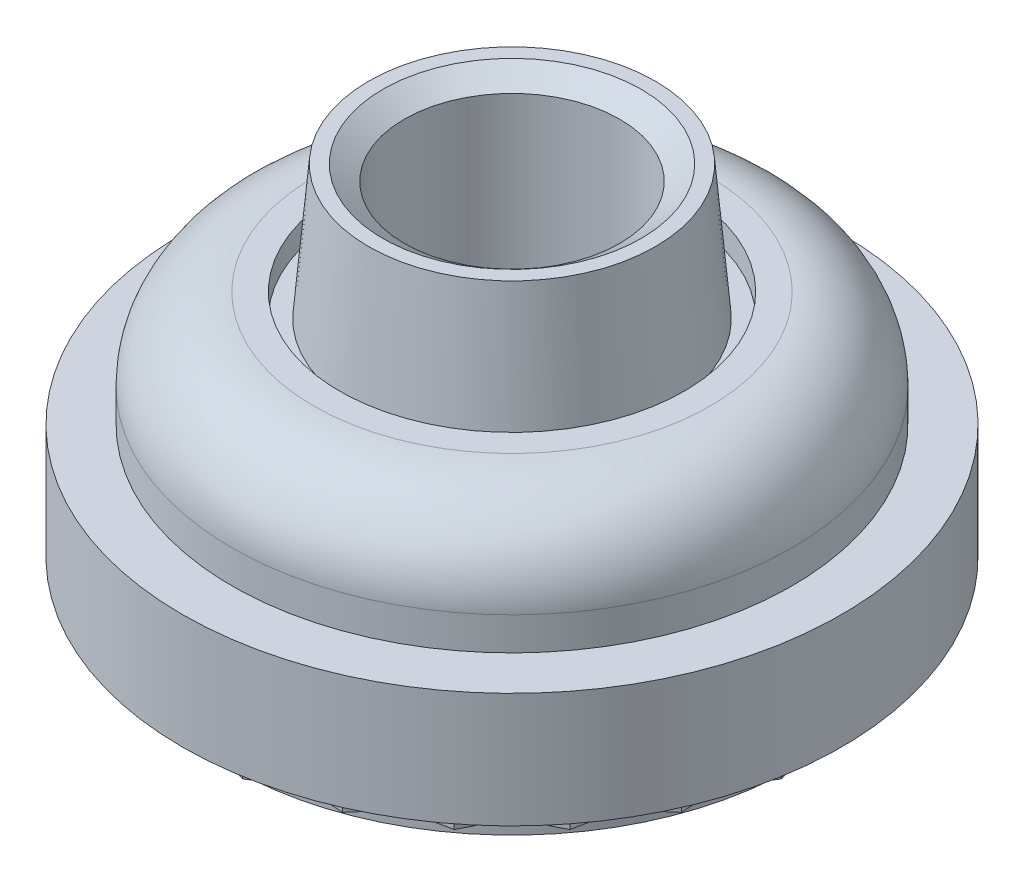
ISO-10303-21;
HEADER;
FILE_DESCRIPTION(('STEP AP214'),'2;1');
FILE_NAME('part.step','',(''),(''),'','','');
FILE_SCHEMA(('AUTOMOTIVE_DESIGN { 1 0 10303 214 1 1 1 1 }'));
ENDSEC;
DATA;
#1=APPLICATION_CONTEXT('core data for automotive mechanical design processes');
#2=APPLICATION_PROTOCOL_DEFINITION('international standard','automotive_design',2000,#1);
#3=PRODUCT_CONTEXT('',#1,'mechanical');
#4=PRODUCT('Part','Part','',(#3));
#5=PRODUCT_RELATED_PRODUCT_CATEGORY('part','',(#4));
#6=PRODUCT_DEFINITION_FORMATION('','',#4);
#7=PRODUCT_DEFINITION_CONTEXT('part definition',#1,'design');
#8=PRODUCT_DEFINITION('design','',#6,#7);
#9=PRODUCT_DEFINITION_SHAPE('','',#8);
#10=(LENGTH_UNIT() NAMED_UNIT(*) SI_UNIT(.MILLI.,.METRE.));
#11=(NAMED_UNIT(*) PLANE_ANGLE_UNIT() SI_UNIT($,.RADIAN.));
#12=(NAMED_UNIT(*) SI_UNIT($,.STERADIAN.) SOLID_ANGLE_UNIT());
#13=UNCERTAINTY_MEASURE_WITH_UNIT(LENGTH_MEASURE(1.E-05),#10,'distance_accuracy_value','');
#14=(GEOMETRIC_REPRESENTATION_CONTEXT(3) GLOBAL_UNCERTAINTY_ASSIGNED_CONTEXT((#13)) GLOBAL_UNIT_ASSIGNED_CONTEXT((#10,
#11,#12)) REPRESENTATION_CONTEXT('',''));
#15=CARTESIAN_POINT('',(0.,0.,0.));
#16=DIRECTION('',(0.,0.,1.));
#17=DIRECTION('',(1.,0.,0.));
#18=AXIS2_PLACEMENT_3D('',#15,#16,#17);
#19=CARTESIAN_POINT('',(2.5,-0.97,0.));
#20=DIRECTION('',(0.,-1.,0.));
#21=DIRECTION('',(0.,0.,-1.));
#22=AXIS2_PLACEMENT_3D('',#19,#20,#21);
#23=PLANE('',#22);
#24=CARTESIAN_POINT('',(0.,-0.97,0.));
#25=DIRECTION('',(0.,-1.,0.));
#26=DIRECTION('',(0.,0.,-1.));
#27=AXIS2_PLACEMENT_3D('',#24,#25,#26);
#28=CIRCLE('',#27,3.);
#29=CARTESIAN_POINT('',(0.,-0.97,-3.));
#30=VERTEX_POINT('',#29);
#31=EDGE_CURVE('E49',#30,#30,#28,.T.);
#32=ORIENTED_EDGE('',*,*,#31,.F.);
#33=EDGE_LOOP('',(#32));
#34=FACE_BOUND('',#33,.T.);
#35=DIRECTION('',(-1.,0.,0.));
#36=VECTOR('',#35,1.);
#37=CARTESIAN_POINT('',(3.346,-0.97,3.6));
#38=LINE('',#37,#36);
#39=CARTESIAN_POINT('',(3.346,-0.97,3.6));
#40=VERTEX_POINT('',#39);
#41=CARTESIAN_POINT('',(-3.346,-0.97,3.6));
#42=VERTEX_POINT('',#41);
#43=EDGE_CURVE('E762',#40,#42,#38,.T.);
#44=ORIENTED_EDGE('',*,*,#43,.T.);
#45=CARTESIAN_POINT('',(-3.346,-0.97,3.346));
#46=DIRECTION('',(0.,-1.,0.));
#47=DIRECTION('',(0.,0.,1.));
#48=AXIS2_PLACEMENT_3D('',#45,#46,#47);
#49=CIRCLE('',#48,0.254);
#50=CARTESIAN_POINT('',(-3.6,-0.97,3.346));
#51=VERTEX_POINT('',#50);
#52=EDGE_CURVE('E782',#42,#51,#49,.T.);
#53=ORIENTED_EDGE('',*,*,#52,.T.);
#54=DIRECTION('',(0.,0.,-1.));
#55=VECTOR('',#54,1.);
#56=CARTESIAN_POINT('',(-3.6,-0.97,3.346));
#57=LINE('',#56,#55);
#58=CARTESIAN_POINT('',(-3.6,-0.97,-3.346));
#59=VERTEX_POINT('',#58);
#60=EDGE_CURVE('E741',#51,#59,#57,.T.);
#61=ORIENTED_EDGE('',*,*,#60,.T.);
#62=CARTESIAN_POINT('',(-3.346,-0.97,-3.346));
#63=DIRECTION('',(0.,-1.,0.));
#64=DIRECTION('',(0.,0.,-1.));
#65=AXIS2_PLACEMENT_3D('',#62,#63,#64);
#66=CIRCLE('',#65,0.254);
#67=CARTESIAN_POINT('',(-3.346,-0.97,-3.6));
#68=VERTEX_POINT('',#67);
#69=EDGE_CURVE('E69',#59,#68,#66,.T.);
#70=ORIENTED_EDGE('',*,*,#69,.T.);
#71=DIRECTION('',(1.,0.,0.));
#72=VECTOR('',#71,1.);
#73=CARTESIAN_POINT('',(-3.346,-0.97,-3.6));
#74=LINE('',#73,#72);
#75=CARTESIAN_POINT('',(3.346,-0.97,-3.6));
#76=VERTEX_POINT('',#75);
#77=EDGE_CURVE('E786',#68,#76,#74,.T.);
#78=ORIENTED_EDGE('',*,*,#77,.T.);
#79=CARTESIAN_POINT('',(3.346,-0.97,-3.346));
#80=DIRECTION('',(0.,-1.,0.));
#81=DIRECTION('',(0.,0.,-1.));
#82=AXIS2_PLACEMENT_3D('',#79,#80,#81);
#83=CIRCLE('',#82,0.254);
#84=CARTESIAN_POINT('',(3.6,-0.97,-3.346));
#85=VERTEX_POINT('',#84);
#86=EDGE_CURVE('E789',#76,#85,#83,.T.);
#87=ORIENTED_EDGE('',*,*,#86,.T.);
#88=DIRECTION('',(0.,0.,1.));
#89=VECTOR('',#88,1.);
#90=CARTESIAN_POINT('',(3.6,-0.97,-3.346));
#91=LINE('',#90,#89);
#92=CARTESIAN_POINT('',(3.6,-0.97,3.346));
#93=VERTEX_POINT('',#92);
#94=EDGE_CURVE('E792',#85,#93,#91,.T.);
#95=ORIENTED_EDGE('',*,*,#94,.T.);
#96=CARTESIAN_POINT('',(3.346,-0.97,3.346));
#97=DIRECTION('',(0.,-1.,0.));
#98=DIRECTION('',(0.,0.,-1.));
#99=AXIS2_PLACEMENT_3D('',#96,#97,#98);
#100=CIRCLE('',#99,0.254);
#101=EDGE_CURVE('E765',#93,#40,#100,.T.);
#102=ORIENTED_EDGE('',*,*,#101,.T.);
#103=EDGE_LOOP('',(#44,#53,#61,#70,#78,#87,#95,#102));
#104=FACE_BOUND('',#103,.T.);
#105=ADVANCED_FACE('F45',(#34,#104),#23,.T.);
#106=CARTESIAN_POINT('',(6.31598809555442,0.,0.));
#107=DIRECTION('',(0.,-1.,0.));
#108=DIRECTION('',(0.,0.,-1.));
#109=AXIS2_PLACEMENT_3D('',#106,#107,#108);
#110=PLANE('',#109);
#111=CARTESIAN_POINT('',(0.,0.,0.));
#112=DIRECTION('',(0.,-1.,0.));
#113=DIRECTION('',(0.,0.,-1.));
#114=AXIS2_PLACEMENT_3D('',#111,#112,#113);
#115=CIRCLE('',#114,7.65);
#116=CARTESIAN_POINT('',(0.,0.,-7.65));
#117=VERTEX_POINT('',#116);
#118=EDGE_CURVE('E1580',#117,#117,#115,.T.);
#119=ORIENTED_EDGE('',*,*,#118,.T.);
#120=EDGE_LOOP('',(#119));
#121=FACE_BOUND('',#120,.T.);
#122=DIRECTION('',(-0.947439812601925,0.,-0.319934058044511));
#123=VECTOR('',#122,1.);
#124=CARTESIAN_POINT('',(0.948599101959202,0.,7.20532553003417));
#125=LINE('',#124,#123);
#126=CARTESIAN_POINT('',(0.948599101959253,0.,7.20532553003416));
#127=VERTEX_POINT('',#126);
#128=CARTESIAN_POINT('',(0.,0.,6.885));
#129=VERTEX_POINT('',#128);
#130=EDGE_CURVE('E1532',#127,#129,#125,.T.);
#131=ORIENTED_EDGE('',*,*,#130,.F.);
#132=DIRECTION('',(-0.83235155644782,0.,0.554248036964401));
#133=VECTOR('',#132,1.);
#134=CARTESIAN_POINT('',(1.78196912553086,0.,6.65039931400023));
#135=LINE('',#134,#133);
#136=CARTESIAN_POINT('',(1.78196912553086,0.,6.65039931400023));
#137=VERTEX_POINT('',#136);
#138=EDGE_CURVE('E1517',#137,#127,#135,.T.);
#139=ORIENTED_EDGE('',*,*,#138,.F.);
#140=DIRECTION('',(-0.99796161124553,0.,-0.063817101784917));
#141=VECTOR('',#140,1.);
#142=CARTESIAN_POINT('',(2.78115184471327,0.,6.71429450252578));
#143=LINE('',#142,#141);
#144=CARTESIAN_POINT('',(2.78115184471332,0.,6.71429450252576));
#145=VERTEX_POINT('',#144);
#146=EDGE_CURVE('E1505',#145,#137,#143,.T.);
#147=ORIENTED_EDGE('',*,*,#146,.F.);
#148=DIRECTION('',(-0.660539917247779,0.,0.750790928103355));
#149=VECTOR('',#148,1.);
#150=CARTESIAN_POINT('',(3.44250000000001,0.,5.96258490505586));
#151=LINE('',#150,#149);
#152=CARTESIAN_POINT('',(3.44250000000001,0.,5.96258490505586));
#153=VERTEX_POINT('',#152);
#154=EDGE_CURVE('E1489',#153,#145,#151,.T.);
#155=ORIENTED_EDGE('',*,*,#154,.F.);
#156=DIRECTION('',(-0.980473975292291,0.,0.196648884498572));
#157=VECTOR('',#156,1.);
#158=CARTESIAN_POINT('',(4.42417368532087,0.,5.76569540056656));
#159=LINE('',#158,#157);
#160=CARTESIAN_POINT('',(4.42417368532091,0.,5.76569540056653));
#161=VERTEX_POINT('',#160);
#162=EDGE_CURVE('E1476',#161,#153,#159,.T.);
#163=ORIENTED_EDGE('',*,*,#162,.F.);
#164=DIRECTION('',(-0.443713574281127,0.,0.896168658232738));
#165=VECTOR('',#164,1.);
#166=CARTESIAN_POINT('',(4.86843018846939,0.,4.86843018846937));
#167=LINE('',#166,#165);
#168=CARTESIAN_POINT('',(4.86843018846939,0.,4.86843018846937));
#169=VERTEX_POINT('',#168);
#170=EDGE_CURVE('E1460',#169,#161,#167,.T.);
#171=ORIENTED_EDGE('',*,*,#170,.F.);
#172=DIRECTION('',(-0.896168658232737,0.,0.44371357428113));
#173=VECTOR('',#172,1.);
#174=CARTESIAN_POINT('',(5.76569540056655,0.,4.42417368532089));
#175=LINE('',#174,#173);
#176=CARTESIAN_POINT('',(5.76569540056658,0.,4.42417368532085));
#177=VERTEX_POINT('',#176);
#178=EDGE_CURVE('E1447',#177,#169,#175,.T.);
#179=ORIENTED_EDGE('',*,*,#178,.F.);
#180=DIRECTION('',(-0.196648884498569,0.,0.980473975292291));
#181=VECTOR('',#180,1.);
#182=CARTESIAN_POINT('',(5.96258490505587,0.,3.44249999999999));
#183=LINE('',#182,#181);
#184=CARTESIAN_POINT('',(5.96258490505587,0.,3.44249999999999));
#185=VERTEX_POINT('',#184);
#186=EDGE_CURVE('E1431',#185,#177,#183,.T.);
#187=ORIENTED_EDGE('',*,*,#186,.F.);
#188=DIRECTION('',(-0.750790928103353,0.,0.660539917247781));
#189=VECTOR('',#188,1.);
#190=CARTESIAN_POINT('',(6.71429450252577,0.,2.7811518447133));
#191=LINE('',#190,#189);
#192=CARTESIAN_POINT('',(6.71429450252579,0.,2.78115184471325));
#193=VERTEX_POINT('',#192);
#194=EDGE_CURVE('E1418',#193,#185,#191,.T.);
#195=ORIENTED_EDGE('',*,*,#194,.F.);
#196=DIRECTION('',(0.0638171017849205,0.,0.997961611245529));
#197=VECTOR('',#196,1.);
#198=CARTESIAN_POINT('',(6.65039931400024,0.,1.78196912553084));
#199=LINE('',#198,#197);
#200=CARTESIAN_POINT('',(6.65039931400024,0.,1.78196912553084));
#201=VERTEX_POINT('',#200);
#202=EDGE_CURVE('E1402',#201,#193,#199,.T.);
#203=ORIENTED_EDGE('',*,*,#202,.F.);
#204=DIRECTION('',(-0.554248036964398,0.,0.832351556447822));
#205=VECTOR('',#204,1.);
#206=CARTESIAN_POINT('',(7.20532553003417,0.,0.948599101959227));
#207=LINE('',#206,#205);
#208=CARTESIAN_POINT('',(7.20532553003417,0.,0.948599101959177));
#209=VERTEX_POINT('',#208);
#210=EDGE_CURVE('E1389',#209,#201,#207,.T.);
#211=ORIENTED_EDGE('',*,*,#210,.F.);
#212=DIRECTION('',(0.319934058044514,0.,0.947439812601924));
#213=VECTOR('',#212,1.);
#214=CARTESIAN_POINT('',(6.885,0.,0.));
#215=LINE('',#214,#213);
#216=CARTESIAN_POINT('',(6.885,0.,0.));
#217=VERTEX_POINT('',#216);
#218=EDGE_CURVE('E1373',#217,#209,#215,.T.);
#219=ORIENTED_EDGE('',*,*,#218,.F.);
#220=DIRECTION('',(-0.319934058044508,0.,0.947439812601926));
#221=VECTOR('',#220,1.);
#222=CARTESIAN_POINT('',(7.20532553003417,0.,-0.948599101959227));
#223=LINE('',#222,#221);
#224=CARTESIAN_POINT('',(7.20532553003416,0.,-0.948599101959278));
#225=VERTEX_POINT('',#224);
#226=EDGE_CURVE('E1360',#225,#217,#223,.T.);
#227=ORIENTED_EDGE('',*,*,#226,.F.);
#228=DIRECTION('',(0.554248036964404,0.,0.832351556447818));
#229=VECTOR('',#228,1.);
#230=CARTESIAN_POINT('',(6.65039931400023,0.,-1.78196912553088));
#231=LINE('',#230,#229);
#232=CARTESIAN_POINT('',(6.65039931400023,0.,-1.78196912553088));
#233=VERTEX_POINT('',#232);
#234=EDGE_CURVE('E1344',#233,#225,#231,.T.);
#235=ORIENTED_EDGE('',*,*,#234,.F.);
#236=DIRECTION('',(-0.0638171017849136,0.,0.99796161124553));
#237=VECTOR('',#236,1.);
#238=CARTESIAN_POINT('',(6.71429450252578,0.,-2.7811518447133));
#239=LINE('',#238,#237);
#240=CARTESIAN_POINT('',(6.71429450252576,0.,-2.78115184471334));
#241=VERTEX_POINT('',#240);
#242=EDGE_CURVE('E1331',#241,#233,#239,.T.);
#243=ORIENTED_EDGE('',*,*,#242,.F.);
#244=DIRECTION('',(0.750790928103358,0.,0.660539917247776));
#245=VECTOR('',#244,1.);
#246=CARTESIAN_POINT('',(5.96258490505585,0.,-3.44250000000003));
#247=LINE('',#246,#245);
#248=CARTESIAN_POINT('',(5.96258490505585,0.,-3.44250000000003));
#249=VERTEX_POINT('',#248);
#250=EDGE_CURVE('E1315',#249,#241,#247,.T.);
#251=ORIENTED_EDGE('',*,*,#250,.F.);
#252=DIRECTION('',(0.196648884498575,0.,0.98047397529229));
#253=VECTOR('',#252,1.);
#254=CARTESIAN_POINT('',(5.76569540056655,0.,-4.42417368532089));
#255=LINE('',#254,#253);
#256=CARTESIAN_POINT('',(5.76569540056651,0.,-4.42417368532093));
#257=VERTEX_POINT('',#256);
#258=EDGE_CURVE('E1302',#257,#249,#255,.T.);
#259=ORIENTED_EDGE('',*,*,#258,.F.);
#260=DIRECTION('',(0.89616865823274,0.,0.443713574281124));
#261=VECTOR('',#260,1.);
#262=CARTESIAN_POINT('',(4.86843018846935,0.,-4.86843018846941));
#263=LINE('',#262,#261);
#264=CARTESIAN_POINT('',(4.86843018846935,0.,-4.86843018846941));
#265=VERTEX_POINT('',#264);
#266=EDGE_CURVE('E1286',#265,#257,#263,.T.);
#267=ORIENTED_EDGE('',*,*,#266,.F.);
#268=DIRECTION('',(0.443713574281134,0.,0.896168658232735));
#269=VECTOR('',#268,1.);
#270=CARTESIAN_POINT('',(4.42417368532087,0.,-5.76569540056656));
#271=LINE('',#270,#269);
#272=CARTESIAN_POINT('',(4.42417368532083,0.,-5.76569540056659));
#273=VERTEX_POINT('',#272);
#274=EDGE_CURVE('E1273',#273,#265,#271,.T.);
#275=ORIENTED_EDGE('',*,*,#274,.F.);
#276=DIRECTION('',(0.980473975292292,0.,0.196648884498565));
#277=VECTOR('',#276,1.);
#278=CARTESIAN_POINT('',(3.44249999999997,0.,-5.96258490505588));
#279=LINE('',#278,#277);
#280=CARTESIAN_POINT('',(3.44249999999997,0.,-5.96258490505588));
#281=VERTEX_POINT('',#280);
#282=EDGE_CURVE('E1257',#281,#273,#279,.T.);
#283=ORIENTED_EDGE('',*,*,#282,.F.);
#284=DIRECTION('',(0.660539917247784,0.,0.750790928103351));
#285=VECTOR('',#284,1.);
#286=CARTESIAN_POINT('',(2.78115184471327,0.,-6.71429450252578));
#287=LINE('',#286,#285);
#288=CARTESIAN_POINT('',(2.78115184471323,0.,-6.7142945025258));
#289=VERTEX_POINT('',#288);
#290=EDGE_CURVE('E1244',#289,#281,#287,.T.);
#291=ORIENTED_EDGE('',*,*,#290,.F.);
#292=DIRECTION('',(0.997961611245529,0.,-0.063817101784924));
#293=VECTOR('',#292,1.);
#294=CARTESIAN_POINT('',(1.78196912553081,0.,-6.65039931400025));
#295=LINE('',#294,#293);
#296=CARTESIAN_POINT('',(1.78196912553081,0.,-6.65039931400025));
#297=VERTEX_POINT('',#296);
#298=EDGE_CURVE('E1228',#297,#289,#295,.T.);
#299=ORIENTED_EDGE('',*,*,#298,.F.);
#300=DIRECTION('',(0.832351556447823,0.,0.554248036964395));
#301=VECTOR('',#300,1.);
#302=CARTESIAN_POINT('',(0.948599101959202,0.,-7.20532553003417));
#303=LINE('',#302,#301);
#304=CARTESIAN_POINT('',(0.948599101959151,0.,-7.20532553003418));
#305=VERTEX_POINT('',#304);
#306=EDGE_CURVE('E1215',#305,#297,#303,.T.);
#307=ORIENTED_EDGE('',*,*,#306,.F.);
#308=DIRECTION('',(0.947439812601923,0.,-0.319934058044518));
#309=VECTOR('',#308,1.);
#310=CARTESIAN_POINT('',(0.,0.,-6.885));
#311=LINE('',#310,#309);
#312=CARTESIAN_POINT('',(0.,0.,-6.885));
#313=VERTEX_POINT('',#312);
#314=EDGE_CURVE('E1199',#313,#305,#311,.T.);
#315=ORIENTED_EDGE('',*,*,#314,.F.);
#316=DIRECTION('',(0.947439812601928,0.,0.319934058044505));
#317=VECTOR('',#316,1.);
#318=CARTESIAN_POINT('',(-0.948599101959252,0.,-7.20532553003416));
#319=LINE('',#318,#317);
#320=CARTESIAN_POINT('',(-0.948599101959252,0.,-7.20532553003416));
#321=VERTEX_POINT('',#320);
#322=EDGE_CURVE('E1186',#321,#313,#319,.T.);
#323=ORIENTED_EDGE('',*,*,#322,.F.);
#324=DIRECTION('',(0.832351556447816,0.,-0.554248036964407));
#325=VECTOR('',#324,1.);
#326=CARTESIAN_POINT('',(-1.78196912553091,0.,-6.65039931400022));
#327=LINE('',#326,#325);
#328=CARTESIAN_POINT('',(-1.78196912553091,0.,-6.65039931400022));
#329=VERTEX_POINT('',#328);
#330=EDGE_CURVE('E1170',#329,#321,#327,.T.);
#331=ORIENTED_EDGE('',*,*,#330,.F.);
#332=DIRECTION('',(0.99796161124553,0.,0.06381710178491));
#333=VECTOR('',#332,1.);
#334=CARTESIAN_POINT('',(-2.78115184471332,0.,-6.71429450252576));
#335=LINE('',#334,#333);
#336=CARTESIAN_POINT('',(-2.78115184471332,0.,-6.71429450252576));
#337=VERTEX_POINT('',#336);
#338=EDGE_CURVE('E1157',#337,#329,#335,.T.);
#339=ORIENTED_EDGE('',*,*,#338,.F.);
#340=DIRECTION('',(0.660539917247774,0.,-0.75079092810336));
#341=VECTOR('',#340,1.);
#342=CARTESIAN_POINT('',(-3.44250000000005,0.,-5.96258490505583));
#343=LINE('',#342,#341);
#344=CARTESIAN_POINT('',(-3.44250000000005,0.,-5.96258490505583));
#345=VERTEX_POINT('',#344);
#346=EDGE_CURVE('E1141',#345,#337,#343,.T.);
#347=ORIENTED_EDGE('',*,*,#346,.F.);
#348=DIRECTION('',(0.980473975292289,0.,-0.196648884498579));
#349=VECTOR('',#348,1.);
#350=CARTESIAN_POINT('',(-4.42417368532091,0.,-5.76569540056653));
#351=LINE('',#350,#349);
#352=CARTESIAN_POINT('',(-4.42417368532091,0.,-5.76569540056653));
#353=VERTEX_POINT('',#352);
#354=EDGE_CURVE('E1128',#353,#345,#351,.T.);
#355=ORIENTED_EDGE('',*,*,#354,.F.);
#356=DIRECTION('',(0.443713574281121,0.,-0.896168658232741));
#357=VECTOR('',#356,1.);
#358=CARTESIAN_POINT('',(-4.86843018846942,0.,-4.86843018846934));
#359=LINE('',#358,#357);
#360=CARTESIAN_POINT('',(-4.86843018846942,0.,-4.86843018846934));
#361=VERTEX_POINT('',#360);
#362=EDGE_CURVE('E1112',#361,#353,#359,.T.);
#363=ORIENTED_EDGE('',*,*,#362,.F.);
#364=DIRECTION('',(0.896168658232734,0.,-0.443713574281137));
#365=VECTOR('',#364,1.);
#366=CARTESIAN_POINT('',(-5.76569540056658,0.,-4.42417368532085));
#367=LINE('',#366,#365);
#368=CARTESIAN_POINT('',(-5.76569540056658,0.,-4.42417368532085));
#369=VERTEX_POINT('',#368);
#370=EDGE_CURVE('E1099',#369,#361,#367,.T.);
#371=ORIENTED_EDGE('',*,*,#370,.F.);
#372=DIRECTION('',(0.196648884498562,0.,-0.980473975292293));
#373=VECTOR('',#372,1.);
#374=CARTESIAN_POINT('',(-5.96258490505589,0.,-3.44249999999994));
#375=LINE('',#374,#373);
#376=CARTESIAN_POINT('',(-5.96258490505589,0.,-3.44249999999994));
#377=VERTEX_POINT('',#376);
#378=EDGE_CURVE('E1083',#377,#369,#375,.T.);
#379=ORIENTED_EDGE('',*,*,#378,.F.);
#380=DIRECTION('',(0.750790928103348,0.,-0.660539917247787));
#381=VECTOR('',#380,1.);
#382=CARTESIAN_POINT('',(-6.71429450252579,0.,-2.78115184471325));
#383=LINE('',#382,#381);
#384=CARTESIAN_POINT('',(-6.71429450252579,0.,-2.78115184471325));
#385=VERTEX_POINT('',#384);
#386=EDGE_CURVE('E1070',#385,#377,#383,.T.);
#387=ORIENTED_EDGE('',*,*,#386,.F.);
#388=DIRECTION('',(-0.0638171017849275,0.,-0.997961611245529));
#389=VECTOR('',#388,1.);
#390=CARTESIAN_POINT('',(-6.65039931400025,0.,-1.78196912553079));
#391=LINE('',#390,#389);
#392=CARTESIAN_POINT('',(-6.65039931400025,0.,-1.78196912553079));
#393=VERTEX_POINT('',#392);
#394=EDGE_CURVE('E1054',#393,#385,#391,.T.);
#395=ORIENTED_EDGE('',*,*,#394,.F.);
#396=DIRECTION('',(0.554248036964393,0.,-0.832351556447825));
#397=VECTOR('',#396,1.);
#398=CARTESIAN_POINT('',(-7.20532553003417,0.,-0.948599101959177));
#399=LINE('',#398,#397);
#400=CARTESIAN_POINT('',(-7.20532553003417,0.,-0.948599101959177));
#401=VERTEX_POINT('',#400);
#402=EDGE_CURVE('E1041',#401,#393,#399,.T.);
#403=ORIENTED_EDGE('',*,*,#402,.F.);
#404=DIRECTION('',(-0.319934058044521,0.,-0.947439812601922));
#405=VECTOR('',#404,1.);
#406=CARTESIAN_POINT('',(-6.885,0.,0.));
#407=LINE('',#406,#405);
#408=CARTESIAN_POINT('',(-6.885,0.,0.));
#409=VERTEX_POINT('',#408);
#410=EDGE_CURVE('E1025',#409,#401,#407,.T.);
#411=ORIENTED_EDGE('',*,*,#410,.F.);
#412=DIRECTION('',(0.319934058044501,0.,-0.947439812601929));
#413=VECTOR('',#412,1.);
#414=CARTESIAN_POINT('',(-7.20532553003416,0.,0.948599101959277));
#415=LINE('',#414,#413);
#416=CARTESIAN_POINT('',(-7.20532553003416,0.,0.948599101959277));
#417=VERTEX_POINT('',#416);
#418=EDGE_CURVE('E1012',#417,#409,#415,.T.);
#419=ORIENTED_EDGE('',*,*,#418,.F.);
#420=DIRECTION('',(-0.55424803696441,0.,-0.832351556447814));
#421=VECTOR('',#420,1.);
#422=CARTESIAN_POINT('',(-6.65039931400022,0.,1.78196912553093));
#423=LINE('',#422,#421);
#424=CARTESIAN_POINT('',(-6.65039931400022,0.,1.78196912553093));
#425=VERTEX_POINT('',#424);
#426=EDGE_CURVE('E996',#425,#417,#423,.T.);
#427=ORIENTED_EDGE('',*,*,#426,.F.);
#428=DIRECTION('',(0.0638171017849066,0.,-0.99796161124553));
#429=VECTOR('',#428,1.);
#430=CARTESIAN_POINT('',(-6.71429450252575,0.,2.78115184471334));
#431=LINE('',#430,#429);
#432=CARTESIAN_POINT('',(-6.71429450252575,0.,2.78115184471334));
#433=VERTEX_POINT('',#432);
#434=EDGE_CURVE('E983',#433,#425,#431,.T.);
#435=ORIENTED_EDGE('',*,*,#434,.F.);
#436=DIRECTION('',(-0.750790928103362,0.,-0.660539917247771));
#437=VECTOR('',#436,1.);
#438=CARTESIAN_POINT('',(-5.96258490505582,0.,3.44250000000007));
#439=LINE('',#438,#437);
#440=CARTESIAN_POINT('',(-5.96258490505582,0.,3.44250000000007));
#441=VERTEX_POINT('',#440);
#442=EDGE_CURVE('E967',#441,#433,#439,.T.);
#443=ORIENTED_EDGE('',*,*,#442,.F.);
#444=DIRECTION('',(-0.196648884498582,0.,-0.980473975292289));
#445=VECTOR('',#444,1.);
#446=CARTESIAN_POINT('',(-5.76569540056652,0.,4.42417368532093));
#447=LINE('',#446,#445);
#448=CARTESIAN_POINT('',(-5.76569540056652,0.,4.42417368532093));
#449=VERTEX_POINT('',#448);
#450=EDGE_CURVE('E954',#449,#441,#447,.T.);
#451=ORIENTED_EDGE('',*,*,#450,.F.);
#452=DIRECTION('',(-0.896168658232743,0.,-0.443713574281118));
#453=VECTOR('',#452,1.);
#454=CARTESIAN_POINT('',(-4.86843018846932,0.,4.86843018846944));
#455=LINE('',#454,#453);
#456=CARTESIAN_POINT('',(-4.86843018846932,0.,4.86843018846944));
#457=VERTEX_POINT('',#456);
#458=EDGE_CURVE('E938',#457,#449,#455,.T.);
#459=ORIENTED_EDGE('',*,*,#458,.F.);
#460=DIRECTION('',(-0.44371357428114,0.,-0.896168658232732));
#461=VECTOR('',#460,1.);
#462=CARTESIAN_POINT('',(-4.42417368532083,0.,5.76569540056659));
#463=LINE('',#462,#461);
#464=CARTESIAN_POINT('',(-4.42417368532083,0.,5.76569540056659));
#465=VERTEX_POINT('',#464);
#466=EDGE_CURVE('E925',#465,#457,#463,.T.);
#467=ORIENTED_EDGE('',*,*,#466,.F.);
#468=DIRECTION('',(-0.980473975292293,0.,-0.196648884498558));
#469=VECTOR('',#468,1.);
#470=CARTESIAN_POINT('',(-3.44249999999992,0.,5.9625849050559));
#471=LINE('',#470,#469);
#472=CARTESIAN_POINT('',(-3.44249999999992,0.,5.9625849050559));
#473=VERTEX_POINT('',#472);
#474=EDGE_CURVE('E909',#473,#465,#471,.T.);
#475=ORIENTED_EDGE('',*,*,#474,.F.);
#476=DIRECTION('',(-0.660539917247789,0.,-0.750790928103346));
#477=VECTOR('',#476,1.);
#478=CARTESIAN_POINT('',(-2.78115184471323,0.,6.7142945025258));
#479=LINE('',#478,#477);
#480=CARTESIAN_POINT('',(-2.78115184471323,0.,6.7142945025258));
#481=VERTEX_POINT('',#480);
#482=EDGE_CURVE('E896',#481,#473,#479,.T.);
#483=ORIENTED_EDGE('',*,*,#482,.F.);
#484=DIRECTION('',(-0.997961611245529,0.,0.063817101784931));
#485=VECTOR('',#484,1.);
#486=CARTESIAN_POINT('',(-1.78196912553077,0.,6.65039931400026));
#487=LINE('',#486,#485);
#488=CARTESIAN_POINT('',(-1.78196912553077,0.,6.65039931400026));
#489=VERTEX_POINT('',#488);
#490=EDGE_CURVE('E885',#489,#481,#487,.T.);
#491=ORIENTED_EDGE('',*,*,#490,.F.);
#492=DIRECTION('',(-0.832351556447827,0.,-0.55424803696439));
#493=VECTOR('',#492,1.);
#494=CARTESIAN_POINT('',(-0.948599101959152,0.,7.20532553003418));
#495=LINE('',#494,#493);
#496=CARTESIAN_POINT('',(-0.948599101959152,0.,7.20532553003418));
#497=VERTEX_POINT('',#496);
#498=EDGE_CURVE('E858',#497,#489,#495,.T.);
#499=ORIENTED_EDGE('',*,*,#498,.F.);
#500=DIRECTION('',(-0.947439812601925,0.,0.319934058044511));
#501=VECTOR('',#500,1.);
#502=CARTESIAN_POINT('',(0.,0.,6.885));
#503=LINE('',#502,#501);
#504=EDGE_CURVE('E1546',#129,#497,#503,.T.);
#505=ORIENTED_EDGE('',*,*,#504,.F.);
#506=EDGE_LOOP('',(#131,#139,#147,#155,#163,#171,#179,#187,#195,#203,#211,#219,#227,#235,#243,
#251,#259,#267,#275,#283,#291,#299,#307,#315,#323,#331,#339,#347,#355,#363,#371,#379,#387,#395,
#403,#411,#419,#427,#435,#443,#451,#459,#467,#475,#483,#491,#499,#505));
#507=FACE_BOUND('',#506,.T.);
#508=ADVANCED_FACE('F1632',(#121,#507),#110,.T.);
#509=CARTESIAN_POINT('',(0.,0.,0.));
#510=DIRECTION('',(0.,-1.,0.));
#511=DIRECTION('',(0.,0.,-1.));
#512=AXIS2_PLACEMENT_3D('',#509,#510,#511);
#513=CIRCLE('',#512,6.31598809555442);
#514=CARTESIAN_POINT('',(0.,0.,-6.31598809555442));
#515=VERTEX_POINT('',#514);
#516=EDGE_CURVE('E1583',#515,#515,#513,.T.);
#517=ORIENTED_EDGE('',*,*,#516,.F.);
#518=EDGE_LOOP('',(#517));
#519=FACE_BOUND('',#518,.T.);
#520=DIRECTION('',(0.99796161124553,0.,0.0638171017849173));
#521=VECTOR('',#520,1.);
#522=CARTESIAN_POINT('',(1.72851005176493,0.,6.45088733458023));
#523=LINE('',#522,#521);
#524=CARTESIAN_POINT('',(1.72851005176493,0.,6.45088733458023));
#525=VERTEX_POINT('',#524);
#526=CARTESIAN_POINT('',(2.69771728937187,0.,6.51286566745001));
#527=VERTEX_POINT('',#526);
#528=EDGE_CURVE('E1509',#525,#527,#523,.T.);
#529=ORIENTED_EDGE('',*,*,#528,.F.);
#530=DIRECTION('',(0.832351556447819,0.,-0.554248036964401));
#531=VECTOR('',#530,1.);
#532=CARTESIAN_POINT('',(0.920141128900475,0.,6.98916576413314));
#533=LINE('',#532,#531);
#534=CARTESIAN_POINT('',(0.920141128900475,0.,6.98916576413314));
#535=VERTEX_POINT('',#534);
#536=EDGE_CURVE('E1519',#535,#525,#533,.T.);
#537=ORIENTED_EDGE('',*,*,#536,.F.);
#538=DIRECTION('',(0.947439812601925,0.,0.319934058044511));
#539=VECTOR('',#538,1.);
#540=CARTESIAN_POINT('',(0.,0.,6.67845));
#541=LINE('',#540,#539);
#542=CARTESIAN_POINT('',(0.,0.,6.67845));
#543=VERTEX_POINT('',#542);
#544=EDGE_CURVE('E1536',#543,#535,#541,.T.);
#545=ORIENTED_EDGE('',*,*,#544,.F.);
#546=DIRECTION('',(0.947439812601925,0.,-0.319934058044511));
#547=VECTOR('',#546,1.);
#548=CARTESIAN_POINT('',(-0.920141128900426,0.,6.98916576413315));
#549=LINE('',#548,#547);
#550=CARTESIAN_POINT('',(-0.920141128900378,0.,6.98916576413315));
#551=VERTEX_POINT('',#550);
#552=EDGE_CURVE('E1549',#551,#543,#549,.T.);
#553=ORIENTED_EDGE('',*,*,#552,.F.);
#554=DIRECTION('',(0.832351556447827,0.,0.55424803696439));
#555=VECTOR('',#554,1.);
#556=CARTESIAN_POINT('',(-1.72851005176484,0.,6.45088733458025));
#557=LINE('',#556,#555);
#558=CARTESIAN_POINT('',(-1.72851005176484,0.,6.45088733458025));
#559=VERTEX_POINT('',#558);
#560=EDGE_CURVE('E875',#559,#551,#557,.T.);
#561=ORIENTED_EDGE('',*,*,#560,.F.);
#562=DIRECTION('',(0.997961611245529,0.,-0.0638171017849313));
#563=VECTOR('',#562,1.);
#564=CARTESIAN_POINT('',(-2.69771728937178,0.,6.51286566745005));
#565=LINE('',#564,#563);
#566=CARTESIAN_POINT('',(-2.69771728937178,0.,6.51286566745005));
#567=VERTEX_POINT('',#566);
#568=EDGE_CURVE('E888',#567,#559,#565,.T.);
#569=ORIENTED_EDGE('',*,*,#568,.F.);
#570=DIRECTION('',(0.660539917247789,0.,0.750790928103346));
#571=VECTOR('',#570,1.);
#572=CARTESIAN_POINT('',(-3.33922499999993,0.,5.78370735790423));
#573=LINE('',#572,#571);
#574=CARTESIAN_POINT('',(-3.33922499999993,0.,5.78370735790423));
#575=VERTEX_POINT('',#574);
#576=EDGE_CURVE('E900',#575,#567,#573,.T.);
#577=ORIENTED_EDGE('',*,*,#576,.F.);
#578=DIRECTION('',(0.980473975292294,0.,0.196648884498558));
#579=VECTOR('',#578,1.);
#580=CARTESIAN_POINT('',(-4.29144847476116,0.,5.59272453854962));
#581=LINE('',#580,#579);
#582=CARTESIAN_POINT('',(-4.29144847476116,0.,5.59272453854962));
#583=VERTEX_POINT('',#582);
#584=EDGE_CURVE('E912',#583,#575,#581,.T.);
#585=ORIENTED_EDGE('',*,*,#584,.F.);
#586=DIRECTION('',(0.44371357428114,0.,0.896168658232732));
#587=VECTOR('',#586,1.);
#588=CARTESIAN_POINT('',(-4.72237728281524,0.,4.72237728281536));
#589=LINE('',#588,#587);
#590=CARTESIAN_POINT('',(-4.72237728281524,0.,4.72237728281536));
#591=VERTEX_POINT('',#590);
#592=EDGE_CURVE('E929',#591,#583,#589,.T.);
#593=ORIENTED_EDGE('',*,*,#592,.F.);
#594=DIRECTION('',(0.896168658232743,0.,0.443713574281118));
#595=VECTOR('',#594,1.);
#596=CARTESIAN_POINT('',(-5.59272453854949,0.,4.29144847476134));
#597=LINE('',#596,#595);
#598=CARTESIAN_POINT('',(-5.59272453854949,0.,4.29144847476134));
#599=VERTEX_POINT('',#598);
#600=EDGE_CURVE('E941',#599,#591,#597,.T.);
#601=ORIENTED_EDGE('',*,*,#600,.F.);
#602=DIRECTION('',(0.196648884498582,0.,0.980473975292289));
#603=VECTOR('',#602,1.);
#604=CARTESIAN_POINT('',(-5.78370735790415,0.,3.33922500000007));
#605=LINE('',#604,#603);
#606=CARTESIAN_POINT('',(-5.78370735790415,0.,3.33922500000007));
#607=VERTEX_POINT('',#606);
#608=EDGE_CURVE('E958',#607,#599,#605,.T.);
#609=ORIENTED_EDGE('',*,*,#608,.F.);
#610=DIRECTION('',(0.750790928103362,0.,0.660539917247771));
#611=VECTOR('',#610,1.);
#612=CARTESIAN_POINT('',(-6.51286566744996,0.,2.69771728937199));
#613=LINE('',#612,#611);
#614=CARTESIAN_POINT('',(-6.51286566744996,0.,2.69771728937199));
#615=VERTEX_POINT('',#614);
#616=EDGE_CURVE('E970',#615,#607,#613,.T.);
#617=ORIENTED_EDGE('',*,*,#616,.F.);
#618=DIRECTION('',(-0.0638171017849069,0.,0.99796161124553));
#619=VECTOR('',#618,1.);
#620=CARTESIAN_POINT('',(-6.45088733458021,0.,1.728510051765));
#621=LINE('',#620,#619);
#622=CARTESIAN_POINT('',(-6.45088733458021,0.,1.728510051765));
#623=VERTEX_POINT('',#622);
#624=EDGE_CURVE('E987',#623,#615,#621,.T.);
#625=ORIENTED_EDGE('',*,*,#624,.F.);
#626=DIRECTION('',(0.55424803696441,0.,0.832351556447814));
#627=VECTOR('',#626,1.);
#628=CARTESIAN_POINT('',(-6.98916576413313,0.,0.920141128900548));
#629=LINE('',#628,#627);
#630=CARTESIAN_POINT('',(-6.98916576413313,0.,0.920141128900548));
#631=VERTEX_POINT('',#630);
#632=EDGE_CURVE('E999',#631,#623,#629,.T.);
#633=ORIENTED_EDGE('',*,*,#632,.F.);
#634=DIRECTION('',(-0.319934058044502,0.,0.947439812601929));
#635=VECTOR('',#634,1.);
#636=CARTESIAN_POINT('',(-6.67845,0.,0.));
#637=LINE('',#636,#635);
#638=CARTESIAN_POINT('',(-6.67845,0.,0.));
#639=VERTEX_POINT('',#638);
#640=EDGE_CURVE('E1016',#639,#631,#637,.T.);
#641=ORIENTED_EDGE('',*,*,#640,.F.);
#642=DIRECTION('',(0.319934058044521,0.,0.947439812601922));
#643=VECTOR('',#642,1.);
#644=CARTESIAN_POINT('',(-6.98916576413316,0.,-0.920141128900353));
#645=LINE('',#644,#643);
#646=CARTESIAN_POINT('',(-6.98916576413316,0.,-0.920141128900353));
#647=VERTEX_POINT('',#646);
#648=EDGE_CURVE('E1028',#647,#639,#645,.T.);
#649=ORIENTED_EDGE('',*,*,#648,.F.);
#650=DIRECTION('',(-0.554248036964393,0.,0.832351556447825));
#651=VECTOR('',#650,1.);
#652=CARTESIAN_POINT('',(-6.45088733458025,0.,-1.72851005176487));
#653=LINE('',#652,#651);
#654=CARTESIAN_POINT('',(-6.45088733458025,0.,-1.72851005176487));
#655=VERTEX_POINT('',#654);
#656=EDGE_CURVE('E1045',#655,#647,#653,.T.);
#657=ORIENTED_EDGE('',*,*,#656,.F.);
#658=DIRECTION('',(0.0638171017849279,0.,0.997961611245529));
#659=VECTOR('',#658,1.);
#660=CARTESIAN_POINT('',(-6.51286566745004,0.,-2.69771728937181));
#661=LINE('',#660,#659);
#662=CARTESIAN_POINT('',(-6.51286566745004,0.,-2.69771728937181));
#663=VERTEX_POINT('',#662);
#664=EDGE_CURVE('E1057',#663,#655,#661,.T.);
#665=ORIENTED_EDGE('',*,*,#664,.F.);
#666=DIRECTION('',(-0.750790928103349,0.,0.660539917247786));
#667=VECTOR('',#666,1.);
#668=CARTESIAN_POINT('',(-5.78370735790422,0.,-3.33922499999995));
#669=LINE('',#668,#667);
#670=CARTESIAN_POINT('',(-5.78370735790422,0.,-3.33922499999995));
#671=VERTEX_POINT('',#670);
#672=EDGE_CURVE('E1074',#671,#663,#669,.T.);
#673=ORIENTED_EDGE('',*,*,#672,.F.);
#674=DIRECTION('',(-0.196648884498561,0.,0.980473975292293));
#675=VECTOR('',#674,1.);
#676=CARTESIAN_POINT('',(-5.59272453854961,0.,-4.29144847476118));
#677=LINE('',#676,#675);
#678=CARTESIAN_POINT('',(-5.59272453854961,0.,-4.29144847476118));
#679=VERTEX_POINT('',#678);
#680=EDGE_CURVE('E1086',#679,#671,#677,.T.);
#681=ORIENTED_EDGE('',*,*,#680,.F.);
#682=DIRECTION('',(-0.896168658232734,0.,0.443713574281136));
#683=VECTOR('',#682,1.);
#684=CARTESIAN_POINT('',(-4.72237728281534,0.,-4.72237728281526));
#685=LINE('',#684,#683);
#686=CARTESIAN_POINT('',(-4.72237728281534,0.,-4.72237728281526));
#687=VERTEX_POINT('',#686);
#688=EDGE_CURVE('E1103',#687,#679,#685,.T.);
#689=ORIENTED_EDGE('',*,*,#688,.F.);
#690=DIRECTION('',(-0.443713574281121,0.,0.896168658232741));
#691=VECTOR('',#690,1.);
#692=CARTESIAN_POINT('',(-4.29144847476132,0.,-5.59272453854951));
#693=LINE('',#692,#691);
#694=CARTESIAN_POINT('',(-4.29144847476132,0.,-5.59272453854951));
#695=VERTEX_POINT('',#694);
#696=EDGE_CURVE('E1115',#695,#687,#693,.T.);
#697=ORIENTED_EDGE('',*,*,#696,.F.);
#698=DIRECTION('',(-0.980473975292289,0.,0.196648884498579));
#699=VECTOR('',#698,1.);
#700=CARTESIAN_POINT('',(-3.33922500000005,0.,-5.78370735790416));
#701=LINE('',#700,#699);
#702=CARTESIAN_POINT('',(-3.33922500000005,0.,-5.78370735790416));
#703=VERTEX_POINT('',#702);
#704=EDGE_CURVE('E1132',#703,#695,#701,.T.);
#705=ORIENTED_EDGE('',*,*,#704,.F.);
#706=DIRECTION('',(-0.660539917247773,0.,0.75079092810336));
#707=VECTOR('',#706,1.);
#708=CARTESIAN_POINT('',(-2.69771728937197,0.,-6.51286566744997));
#709=LINE('',#708,#707);
#710=CARTESIAN_POINT('',(-2.69771728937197,0.,-6.51286566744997));
#711=VERTEX_POINT('',#710);
#712=EDGE_CURVE('E1144',#711,#703,#709,.T.);
#713=ORIENTED_EDGE('',*,*,#712,.F.);
#714=DIRECTION('',(-0.99796161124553,0.,-0.0638171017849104));
#715=VECTOR('',#714,1.);
#716=CARTESIAN_POINT('',(-1.72851005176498,0.,-6.45088733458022));
#717=LINE('',#716,#715);
#718=CARTESIAN_POINT('',(-1.72851005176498,0.,-6.45088733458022));
#719=VERTEX_POINT('',#718);
#720=EDGE_CURVE('E1161',#719,#711,#717,.T.);
#721=ORIENTED_EDGE('',*,*,#720,.F.);
#722=DIRECTION('',(-0.832351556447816,0.,0.554248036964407));
#723=VECTOR('',#722,1.);
#724=CARTESIAN_POINT('',(-0.920141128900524,0.,-6.98916576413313));
#725=LINE('',#724,#723);
#726=CARTESIAN_POINT('',(-0.920141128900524,0.,-6.98916576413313));
#727=VERTEX_POINT('',#726);
#728=EDGE_CURVE('E1173',#727,#719,#725,.T.);
#729=ORIENTED_EDGE('',*,*,#728,.F.);
#730=DIRECTION('',(-0.947439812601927,0.,-0.319934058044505));
#731=VECTOR('',#730,1.);
#732=CARTESIAN_POINT('',(0.,0.,-6.67845));
#733=LINE('',#732,#731);
#734=CARTESIAN_POINT('',(0.,0.,-6.67845));
#735=VERTEX_POINT('',#734);
#736=EDGE_CURVE('E1190',#735,#727,#733,.T.);
#737=ORIENTED_EDGE('',*,*,#736,.F.);
#738=DIRECTION('',(-0.947439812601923,0.,0.319934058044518));
#739=VECTOR('',#738,1.);
#740=CARTESIAN_POINT('',(0.920141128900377,0.,-6.98916576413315));
#741=LINE('',#740,#739);
#742=CARTESIAN_POINT('',(0.920141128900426,0.,-6.98916576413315));
#743=VERTEX_POINT('',#742);
#744=EDGE_CURVE('E1202',#743,#735,#741,.T.);
#745=ORIENTED_EDGE('',*,*,#744,.F.);
#746=DIRECTION('',(-0.832351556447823,0.,-0.554248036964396));
#747=VECTOR('',#746,1.);
#748=CARTESIAN_POINT('',(1.72851005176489,0.,-6.45088733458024));
#749=LINE('',#748,#747);
#750=CARTESIAN_POINT('',(1.72851005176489,0.,-6.45088733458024));
#751=VERTEX_POINT('',#750);
#752=EDGE_CURVE('E1219',#751,#743,#749,.T.);
#753=ORIENTED_EDGE('',*,*,#752,.F.);
#754=DIRECTION('',(-0.997961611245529,0.,0.0638171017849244));
#755=VECTOR('',#754,1.);
#756=CARTESIAN_POINT('',(2.69771728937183,0.,-6.51286566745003));
#757=LINE('',#756,#755);
#758=CARTESIAN_POINT('',(2.69771728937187,0.,-6.51286566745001));
#759=VERTEX_POINT('',#758);
#760=EDGE_CURVE('E1231',#759,#751,#757,.T.);
#761=ORIENTED_EDGE('',*,*,#760,.F.);
#762=DIRECTION('',(-0.660539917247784,0.,-0.750790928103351));
#763=VECTOR('',#762,1.);
#764=CARTESIAN_POINT('',(3.33922499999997,0.,-5.7837073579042));
#765=LINE('',#764,#763);
#766=CARTESIAN_POINT('',(3.33922499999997,0.,-5.7837073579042));
#767=VERTEX_POINT('',#766);
#768=EDGE_CURVE('E1248',#767,#759,#765,.T.);
#769=ORIENTED_EDGE('',*,*,#768,.F.);
#770=DIRECTION('',(-0.980473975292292,0.,-0.196648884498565));
#771=VECTOR('',#770,1.);
#772=CARTESIAN_POINT('',(4.2914484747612,0.,-5.59272453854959));
#773=LINE('',#772,#771);
#774=CARTESIAN_POINT('',(4.29144847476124,0.,-5.59272453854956));
#775=VERTEX_POINT('',#774);
#776=EDGE_CURVE('E1260',#775,#767,#773,.T.);
#777=ORIENTED_EDGE('',*,*,#776,.F.);
#778=DIRECTION('',(-0.443713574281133,0.,-0.896168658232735));
#779=VECTOR('',#778,1.);
#780=CARTESIAN_POINT('',(4.72237728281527,0.,-4.72237728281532));
#781=LINE('',#780,#779);
#782=CARTESIAN_POINT('',(4.72237728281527,0.,-4.72237728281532));
#783=VERTEX_POINT('',#782);
#784=EDGE_CURVE('E1277',#783,#775,#781,.T.);
#785=ORIENTED_EDGE('',*,*,#784,.F.);
#786=DIRECTION('',(-0.89616865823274,0.,-0.443713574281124));
#787=VECTOR('',#786,1.);
#788=CARTESIAN_POINT('',(5.59272453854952,0.,-4.2914484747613));
#789=LINE('',#788,#787);
#790=CARTESIAN_POINT('',(5.59272453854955,0.,-4.29144847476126));
#791=VERTEX_POINT('',#790);
#792=EDGE_CURVE('E1289',#791,#783,#789,.T.);
#793=ORIENTED_EDGE('',*,*,#792,.F.);
#794=DIRECTION('',(-0.196648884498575,0.,-0.98047397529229));
#795=VECTOR('',#794,1.);
#796=CARTESIAN_POINT('',(5.78370735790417,0.,-3.33922500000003));
#797=LINE('',#796,#795);
#798=CARTESIAN_POINT('',(5.78370735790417,0.,-3.33922500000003));
#799=VERTEX_POINT('',#798);
#800=EDGE_CURVE('E1306',#799,#791,#797,.T.);
#801=ORIENTED_EDGE('',*,*,#800,.F.);
#802=DIRECTION('',(-0.750790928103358,0.,-0.660539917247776));
#803=VECTOR('',#802,1.);
#804=CARTESIAN_POINT('',(6.51286566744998,0.,-2.69771728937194));
#805=LINE('',#804,#803);
#806=CARTESIAN_POINT('',(6.51286566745,0.,-2.6977172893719));
#807=VERTEX_POINT('',#806);
#808=EDGE_CURVE('E1318',#807,#799,#805,.T.);
#809=ORIENTED_EDGE('',*,*,#808,.F.);
#810=DIRECTION('',(0.063817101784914,0.,-0.99796161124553));
#811=VECTOR('',#810,1.);
#812=CARTESIAN_POINT('',(6.45088733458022,0.,-1.72851005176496));
#813=LINE('',#812,#811);
#814=CARTESIAN_POINT('',(6.45088733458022,0.,-1.72851005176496));
#815=VERTEX_POINT('',#814);
#816=EDGE_CURVE('E1335',#815,#807,#813,.T.);
#817=ORIENTED_EDGE('',*,*,#816,.F.);
#818=DIRECTION('',(-0.554248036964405,0.,-0.832351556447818));
#819=VECTOR('',#818,1.);
#820=CARTESIAN_POINT('',(6.98916576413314,0.,-0.920141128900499));
#821=LINE('',#820,#819);
#822=CARTESIAN_POINT('',(6.98916576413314,0.,-0.92014112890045));
#823=VERTEX_POINT('',#822);
#824=EDGE_CURVE('E1347',#823,#815,#821,.T.);
#825=ORIENTED_EDGE('',*,*,#824,.F.);
#826=DIRECTION('',(0.319934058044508,0.,-0.947439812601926));
#827=VECTOR('',#826,1.);
#828=CARTESIAN_POINT('',(6.67845,0.,0.));
#829=LINE('',#828,#827);
#830=CARTESIAN_POINT('',(6.67845,0.,0.));
#831=VERTEX_POINT('',#830);
#832=EDGE_CURVE('E1364',#831,#823,#829,.T.);
#833=ORIENTED_EDGE('',*,*,#832,.F.);
#834=DIRECTION('',(-0.319934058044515,0.,-0.947439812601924));
#835=VECTOR('',#834,1.);
#836=CARTESIAN_POINT('',(6.98916576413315,0.,0.920141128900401));
#837=LINE('',#836,#835);
#838=CARTESIAN_POINT('',(6.98916576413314,0.,0.920141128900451));
#839=VERTEX_POINT('',#838);
#840=EDGE_CURVE('E1376',#839,#831,#837,.T.);
#841=ORIENTED_EDGE('',*,*,#840,.F.);
#842=DIRECTION('',(0.554248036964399,0.,-0.832351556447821));
#843=VECTOR('',#842,1.);
#844=CARTESIAN_POINT('',(6.45088733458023,0.,1.72851005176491));
#845=LINE('',#844,#843);
#846=CARTESIAN_POINT('',(6.45088733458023,0.,1.72851005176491));
#847=VERTEX_POINT('',#846);
#848=EDGE_CURVE('E1393',#847,#839,#845,.T.);
#849=ORIENTED_EDGE('',*,*,#848,.F.);
#850=DIRECTION('',(-0.0638171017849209,0.,-0.997961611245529));
#851=VECTOR('',#850,1.);
#852=CARTESIAN_POINT('',(6.51286566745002,0.,2.69771728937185));
#853=LINE('',#852,#851);
#854=CARTESIAN_POINT('',(6.51286566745,0.,2.6977172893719));
#855=VERTEX_POINT('',#854);
#856=EDGE_CURVE('E1405',#855,#847,#853,.T.);
#857=ORIENTED_EDGE('',*,*,#856,.F.);
#858=DIRECTION('',(0.750790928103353,0.,-0.660539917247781));
#859=VECTOR('',#858,1.);
#860=CARTESIAN_POINT('',(5.78370735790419,0.,3.33922499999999));
#861=LINE('',#860,#859);
#862=CARTESIAN_POINT('',(5.78370735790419,0.,3.33922499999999));
#863=VERTEX_POINT('',#862);
#864=EDGE_CURVE('E1422',#863,#855,#861,.T.);
#865=ORIENTED_EDGE('',*,*,#864,.F.);
#866=DIRECTION('',(0.196648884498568,0.,-0.980473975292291));
#867=VECTOR('',#866,1.);
#868=CARTESIAN_POINT('',(5.59272453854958,0.,4.29144847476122));
#869=LINE('',#868,#867);
#870=CARTESIAN_POINT('',(5.59272453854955,0.,4.29144847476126));
#871=VERTEX_POINT('',#870);
#872=EDGE_CURVE('E1434',#871,#863,#869,.T.);
#873=ORIENTED_EDGE('',*,*,#872,.F.);
#874=DIRECTION('',(0.896168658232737,0.,-0.44371357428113));
#875=VECTOR('',#874,1.);
#876=CARTESIAN_POINT('',(4.72237728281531,0.,4.72237728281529));
#877=LINE('',#876,#875);
#878=CARTESIAN_POINT('',(4.72237728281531,0.,4.72237728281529));
#879=VERTEX_POINT('',#878);
#880=EDGE_CURVE('E1451',#879,#871,#877,.T.);
#881=ORIENTED_EDGE('',*,*,#880,.F.);
#882=DIRECTION('',(0.443713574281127,0.,-0.896168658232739));
#883=VECTOR('',#882,1.);
#884=CARTESIAN_POINT('',(4.29144847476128,0.,5.59272453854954));
#885=LINE('',#884,#883);
#886=CARTESIAN_POINT('',(4.29144847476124,0.,5.59272453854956));
#887=VERTEX_POINT('',#886);
#888=EDGE_CURVE('E1463',#887,#879,#885,.T.);
#889=ORIENTED_EDGE('',*,*,#888,.F.);
#890=DIRECTION('',(0.980473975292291,0.,-0.196648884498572));
#891=VECTOR('',#890,1.);
#892=CARTESIAN_POINT('',(3.33922500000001,0.,5.78370735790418));
#893=LINE('',#892,#891);
#894=CARTESIAN_POINT('',(3.33922500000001,0.,5.78370735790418));
#895=VERTEX_POINT('',#894);
#896=EDGE_CURVE('E1480',#895,#887,#893,.T.);
#897=ORIENTED_EDGE('',*,*,#896,.F.);
#898=DIRECTION('',(0.660539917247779,0.,-0.750790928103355));
#899=VECTOR('',#898,1.);
#900=CARTESIAN_POINT('',(2.69771728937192,0.,6.51286566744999));
#901=LINE('',#900,#899);
#902=EDGE_CURVE('E1492',#527,#895,#901,.T.);
#903=ORIENTED_EDGE('',*,*,#902,.F.);
#904=EDGE_LOOP('',(#529,#537,#545,#553,#561,#569,#577,#585,#593,#601,#609,#617,#625,#633,#641,
#649,#657,#665,#673,#681,#689,#697,#705,#713,#721,#729,#737,#745,#753,#761,#769,#777,#785,#793,
#801,#809,#817,#825,#833,#841,#849,#857,#865,#873,#881,#889,#897,#903));
#905=FACE_BOUND('',#904,.T.);
#906=ADVANCED_FACE('F1640',(#519,#905),#110,.T.);
#907=CARTESIAN_POINT('',(0.,0.,0.));
#908=DIRECTION('',(0.,-1.,0.));
#909=DIRECTION('',(0.,0.,-1.));
#910=AXIS2_PLACEMENT_3D('',#907,#908,#909);
#911=CYLINDRICAL_SURFACE('',#910,7.65);
#912=CARTESIAN_POINT('',(0.,2.665,0.));
#913=DIRECTION('',(0.,-1.,0.));
#914=DIRECTION('',(0.,0.,-1.));
#915=AXIS2_PLACEMENT_3D('',#912,#913,#914);
#916=CIRCLE('',#915,7.65);
#917=CARTESIAN_POINT('',(0.,2.665,-7.65));
#918=VERTEX_POINT('',#917);
#919=EDGE_CURVE('E11',#918,#918,#916,.T.);
#920=ORIENTED_EDGE('',*,*,#919,.T.);
#921=EDGE_LOOP('',(#920));
#922=FACE_BOUND('',#921,.T.);
#923=ORIENTED_EDGE('',*,*,#118,.F.);
#924=EDGE_LOOP('',(#923));
#925=FACE_BOUND('',#924,.T.);
#926=ADVANCED_FACE('F47',(#922,#925),#911,.T.);
#927=CARTESIAN_POINT('',(7.65,2.665,0.));
#928=DIRECTION('',(0.,1.,0.));
#929=DIRECTION('',(0.,0.,1.));
#930=AXIS2_PLACEMENT_3D('',#927,#928,#929);
#931=PLANE('',#930);
#932=CARTESIAN_POINT('',(0.,2.665,0.));
#933=DIRECTION('',(0.,-1.,0.));
#934=DIRECTION('',(0.,0.,-1.));
#935=AXIS2_PLACEMENT_3D('',#932,#933,#934);
#936=CIRCLE('',#935,6.5);
#937=CARTESIAN_POINT('',(0.,2.665,-6.5));
#938=VERTEX_POINT('',#937);
#939=EDGE_CURVE('E54',#938,#938,#936,.T.);
#940=ORIENTED_EDGE('',*,*,#939,.T.);
#941=EDGE_LOOP('',(#940));
#942=FACE_BOUND('',#941,.T.);
#943=ORIENTED_EDGE('',*,*,#919,.F.);
#944=EDGE_LOOP('',(#943));
#945=FACE_BOUND('',#944,.T.);
#946=ADVANCED_FACE('F1616',(#942,#945),#931,.T.);
#947=CARTESIAN_POINT('',(0.,0.,0.));
#948=DIRECTION('',(0.,-1.,0.));
#949=DIRECTION('',(0.,0.,-1.));
#950=AXIS2_PLACEMENT_3D('',#947,#948,#949);
#951=CYLINDRICAL_SURFACE('',#950,6.5);
#952=CARTESIAN_POINT('',(0.,3.43,0.));
#953=DIRECTION('',(0.,-1.,0.));
#954=DIRECTION('',(0.,0.,-1.));
#955=AXIS2_PLACEMENT_3D('',#952,#953,#954);
#956=CIRCLE('',#955,6.5);
#957=CARTESIAN_POINT('',(0.,3.43,-6.5));
#958=VERTEX_POINT('',#957);
#959=EDGE_CURVE('E1610',#958,#958,#956,.T.);
#960=ORIENTED_EDGE('',*,*,#959,.T.);
#961=EDGE_LOOP('',(#960));
#962=FACE_BOUND('',#961,.T.);
#963=ORIENTED_EDGE('',*,*,#939,.F.);
#964=EDGE_LOOP('',(#963));
#965=FACE_BOUND('',#964,.T.);
#966=ADVANCED_FACE('F1619',(#962,#965),#951,.T.);
#967=CARTESIAN_POINT('',(0.,3.43,0.));
#968=DIRECTION('',(0.,-1.,0.));
#969=DIRECTION('',(0.,0.,-1.));
#970=AXIS2_PLACEMENT_3D('',#967,#968,#969);
#971=TOROIDAL_SURFACE('',#970,4.6,1.9);
#972=CARTESIAN_POINT('',(0.,5.33,0.));
#973=DIRECTION('',(0.,-1.,0.));
#974=DIRECTION('',(0.,0.,-1.));
#975=AXIS2_PLACEMENT_3D('',#972,#973,#974);
#976=CIRCLE('',#975,4.6);
#977=CARTESIAN_POINT('',(0.,5.33,-4.6));
#978=VERTEX_POINT('',#977);
#979=EDGE_CURVE('E1607',#978,#978,#976,.T.);
#980=ORIENTED_EDGE('',*,*,#979,.T.);
#981=EDGE_LOOP('',(#980));
#982=FACE_BOUND('',#981,.T.);
#983=ORIENTED_EDGE('',*,*,#959,.F.);
#984=EDGE_LOOP('',(#983));
#985=FACE_BOUND('',#984,.T.);
#986=ADVANCED_FACE('F1621',(#982,#985),#971,.T.);
#987=CARTESIAN_POINT('',(4.,5.33,0.));
#988=DIRECTION('',(0.,1.,0.));
#989=DIRECTION('',(0.,0.,1.));
#990=AXIS2_PLACEMENT_3D('',#987,#988,#989);
#991=PLANE('',#990);
#992=CARTESIAN_POINT('',(0.,5.33,0.));
#993=DIRECTION('',(0.,-1.,0.));
#994=DIRECTION('',(0.,0.,-1.));
#995=AXIS2_PLACEMENT_3D('',#992,#993,#994);
#996=CIRCLE('',#995,4.);
#997=CARTESIAN_POINT('',(0.,5.33,-4.));
#998=VERTEX_POINT('',#997);
#999=EDGE_CURVE('E1604',#998,#998,#996,.T.);
#1000=ORIENTED_EDGE('',*,*,#999,.T.);
#1001=EDGE_LOOP('',(#1000));
#1002=FACE_BOUND('',#1001,.T.);
#1003=ORIENTED_EDGE('',*,*,#979,.F.);
#1004=EDGE_LOOP('',(#1003));
#1005=FACE_BOUND('',#1004,.T.);
#1006=ADVANCED_FACE('F1628',(#1002,#1005),#991,.T.);
#1007=CARTESIAN_POINT('',(0.,0.,0.));
#1008=DIRECTION('',(0.,-1.,0.));
#1009=DIRECTION('',(0.,0.,-1.));
#1010=AXIS2_PLACEMENT_3D('',#1007,#1008,#1009);
#1011=CYLINDRICAL_SURFACE('',#1010,4.);
#1012=CARTESIAN_POINT('',(0.,4.787,0.));
#1013=DIRECTION('',(0.,-1.,0.));
#1014=DIRECTION('',(0.,0.,-1.));
#1015=AXIS2_PLACEMENT_3D('',#1012,#1013,#1014);
#1016=CIRCLE('',#1015,4.);
#1017=CARTESIAN_POINT('',(0.,4.787,-4.));
#1018=VERTEX_POINT('',#1017);
#1019=EDGE_CURVE('E1601',#1018,#1018,#1016,.T.);
#1020=ORIENTED_EDGE('',*,*,#1019,.T.);
#1021=EDGE_LOOP('',(#1020));
#1022=FACE_BOUND('',#1021,.T.);
#1023=ORIENTED_EDGE('',*,*,#999,.F.);
#1024=EDGE_LOOP('',(#1023));
#1025=FACE_BOUND('',#1024,.T.);
#1026=ADVANCED_FACE('F2675',(#1022,#1025),#1011,.F.);
#1027=CARTESIAN_POINT('',(3.6,4.787,0.));
#1028=DIRECTION('',(0.,1.,0.));
#1029=DIRECTION('',(0.,0.,1.));
#1030=AXIS2_PLACEMENT_3D('',#1027,#1028,#1029);
#1031=PLANE('',#1030);
#1032=CARTESIAN_POINT('',(0.,4.787,0.));
#1033=DIRECTION('',(0.,-1.,0.));
#1034=DIRECTION('',(0.,0.,-1.));
#1035=AXIS2_PLACEMENT_3D('',#1032,#1033,#1034);
#1036=CIRCLE('',#1035,3.6);
#1037=CARTESIAN_POINT('',(0.,4.787,-3.6));
#1038=VERTEX_POINT('',#1037);
#1039=EDGE_CURVE('E1598',#1038,#1038,#1036,.T.);
#1040=ORIENTED_EDGE('',*,*,#1039,.T.);
#1041=EDGE_LOOP('',(#1040));
#1042=FACE_BOUND('',#1041,.T.);
#1043=ORIENTED_EDGE('',*,*,#1019,.F.);
#1044=EDGE_LOOP('',(#1043));
#1045=FACE_BOUND('',#1044,.T.);
#1046=ADVANCED_FACE('F2671',(#1042,#1045),#1031,.T.);
#1047=CARTESIAN_POINT('',(0.,4.787,0.));
#1048=DIRECTION('',(0.,-1.,0.));
#1049=DIRECTION('',(0.,0.,-1.));
#1050=AXIS2_PLACEMENT_3D('',#1047,#1048,#1049);
#1051=CONICAL_SURFACE('',#1050,3.6,0.0872664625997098);
#1052=CARTESIAN_POINT('',(0.,7.9,0.));
#1053=DIRECTION('',(0.,-1.,0.));
#1054=DIRECTION('',(0.,0.,-1.));
#1055=AXIS2_PLACEMENT_3D('',#1052,#1053,#1054);
#1056=CIRCLE('',#1055,3.32764779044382);
#1057=CARTESIAN_POINT('',(0.,7.9,-3.32764779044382));
#1058=VERTEX_POINT('',#1057);
#1059=EDGE_CURVE('E1595',#1058,#1058,#1056,.T.);
#1060=ORIENTED_EDGE('',*,*,#1059,.T.);
#1061=EDGE_LOOP('',(#1060));
#1062=FACE_BOUND('',#1061,.T.);
#1063=ORIENTED_EDGE('',*,*,#1039,.F.);
#1064=EDGE_LOOP('',(#1063));
#1065=FACE_BOUND('',#1064,.T.);
#1066=ADVANCED_FACE('F2134',(#1062,#1065),#1051,.T.);
#1067=CARTESIAN_POINT('',(3.32764779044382,7.9,0.));
#1068=DIRECTION('',(0.,1.,0.));
#1069=DIRECTION('',(0.,0.,1.));
#1070=AXIS2_PLACEMENT_3D('',#1067,#1068,#1069);
#1071=PLANE('',#1070);
#1072=CARTESIAN_POINT('',(0.,7.9,0.));
#1073=DIRECTION('',(0.,-1.,0.));
#1074=DIRECTION('',(0.,0.,-1.));
#1075=AXIS2_PLACEMENT_3D('',#1072,#1073,#1074);
#1076=CIRCLE('',#1075,3.);
#1077=CARTESIAN_POINT('',(0.,7.9,-3.));
#1078=VERTEX_POINT('',#1077);
#1079=EDGE_CURVE('E1571',#1078,#1078,#1076,.T.);
#1080=ORIENTED_EDGE('',*,*,#1079,.T.);
#1081=EDGE_LOOP('',(#1080));
#1082=FACE_BOUND('',#1081,.T.);
#1083=ORIENTED_EDGE('',*,*,#1059,.F.);
#1084=EDGE_LOOP('',(#1083));
#1085=FACE_BOUND('',#1084,.T.);
#1086=ADVANCED_FACE('F1659',(#1082,#1085),#1071,.T.);
#1087=CARTESIAN_POINT('',(0.,0.,0.));
#1088=DIRECTION('',(0.,-1.,0.));
#1089=DIRECTION('',(0.,0.,-1.));
#1090=AXIS2_PLACEMENT_3D('',#1087,#1088,#1089);
#1091=CYLINDRICAL_SURFACE('',#1090,2.5);
#1092=CARTESIAN_POINT('',(0.,7.55002626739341,0.));
#1093=DIRECTION('',(0.,-1.,0.));
#1094=DIRECTION('',(0.,0.,-1.));
#1095=AXIS2_PLACEMENT_3D('',#1092,#1093,#1094);
#1096=CIRCLE('',#1095,2.5);
#1097=CARTESIAN_POINT('',(0.,7.55002626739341,-2.5));
#1098=VERTEX_POINT('',#1097);
#1099=EDGE_CURVE('E1568',#1098,#1098,#1096,.T.);
#1100=ORIENTED_EDGE('',*,*,#1099,.F.);
#1101=EDGE_LOOP('',(#1100));
#1102=FACE_BOUND('',#1101,.T.);
#1103=CARTESIAN_POINT('',(0.,-0.617486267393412,0.));
#1104=DIRECTION('',(0.,-1.,0.));
#1105=DIRECTION('',(0.,0.,-1.));
#1106=AXIS2_PLACEMENT_3D('',#1103,#1104,#1105);
#1107=CIRCLE('',#1106,2.5);
#1108=CARTESIAN_POINT('',(0.,-0.617486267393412,-2.5));
#1109=VERTEX_POINT('',#1108);
#1110=EDGE_CURVE('E1577',#1109,#1109,#1107,.T.);
#1111=ORIENTED_EDGE('',*,*,#1110,.T.);
#1112=EDGE_LOOP('',(#1111));
#1113=FACE_BOUND('',#1112,.T.);
#1114=ADVANCED_FACE('F1649',(#1102,#1113),#1091,.F.);
#1115=CARTESIAN_POINT('',(-3.346,-0.97,-3.346));
#1116=DIRECTION('',(0.,-1.,0.));
#1117=DIRECTION('',(0.,0.,-1.));
#1118=AXIS2_PLACEMENT_3D('',#1115,#1116,#1117);
#1119=CIRCLE('',#1118,0.635);
#1120=CARTESIAN_POINT('',(-3.981,-0.97,-3.346));
#1121=VERTEX_POINT('',#1120);
#1122=CARTESIAN_POINT('',(-3.346,-0.97,-3.981));
#1123=VERTEX_POINT('',#1122);
#1124=EDGE_CURVE('E61',#1121,#1123,#1119,.T.);
#1125=ORIENTED_EDGE('',*,*,#1124,.F.);
#1126=DIRECTION('',(0.,0.,-1.));
#1127=VECTOR('',#1126,1.);
#1128=CARTESIAN_POINT('',(-3.981,-0.97,3.346));
#1129=LINE('',#1128,#1127);
#1130=CARTESIAN_POINT('',(-3.981,-0.97,3.346));
#1131=VERTEX_POINT('',#1130);
#1132=EDGE_CURVE('E813',#1131,#1121,#1129,.T.);
#1133=ORIENTED_EDGE('',*,*,#1132,.F.);
#1134=CARTESIAN_POINT('',(-3.346,-0.97,3.346));
#1135=DIRECTION('',(0.,-1.,0.));
#1136=DIRECTION('',(0.,0.,1.));
#1137=AXIS2_PLACEMENT_3D('',#1134,#1135,#1136);
#1138=CIRCLE('',#1137,0.635);
#1139=CARTESIAN_POINT('',(-3.346,-0.97,3.981));
#1140=VERTEX_POINT('',#1139);
#1141=EDGE_CURVE('E851',#1140,#1131,#1138,.T.);
#1142=ORIENTED_EDGE('',*,*,#1141,.F.);
#1143=DIRECTION('',(-1.,0.,0.));
#1144=VECTOR('',#1143,1.);
#1145=CARTESIAN_POINT('',(3.346,-0.97,3.981));
#1146=LINE('',#1145,#1144);
#1147=CARTESIAN_POINT('',(3.346,-0.97,3.981));
#1148=VERTEX_POINT('',#1147);
#1149=EDGE_CURVE('E848',#1148,#1140,#1146,.T.);
#1150=ORIENTED_EDGE('',*,*,#1149,.F.);
#1151=CARTESIAN_POINT('',(3.346,-0.97,3.346));
#1152=DIRECTION('',(0.,-1.,0.));
#1153=DIRECTION('',(0.,0.,-1.));
#1154=AXIS2_PLACEMENT_3D('',#1151,#1152,#1153);
#1155=CIRCLE('',#1154,0.635000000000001);
#1156=CARTESIAN_POINT('',(3.981,-0.97,3.346));
#1157=VERTEX_POINT('',#1156);
#1158=EDGE_CURVE('E845',#1157,#1148,#1155,.T.);
#1159=ORIENTED_EDGE('',*,*,#1158,.F.);
#1160=DIRECTION('',(0.,0.,1.));
#1161=VECTOR('',#1160,1.);
#1162=CARTESIAN_POINT('',(3.981,-0.97,-3.346));
#1163=LINE('',#1162,#1161);
#1164=CARTESIAN_POINT('',(3.981,-0.97,-3.346));
#1165=VERTEX_POINT('',#1164);
#1166=EDGE_CURVE('E842',#1165,#1157,#1163,.T.);
#1167=ORIENTED_EDGE('',*,*,#1166,.F.);
#1168=CARTESIAN_POINT('',(3.346,-0.97,-3.346));
#1169=DIRECTION('',(0.,-1.,0.));
#1170=DIRECTION('',(0.,0.,-1.));
#1171=AXIS2_PLACEMENT_3D('',#1168,#1169,#1170);
#1172=CIRCLE('',#1171,0.635);
#1173=CARTESIAN_POINT('',(3.346,-0.97,-3.981));
#1174=VERTEX_POINT('',#1173);
#1175=EDGE_CURVE('E839',#1174,#1165,#1172,.T.);
#1176=ORIENTED_EDGE('',*,*,#1175,.F.);
#1177=DIRECTION('',(1.,0.,0.));
#1178=VECTOR('',#1177,1.);
#1179=CARTESIAN_POINT('',(-3.346,-0.97,-3.981));
#1180=LINE('',#1179,#1178);
#1181=EDGE_CURVE('E836',#1123,#1174,#1180,.T.);
#1182=ORIENTED_EDGE('',*,*,#1181,.F.);
#1183=EDGE_LOOP('',(#1125,#1133,#1142,#1150,#1159,#1167,#1176,#1182));
#1184=FACE_BOUND('',#1183,.T.);
#1185=CARTESIAN_POINT('',(0.,-0.97,0.));
#1186=DIRECTION('',(0.,-1.,0.));
#1187=DIRECTION('',(0.,0.,-1.));
#1188=AXIS2_PLACEMENT_3D('',#1185,#1186,#1187);
#1189=CIRCLE('',#1188,6.54);
#1190=CARTESIAN_POINT('',(0.,-0.97,-6.54));
#1191=VERTEX_POINT('',#1190);
#1192=EDGE_CURVE('E1592',#1191,#1191,#1189,.T.);
#1193=ORIENTED_EDGE('',*,*,#1192,.T.);
#1194=EDGE_LOOP('',(#1193));
#1195=FACE_BOUND('',#1194,.T.);
#1196=ADVANCED_FACE('F1635',(#1184,#1195),#23,.T.);
#1197=CARTESIAN_POINT('',(0.,0.,0.));
#1198=DIRECTION('',(0.,-1.,0.));
#1199=DIRECTION('',(0.,0.,-1.));
#1200=AXIS2_PLACEMENT_3D('',#1197,#1198,#1199);
#1201=CYLINDRICAL_SURFACE('',#1200,6.54);
#1202=CARTESIAN_POINT('',(0.,-0.776,0.));
#1203=DIRECTION('',(0.,-1.,0.));
#1204=DIRECTION('',(0.,0.,-1.));
#1205=AXIS2_PLACEMENT_3D('',#1202,#1203,#1204);
#1206=CIRCLE('',#1205,6.54);
#1207=CARTESIAN_POINT('',(0.,-0.776,-6.54));
#1208=VERTEX_POINT('',#1207);
#1209=EDGE_CURVE('E1589',#1208,#1208,#1206,.T.);
#1210=ORIENTED_EDGE('',*,*,#1209,.T.);
#1211=EDGE_LOOP('',(#1210));
#1212=FACE_BOUND('',#1211,.T.);
#1213=ORIENTED_EDGE('',*,*,#1192,.F.);
#1214=EDGE_LOOP('',(#1213));
#1215=FACE_BOUND('',#1214,.T.);
#1216=ADVANCED_FACE('F1648',(#1212,#1215),#1201,.T.);
#1217=CARTESIAN_POINT('',(0.,-0.776,0.));
#1218=DIRECTION('',(0.,-1.,0.));
#1219=DIRECTION('',(0.,0.,-1.));
#1220=AXIS2_PLACEMENT_3D('',#1217,#1218,#1219);
#1221=CONICAL_SURFACE('',#1220,6.54,0.523598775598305);
#1222=CARTESIAN_POINT('',(0.,-0.388,0.));
#1223=DIRECTION('',(0.,-1.,0.));
#1224=DIRECTION('',(0.,0.,-1.));
#1225=AXIS2_PLACEMENT_3D('',#1222,#1223,#1224);
#1226=CIRCLE('',#1225,6.31598809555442);
#1227=CARTESIAN_POINT('',(0.,-0.388,-6.31598809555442));
#1228=VERTEX_POINT('',#1227);
#1229=EDGE_CURVE('E1586',#1228,#1228,#1226,.T.);
#1230=ORIENTED_EDGE('',*,*,#1229,.T.);
#1231=EDGE_LOOP('',(#1230));
#1232=FACE_BOUND('',#1231,.T.);
#1233=ORIENTED_EDGE('',*,*,#1209,.F.);
#1234=EDGE_LOOP('',(#1233));
#1235=FACE_BOUND('',#1234,.T.);
#1236=ADVANCED_FACE('F1656',(#1232,#1235),#1221,.T.);
#1237=CARTESIAN_POINT('',(0.,0.,0.));
#1238=DIRECTION('',(0.,-1.,0.));
#1239=DIRECTION('',(0.,0.,-1.));
#1240=AXIS2_PLACEMENT_3D('',#1237,#1238,#1239);
#1241=CYLINDRICAL_SURFACE('',#1240,6.31598809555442);
#1242=ORIENTED_EDGE('',*,*,#516,.T.);
#1243=EDGE_LOOP('',(#1242));
#1244=FACE_BOUND('',#1243,.T.);
#1245=ORIENTED_EDGE('',*,*,#1229,.F.);
#1246=EDGE_LOOP('',(#1245));
#1247=FACE_BOUND('',#1246,.T.);
#1248=ADVANCED_FACE('F2103',(#1244,#1247),#1241,.T.);
#1249=CARTESIAN_POINT('',(0.,-0.96746,0.));
#1250=DIRECTION('',(0.,-1.,0.));
#1251=DIRECTION('',(0.,0.,-1.));
#1252=AXIS2_PLACEMENT_3D('',#1249,#1250,#1251);
#1253=CONICAL_SURFACE('',#1252,3.,0.960105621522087);
#1254=ORIENTED_EDGE('',*,*,#1110,.F.);
#1255=EDGE_LOOP('',(#1254));
#1256=FACE_BOUND('',#1255,.T.);
#1257=CARTESIAN_POINT('',(0.,-0.96746,0.));
#1258=DIRECTION('',(0.,-1.,0.));
#1259=DIRECTION('',(0.,0.,-1.));
#1260=AXIS2_PLACEMENT_3D('',#1257,#1258,#1259);
#1261=CIRCLE('',#1260,3.);
#1262=CARTESIAN_POINT('',(0.,-0.96746,-3.));
#1263=VERTEX_POINT('',#1262);
#1264=EDGE_CURVE('E1574',#1263,#1263,#1261,.T.);
#1265=ORIENTED_EDGE('',*,*,#1264,.T.);
#1266=EDGE_LOOP('',(#1265));
#1267=FACE_BOUND('',#1266,.T.);
#1268=ADVANCED_FACE('F2100',(#1256,#1267),#1253,.F.);
#1269=CARTESIAN_POINT('',(0.,-2.54,0.));
#1270=DIRECTION('',(0.,-1.,0.));
#1271=DIRECTION('',(0.,0.,-1.));
#1272=AXIS2_PLACEMENT_3D('',#1269,#1270,#1271);
#1273=CYLINDRICAL_SURFACE('',#1272,3.);
#1274=ORIENTED_EDGE('',*,*,#31,.T.);
#1275=EDGE_LOOP('',(#1274));
#1276=FACE_BOUND('',#1275,.T.);
#1277=ORIENTED_EDGE('',*,*,#1264,.F.);
#1278=EDGE_LOOP('',(#1277));
#1279=FACE_BOUND('',#1278,.T.);
#1280=ADVANCED_FACE('F2096',(#1276,#1279),#1273,.F.);
#1281=CARTESIAN_POINT('',(0.,7.55002626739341,0.));
#1282=DIRECTION('',(0.,1.,0.));
#1283=DIRECTION('',(0.,0.,1.));
#1284=AXIS2_PLACEMENT_3D('',#1281,#1282,#1283);
#1285=CONICAL_SURFACE('',#1284,2.5,0.960105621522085);
#1286=ORIENTED_EDGE('',*,*,#1079,.F.);
#1287=EDGE_LOOP('',(#1286));
#1288=FACE_BOUND('',#1287,.T.);
#1289=ORIENTED_EDGE('',*,*,#1099,.T.);
#1290=EDGE_LOOP('',(#1289));
#1291=FACE_BOUND('',#1290,.T.);
#1292=ADVANCED_FACE('F2092',(#1288,#1291),#1285,.F.);
#1293=CARTESIAN_POINT('',(0.948599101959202,-0.388,7.20532553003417));
#1294=DIRECTION('',(0.319934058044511,0.,-0.947439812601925));
#1295=DIRECTION('',(-0.947439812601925,0.,-0.319934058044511));
#1296=AXIS2_PLACEMENT_3D('',#1293,#1294,#1295);
#1297=PLANE('',#1296);
#1298=ORIENTED_EDGE('',*,*,#130,.T.);
#1299=DIRECTION('',(0.,1.,0.));
#1300=VECTOR('',#1299,1.);
#1301=CARTESIAN_POINT('',(0.,-0.388,6.885));
#1302=LINE('',#1301,#1300);
#1303=CARTESIAN_POINT('',(0.,-0.388,6.885));
#1304=VERTEX_POINT('',#1303);
#1305=EDGE_CURVE('E1562',#1304,#129,#1302,.T.);
#1306=ORIENTED_EDGE('',*,*,#1305,.F.);
#1307=DIRECTION('',(-0.947439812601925,0.,-0.319934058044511));
#1308=VECTOR('',#1307,1.);
#1309=CARTESIAN_POINT('',(0.948599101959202,-0.388,7.20532553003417));
#1310=LINE('',#1309,#1308);
#1311=CARTESIAN_POINT('',(0.948599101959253,-0.388,7.20532553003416));
#1312=VERTEX_POINT('',#1311);
#1313=EDGE_CURVE('E1533',#1312,#1304,#1310,.T.);
#1314=ORIENTED_EDGE('',*,*,#1313,.F.);
#1315=DIRECTION('',(0.,1.,0.));
#1316=VECTOR('',#1315,1.);
#1317=CARTESIAN_POINT('',(0.948599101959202,-0.388,7.20532553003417));
#1318=LINE('',#1317,#1316);
#1319=EDGE_CURVE('E1565',#1312,#127,#1318,.T.);
#1320=ORIENTED_EDGE('',*,*,#1319,.T.);
#1321=EDGE_LOOP('',(#1298,#1306,#1314,#1320));
#1322=FACE_BOUND('',#1321,.T.);
#1323=ADVANCED_FACE('F2088',(#1322),#1297,.F.);
#1324=CARTESIAN_POINT('',(0.,-0.388,6.885));
#1325=DIRECTION('',(-0.319934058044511,0.,-0.947439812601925));
#1326=DIRECTION('',(-0.947439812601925,0.,0.319934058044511));
#1327=AXIS2_PLACEMENT_3D('',#1324,#1325,#1326);
#1328=PLANE('',#1327);
#1329=ORIENTED_EDGE('',*,*,#504,.T.);
#1330=DIRECTION('',(0.,1.,0.));
#1331=VECTOR('',#1330,1.);
#1332=CARTESIAN_POINT('',(-0.948599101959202,-0.388,7.20532553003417));
#1333=LINE('',#1332,#1331);
#1334=CARTESIAN_POINT('',(-0.948599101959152,-0.388,7.20532553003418));
#1335=VERTEX_POINT('',#1334);
#1336=EDGE_CURVE('E1560',#1335,#497,#1333,.T.);
#1337=ORIENTED_EDGE('',*,*,#1336,.F.);
#1338=DIRECTION('',(-0.947439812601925,0.,0.319934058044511));
#1339=VECTOR('',#1338,1.);
#1340=CARTESIAN_POINT('',(0.,-0.388,6.885));
#1341=LINE('',#1340,#1339);
#1342=EDGE_CURVE('E1535',#1304,#1335,#1341,.T.);
#1343=ORIENTED_EDGE('',*,*,#1342,.F.);
#1344=ORIENTED_EDGE('',*,*,#1305,.T.);
#1345=EDGE_LOOP('',(#1329,#1337,#1343,#1344));
#1346=FACE_BOUND('',#1345,.T.);
#1347=ADVANCED_FACE('F2084',(#1346),#1328,.F.);
#1348=CARTESIAN_POINT('',(-0.920141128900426,-0.388,6.98916576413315));
#1349=DIRECTION('',(0.319934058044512,0.,0.947439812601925));
#1350=DIRECTION('',(0.947439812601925,0.,-0.319934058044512));
#1351=AXIS2_PLACEMENT_3D('',#1348,#1349,#1350);
#1352=PLANE('',#1351);
#1353=ORIENTED_EDGE('',*,*,#552,.T.);
#1354=DIRECTION('',(0.,1.,0.));
#1355=VECTOR('',#1354,1.);
#1356=CARTESIAN_POINT('',(0.,-0.388,6.67845));
#1357=LINE('',#1356,#1355);
#1358=CARTESIAN_POINT('',(0.,-0.388,6.67845));
#1359=VERTEX_POINT('',#1358);
#1360=EDGE_CURVE('E1555',#1359,#543,#1357,.T.);
#1361=ORIENTED_EDGE('',*,*,#1360,.F.);
#1362=DIRECTION('',(0.947439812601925,0.,-0.319934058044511));
#1363=VECTOR('',#1362,1.);
#1364=CARTESIAN_POINT('',(-0.920141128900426,-0.388,6.98916576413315));
#1365=LINE('',#1364,#1363);
#1366=CARTESIAN_POINT('',(-0.920141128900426,-0.388,6.98916576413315));
#1367=VERTEX_POINT('',#1366);
#1368=EDGE_CURVE('E1539',#1367,#1359,#1365,.T.);
#1369=ORIENTED_EDGE('',*,*,#1368,.F.);
#1370=DIRECTION('',(0.,1.,0.));
#1371=VECTOR('',#1370,1.);
#1372=CARTESIAN_POINT('',(-0.920141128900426,-0.388,6.98916576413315));
#1373=LINE('',#1372,#1371);
#1374=EDGE_CURVE('E1557',#1367,#551,#1373,.T.);
#1375=ORIENTED_EDGE('',*,*,#1374,.T.);
#1376=EDGE_LOOP('',(#1353,#1361,#1369,#1375));
#1377=FACE_BOUND('',#1376,.T.);
#1378=ADVANCED_FACE('F2080',(#1377),#1352,.F.);
#1379=CARTESIAN_POINT('',(0.,-0.388,6.67845));
#1380=DIRECTION('',(-0.319934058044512,0.,0.947439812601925));
#1381=DIRECTION('',(0.947439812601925,0.,0.319934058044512));
#1382=AXIS2_PLACEMENT_3D('',#1379,#1380,#1381);
#1383=PLANE('',#1382);
#1384=ORIENTED_EDGE('',*,*,#544,.T.);
#1385=DIRECTION('',(0.,1.,0.));
#1386=VECTOR('',#1385,1.);
#1387=CARTESIAN_POINT('',(0.920141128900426,-0.388,6.98916576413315));
#1388=LINE('',#1387,#1386);
#1389=CARTESIAN_POINT('',(0.920141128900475,-0.388,6.98916576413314));
#1390=VERTEX_POINT('',#1389);
#1391=EDGE_CURVE('E1544',#1390,#535,#1388,.T.);
#1392=ORIENTED_EDGE('',*,*,#1391,.F.);
#1393=DIRECTION('',(0.947439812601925,0.,0.319934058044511));
#1394=VECTOR('',#1393,1.);
#1395=CARTESIAN_POINT('',(0.,-0.388,6.67845));
#1396=LINE('',#1395,#1394);
#1397=EDGE_CURVE('E1541',#1359,#1390,#1396,.T.);
#1398=ORIENTED_EDGE('',*,*,#1397,.F.);
#1399=ORIENTED_EDGE('',*,*,#1360,.T.);
#1400=EDGE_LOOP('',(#1384,#1392,#1398,#1399));
#1401=FACE_BOUND('',#1400,.T.);
#1402=ADVANCED_FACE('F2076',(#1401),#1383,.F.);
#1403=CARTESIAN_POINT('',(0.867845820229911,-0.388,6.59194345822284));
#1404=DIRECTION('',(0.,-1.,0.));
#1405=DIRECTION('',(0.,0.,-1.));
#1406=AXIS2_PLACEMENT_3D('',#1403,#1404,#1405);
#1407=PLANE('',#1406);
#1408=DIRECTION('',(-0.83235155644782,0.,0.554248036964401));
#1409=VECTOR('',#1408,1.);
#1410=CARTESIAN_POINT('',(1.78196912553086,-0.388,6.65039931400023));
#1411=LINE('',#1410,#1409);
#1412=CARTESIAN_POINT('',(1.78196912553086,-0.388,6.65039931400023));
#1413=VERTEX_POINT('',#1412);
#1414=EDGE_CURVE('E1508',#1413,#1312,#1411,.T.);
#1415=ORIENTED_EDGE('',*,*,#1414,.T.);
#1416=ORIENTED_EDGE('',*,*,#1313,.T.);
#1417=ORIENTED_EDGE('',*,*,#1342,.T.);
#1418=DIRECTION('',(-0.832351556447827,0.,-0.55424803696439));
#1419=VECTOR('',#1418,1.);
#1420=CARTESIAN_POINT('',(-0.948599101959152,-0.388,7.20532553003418));
#1421=LINE('',#1420,#1419);
#1422=CARTESIAN_POINT('',(-1.78196912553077,-0.388,6.65039931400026));
#1423=VERTEX_POINT('',#1422);
#1424=EDGE_CURVE('E872',#1335,#1423,#1421,.T.);
#1425=ORIENTED_EDGE('',*,*,#1424,.T.);
#1426=DIRECTION('',(-0.997961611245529,0.,0.063817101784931));
#1427=VECTOR('',#1426,1.);
#1428=CARTESIAN_POINT('',(-1.78196912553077,-0.388,6.65039931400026));
#1429=LINE('',#1428,#1427);
#1430=CARTESIAN_POINT('',(-2.78115184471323,-0.388,6.7142945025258));
#1431=VERTEX_POINT('',#1430);
#1432=EDGE_CURVE('E874',#1423,#1431,#1429,.T.);
#1433=ORIENTED_EDGE('',*,*,#1432,.T.);
#1434=DIRECTION('',(-0.660539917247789,0.,-0.750790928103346));
#1435=VECTOR('',#1434,1.);
#1436=CARTESIAN_POINT('',(-2.78115184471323,-0.388,6.7142945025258));
#1437=LINE('',#1436,#1435);
#1438=CARTESIAN_POINT('',(-3.44249999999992,-0.388,5.9625849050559));
#1439=VERTEX_POINT('',#1438);
#1440=EDGE_CURVE('E897',#1431,#1439,#1437,.T.);
#1441=ORIENTED_EDGE('',*,*,#1440,.T.);
#1442=DIRECTION('',(-0.980473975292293,0.,-0.196648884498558));
#1443=VECTOR('',#1442,1.);
#1444=CARTESIAN_POINT('',(-3.44249999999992,-0.388,5.9625849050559));
#1445=LINE('',#1444,#1443);
#1446=CARTESIAN_POINT('',(-4.42417368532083,-0.388,5.76569540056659));
#1447=VERTEX_POINT('',#1446);
#1448=EDGE_CURVE('E899',#1439,#1447,#1445,.T.);
#1449=ORIENTED_EDGE('',*,*,#1448,.T.);
#1450=DIRECTION('',(-0.44371357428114,0.,-0.896168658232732));
#1451=VECTOR('',#1450,1.);
#1452=CARTESIAN_POINT('',(-4.42417368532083,-0.388,5.76569540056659));
#1453=LINE('',#1452,#1451);
#1454=CARTESIAN_POINT('',(-4.86843018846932,-0.388,4.86843018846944));
#1455=VERTEX_POINT('',#1454);
#1456=EDGE_CURVE('E926',#1447,#1455,#1453,.T.);
#1457=ORIENTED_EDGE('',*,*,#1456,.T.);
#1458=DIRECTION('',(-0.896168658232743,0.,-0.443713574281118));
#1459=VECTOR('',#1458,1.);
#1460=CARTESIAN_POINT('',(-4.86843018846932,-0.388,4.86843018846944));
#1461=LINE('',#1460,#1459);
#1462=CARTESIAN_POINT('',(-5.76569540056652,-0.388,4.42417368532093));
#1463=VERTEX_POINT('',#1462);
#1464=EDGE_CURVE('E928',#1455,#1463,#1461,.T.);
#1465=ORIENTED_EDGE('',*,*,#1464,.T.);
#1466=DIRECTION('',(-0.196648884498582,0.,-0.980473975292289));
#1467=VECTOR('',#1466,1.);
#1468=CARTESIAN_POINT('',(-5.76569540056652,-0.388,4.42417368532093));
#1469=LINE('',#1468,#1467);
#1470=CARTESIAN_POINT('',(-5.96258490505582,-0.388,3.44250000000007));
#1471=VERTEX_POINT('',#1470);
#1472=EDGE_CURVE('E955',#1463,#1471,#1469,.T.);
#1473=ORIENTED_EDGE('',*,*,#1472,.T.);
#1474=DIRECTION('',(-0.750790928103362,0.,-0.660539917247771));
#1475=VECTOR('',#1474,1.);
#1476=CARTESIAN_POINT('',(-5.96258490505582,-0.388,3.44250000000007));
#1477=LINE('',#1476,#1475);
#1478=CARTESIAN_POINT('',(-6.71429450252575,-0.388,2.78115184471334));
#1479=VERTEX_POINT('',#1478);
#1480=EDGE_CURVE('E957',#1471,#1479,#1477,.T.);
#1481=ORIENTED_EDGE('',*,*,#1480,.T.);
#1482=DIRECTION('',(0.0638171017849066,0.,-0.99796161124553));
#1483=VECTOR('',#1482,1.);
#1484=CARTESIAN_POINT('',(-6.71429450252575,-0.388,2.78115184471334));
#1485=LINE('',#1484,#1483);
#1486=CARTESIAN_POINT('',(-6.65039931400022,-0.388,1.78196912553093));
#1487=VERTEX_POINT('',#1486);
#1488=EDGE_CURVE('E984',#1479,#1487,#1485,.T.);
#1489=ORIENTED_EDGE('',*,*,#1488,.T.);
#1490=DIRECTION('',(-0.55424803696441,0.,-0.832351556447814));
#1491=VECTOR('',#1490,1.);
#1492=CARTESIAN_POINT('',(-6.65039931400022,-0.388,1.78196912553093));
#1493=LINE('',#1492,#1491);
#1494=CARTESIAN_POINT('',(-7.20532553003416,-0.388,0.948599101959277));
#1495=VERTEX_POINT('',#1494);
#1496=EDGE_CURVE('E986',#1487,#1495,#1493,.T.);
#1497=ORIENTED_EDGE('',*,*,#1496,.T.);
#1498=DIRECTION('',(0.319934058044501,0.,-0.947439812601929));
#1499=VECTOR('',#1498,1.);
#1500=CARTESIAN_POINT('',(-7.20532553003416,-0.388,0.948599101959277));
#1501=LINE('',#1500,#1499);
#1502=CARTESIAN_POINT('',(-6.885,-0.388,0.));
#1503=VERTEX_POINT('',#1502);
#1504=EDGE_CURVE('E1013',#1495,#1503,#1501,.T.);
#1505=ORIENTED_EDGE('',*,*,#1504,.T.);
#1506=DIRECTION('',(-0.319934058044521,0.,-0.947439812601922));
#1507=VECTOR('',#1506,1.);
#1508=CARTESIAN_POINT('',(-6.885,-0.388,0.));
#1509=LINE('',#1508,#1507);
#1510=CARTESIAN_POINT('',(-7.20532553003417,-0.388,-0.948599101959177));
#1511=VERTEX_POINT('',#1510);
#1512=EDGE_CURVE('E1015',#1503,#1511,#1509,.T.);
#1513=ORIENTED_EDGE('',*,*,#1512,.T.);
#1514=DIRECTION('',(0.554248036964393,0.,-0.832351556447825));
#1515=VECTOR('',#1514,1.);
#1516=CARTESIAN_POINT('',(-7.20532553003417,-0.388,-0.948599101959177));
#1517=LINE('',#1516,#1515);
#1518=CARTESIAN_POINT('',(-6.65039931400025,-0.388,-1.78196912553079));
#1519=VERTEX_POINT('',#1518);
#1520=EDGE_CURVE('E1042',#1511,#1519,#1517,.T.);
#1521=ORIENTED_EDGE('',*,*,#1520,.T.);
#1522=DIRECTION('',(-0.0638171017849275,0.,-0.997961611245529));
#1523=VECTOR('',#1522,1.);
#1524=CARTESIAN_POINT('',(-6.65039931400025,-0.388,-1.78196912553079));
#1525=LINE('',#1524,#1523);
#1526=CARTESIAN_POINT('',(-6.71429450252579,-0.388,-2.78115184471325));
#1527=VERTEX_POINT('',#1526);
#1528=EDGE_CURVE('E1044',#1519,#1527,#1525,.T.);
#1529=ORIENTED_EDGE('',*,*,#1528,.T.);
#1530=DIRECTION('',(0.750790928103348,0.,-0.660539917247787));
#1531=VECTOR('',#1530,1.);
#1532=CARTESIAN_POINT('',(-6.71429450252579,-0.388,-2.78115184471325));
#1533=LINE('',#1532,#1531);
#1534=CARTESIAN_POINT('',(-5.96258490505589,-0.388,-3.44249999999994));
#1535=VERTEX_POINT('',#1534);
#1536=EDGE_CURVE('E1071',#1527,#1535,#1533,.T.);
#1537=ORIENTED_EDGE('',*,*,#1536,.T.);
#1538=DIRECTION('',(0.196648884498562,0.,-0.980473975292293));
#1539=VECTOR('',#1538,1.);
#1540=CARTESIAN_POINT('',(-5.96258490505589,-0.388,-3.44249999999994));
#1541=LINE('',#1540,#1539);
#1542=CARTESIAN_POINT('',(-5.76569540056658,-0.388,-4.42417368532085));
#1543=VERTEX_POINT('',#1542);
#1544=EDGE_CURVE('E1073',#1535,#1543,#1541,.T.);
#1545=ORIENTED_EDGE('',*,*,#1544,.T.);
#1546=DIRECTION('',(0.896168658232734,0.,-0.443713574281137));
#1547=VECTOR('',#1546,1.);
#1548=CARTESIAN_POINT('',(-5.76569540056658,-0.388,-4.42417368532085));
#1549=LINE('',#1548,#1547);
#1550=CARTESIAN_POINT('',(-4.86843018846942,-0.388,-4.86843018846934));
#1551=VERTEX_POINT('',#1550);
#1552=EDGE_CURVE('E1100',#1543,#1551,#1549,.T.);
#1553=ORIENTED_EDGE('',*,*,#1552,.T.);
#1554=DIRECTION('',(0.443713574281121,0.,-0.896168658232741));
#1555=VECTOR('',#1554,1.);
#1556=CARTESIAN_POINT('',(-4.86843018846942,-0.388,-4.86843018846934));
#1557=LINE('',#1556,#1555);
#1558=CARTESIAN_POINT('',(-4.42417368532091,-0.388,-5.76569540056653));
#1559=VERTEX_POINT('',#1558);
#1560=EDGE_CURVE('E1102',#1551,#1559,#1557,.T.);
#1561=ORIENTED_EDGE('',*,*,#1560,.T.);
#1562=DIRECTION('',(0.980473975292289,0.,-0.196648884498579));
#1563=VECTOR('',#1562,1.);
#1564=CARTESIAN_POINT('',(-4.42417368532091,-0.388,-5.76569540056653));
#1565=LINE('',#1564,#1563);
#1566=CARTESIAN_POINT('',(-3.44250000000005,-0.388,-5.96258490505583));
#1567=VERTEX_POINT('',#1566);
#1568=EDGE_CURVE('E1129',#1559,#1567,#1565,.T.);
#1569=ORIENTED_EDGE('',*,*,#1568,.T.);
#1570=DIRECTION('',(0.660539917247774,0.,-0.75079092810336));
#1571=VECTOR('',#1570,1.);
#1572=CARTESIAN_POINT('',(-3.44250000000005,-0.388,-5.96258490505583));
#1573=LINE('',#1572,#1571);
#1574=CARTESIAN_POINT('',(-2.78115184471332,-0.388,-6.71429450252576));
#1575=VERTEX_POINT('',#1574);
#1576=EDGE_CURVE('E1131',#1567,#1575,#1573,.T.);
#1577=ORIENTED_EDGE('',*,*,#1576,.T.);
#1578=DIRECTION('',(0.99796161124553,0.,0.06381710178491));
#1579=VECTOR('',#1578,1.);
#1580=CARTESIAN_POINT('',(-2.78115184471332,-0.388,-6.71429450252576));
#1581=LINE('',#1580,#1579);
#1582=CARTESIAN_POINT('',(-1.78196912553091,-0.388,-6.65039931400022));
#1583=VERTEX_POINT('',#1582);
#1584=EDGE_CURVE('E1158',#1575,#1583,#1581,.T.);
#1585=ORIENTED_EDGE('',*,*,#1584,.T.);
#1586=DIRECTION('',(0.832351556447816,0.,-0.554248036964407));
#1587=VECTOR('',#1586,1.);
#1588=CARTESIAN_POINT('',(-1.78196912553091,-0.388,-6.65039931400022));
#1589=LINE('',#1588,#1587);
#1590=CARTESIAN_POINT('',(-0.948599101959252,-0.388,-7.20532553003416));
#1591=VERTEX_POINT('',#1590);
#1592=EDGE_CURVE('E1160',#1583,#1591,#1589,.T.);
#1593=ORIENTED_EDGE('',*,*,#1592,.T.);
#1594=DIRECTION('',(0.947439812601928,0.,0.319934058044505));
#1595=VECTOR('',#1594,1.);
#1596=CARTESIAN_POINT('',(-0.948599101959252,-0.388,-7.20532553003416));
#1597=LINE('',#1596,#1595);
#1598=CARTESIAN_POINT('',(0.,-0.388,-6.885));
#1599=VERTEX_POINT('',#1598);
#1600=EDGE_CURVE('E1187',#1591,#1599,#1597,.T.);
#1601=ORIENTED_EDGE('',*,*,#1600,.T.);
#1602=DIRECTION('',(0.947439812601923,0.,-0.319934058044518));
#1603=VECTOR('',#1602,1.);
#1604=CARTESIAN_POINT('',(0.,-0.388,-6.885));
#1605=LINE('',#1604,#1603);
#1606=CARTESIAN_POINT('',(0.948599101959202,-0.388,-7.20532553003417));
#1607=VERTEX_POINT('',#1606);
#1608=EDGE_CURVE('E1189',#1599,#1607,#1605,.T.);
#1609=ORIENTED_EDGE('',*,*,#1608,.T.);
#1610=DIRECTION('',(0.832351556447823,0.,0.554248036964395));
#1611=VECTOR('',#1610,1.);
#1612=CARTESIAN_POINT('',(0.948599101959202,-0.388,-7.20532553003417));
#1613=LINE('',#1612,#1611);
#1614=CARTESIAN_POINT('',(1.78196912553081,-0.388,-6.65039931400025));
#1615=VERTEX_POINT('',#1614);
#1616=EDGE_CURVE('E1216',#1607,#1615,#1613,.T.);
#1617=ORIENTED_EDGE('',*,*,#1616,.T.);
#1618=DIRECTION('',(0.997961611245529,0.,-0.063817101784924));
#1619=VECTOR('',#1618,1.);
#1620=CARTESIAN_POINT('',(1.78196912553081,-0.388,-6.65039931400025));
#1621=LINE('',#1620,#1619);
#1622=CARTESIAN_POINT('',(2.78115184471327,-0.388,-6.71429450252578));
#1623=VERTEX_POINT('',#1622);
#1624=EDGE_CURVE('E1218',#1615,#1623,#1621,.T.);
#1625=ORIENTED_EDGE('',*,*,#1624,.T.);
#1626=DIRECTION('',(0.660539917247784,0.,0.750790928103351));
#1627=VECTOR('',#1626,1.);
#1628=CARTESIAN_POINT('',(2.78115184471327,-0.388,-6.71429450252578));
#1629=LINE('',#1628,#1627);
#1630=CARTESIAN_POINT('',(3.44249999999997,-0.388,-5.96258490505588));
#1631=VERTEX_POINT('',#1630);
#1632=EDGE_CURVE('E1245',#1623,#1631,#1629,.T.);
#1633=ORIENTED_EDGE('',*,*,#1632,.T.);
#1634=DIRECTION('',(0.980473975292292,0.,0.196648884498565));
#1635=VECTOR('',#1634,1.);
#1636=CARTESIAN_POINT('',(3.44249999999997,-0.388,-5.96258490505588));
#1637=LINE('',#1636,#1635);
#1638=CARTESIAN_POINT('',(4.42417368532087,-0.388,-5.76569540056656));
#1639=VERTEX_POINT('',#1638);
#1640=EDGE_CURVE('E1247',#1631,#1639,#1637,.T.);
#1641=ORIENTED_EDGE('',*,*,#1640,.T.);
#1642=DIRECTION('',(0.443713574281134,0.,0.896168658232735));
#1643=VECTOR('',#1642,1.);
#1644=CARTESIAN_POINT('',(4.42417368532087,-0.388,-5.76569540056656));
#1645=LINE('',#1644,#1643);
#1646=CARTESIAN_POINT('',(4.86843018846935,-0.388,-4.86843018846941));
#1647=VERTEX_POINT('',#1646);
#1648=EDGE_CURVE('E1274',#1639,#1647,#1645,.T.);
#1649=ORIENTED_EDGE('',*,*,#1648,.T.);
#1650=DIRECTION('',(0.89616865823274,0.,0.443713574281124));
#1651=VECTOR('',#1650,1.);
#1652=CARTESIAN_POINT('',(4.86843018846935,-0.388,-4.86843018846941));
#1653=LINE('',#1652,#1651);
#1654=CARTESIAN_POINT('',(5.76569540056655,-0.388,-4.42417368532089));
#1655=VERTEX_POINT('',#1654);
#1656=EDGE_CURVE('E1276',#1647,#1655,#1653,.T.);
#1657=ORIENTED_EDGE('',*,*,#1656,.T.);
#1658=DIRECTION('',(0.196648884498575,0.,0.98047397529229));
#1659=VECTOR('',#1658,1.);
#1660=CARTESIAN_POINT('',(5.76569540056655,-0.388,-4.42417368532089));
#1661=LINE('',#1660,#1659);
#1662=CARTESIAN_POINT('',(5.96258490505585,-0.388,-3.44250000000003));
#1663=VERTEX_POINT('',#1662);
#1664=EDGE_CURVE('E1303',#1655,#1663,#1661,.T.);
#1665=ORIENTED_EDGE('',*,*,#1664,.T.);
#1666=DIRECTION('',(0.750790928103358,0.,0.660539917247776));
#1667=VECTOR('',#1666,1.);
#1668=CARTESIAN_POINT('',(5.96258490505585,-0.388,-3.44250000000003));
#1669=LINE('',#1668,#1667);
#1670=CARTESIAN_POINT('',(6.71429450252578,-0.388,-2.7811518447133));
#1671=VERTEX_POINT('',#1670);
#1672=EDGE_CURVE('E1305',#1663,#1671,#1669,.T.);
#1673=ORIENTED_EDGE('',*,*,#1672,.T.);
#1674=DIRECTION('',(-0.0638171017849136,0.,0.99796161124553));
#1675=VECTOR('',#1674,1.);
#1676=CARTESIAN_POINT('',(6.71429450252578,-0.388,-2.7811518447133));
#1677=LINE('',#1676,#1675);
#1678=CARTESIAN_POINT('',(6.65039931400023,-0.388,-1.78196912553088));
#1679=VERTEX_POINT('',#1678);
#1680=EDGE_CURVE('E1332',#1671,#1679,#1677,.T.);
#1681=ORIENTED_EDGE('',*,*,#1680,.T.);
#1682=DIRECTION('',(0.554248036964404,0.,0.832351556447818));
#1683=VECTOR('',#1682,1.);
#1684=CARTESIAN_POINT('',(6.65039931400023,-0.388,-1.78196912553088));
#1685=LINE('',#1684,#1683);
#1686=CARTESIAN_POINT('',(7.20532553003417,-0.388,-0.948599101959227));
#1687=VERTEX_POINT('',#1686);
#1688=EDGE_CURVE('E1334',#1679,#1687,#1685,.T.);
#1689=ORIENTED_EDGE('',*,*,#1688,.T.);
#1690=DIRECTION('',(-0.319934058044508,0.,0.947439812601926));
#1691=VECTOR('',#1690,1.);
#1692=CARTESIAN_POINT('',(7.20532553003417,-0.388,-0.948599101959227));
#1693=LINE('',#1692,#1691);
#1694=CARTESIAN_POINT('',(6.885,-0.388,0.));
#1695=VERTEX_POINT('',#1694);
#1696=EDGE_CURVE('E1361',#1687,#1695,#1693,.T.);
#1697=ORIENTED_EDGE('',*,*,#1696,.T.);
#1698=DIRECTION('',(0.319934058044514,0.,0.947439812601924));
#1699=VECTOR('',#1698,1.);
#1700=CARTESIAN_POINT('',(6.885,-0.388,0.));
#1701=LINE('',#1700,#1699);
#1702=CARTESIAN_POINT('',(7.20532553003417,-0.388,0.948599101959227));
#1703=VERTEX_POINT('',#1702);
#1704=EDGE_CURVE('E1363',#1695,#1703,#1701,.T.);
#1705=ORIENTED_EDGE('',*,*,#1704,.T.);
#1706=DIRECTION('',(-0.554248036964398,0.,0.832351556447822));
#1707=VECTOR('',#1706,1.);
#1708=CARTESIAN_POINT('',(7.20532553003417,-0.388,0.948599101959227));
#1709=LINE('',#1708,#1707);
#1710=CARTESIAN_POINT('',(6.65039931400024,-0.388,1.78196912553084));
#1711=VERTEX_POINT('',#1710);
#1712=EDGE_CURVE('E1390',#1703,#1711,#1709,.T.);
#1713=ORIENTED_EDGE('',*,*,#1712,.T.);
#1714=DIRECTION('',(0.0638171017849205,0.,0.997961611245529));
#1715=VECTOR('',#1714,1.);
#1716=CARTESIAN_POINT('',(6.65039931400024,-0.388,1.78196912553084));
#1717=LINE('',#1716,#1715);
#1718=CARTESIAN_POINT('',(6.71429450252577,-0.388,2.7811518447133));
#1719=VERTEX_POINT('',#1718);
#1720=EDGE_CURVE('E1392',#1711,#1719,#1717,.T.);
#1721=ORIENTED_EDGE('',*,*,#1720,.T.);
#1722=DIRECTION('',(-0.750790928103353,0.,0.660539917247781));
#1723=VECTOR('',#1722,1.);
#1724=CARTESIAN_POINT('',(6.71429450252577,-0.388,2.7811518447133));
#1725=LINE('',#1724,#1723);
#1726=CARTESIAN_POINT('',(5.96258490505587,-0.388,3.44249999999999));
#1727=VERTEX_POINT('',#1726);
#1728=EDGE_CURVE('E1419',#1719,#1727,#1725,.T.);
#1729=ORIENTED_EDGE('',*,*,#1728,.T.);
#1730=DIRECTION('',(-0.196648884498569,0.,0.980473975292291));
#1731=VECTOR('',#1730,1.);
#1732=CARTESIAN_POINT('',(5.96258490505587,-0.388,3.44249999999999));
#1733=LINE('',#1732,#1731);
#1734=CARTESIAN_POINT('',(5.76569540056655,-0.388,4.42417368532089));
#1735=VERTEX_POINT('',#1734);
#1736=EDGE_CURVE('E1421',#1727,#1735,#1733,.T.);
#1737=ORIENTED_EDGE('',*,*,#1736,.T.);
#1738=DIRECTION('',(-0.896168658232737,0.,0.44371357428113));
#1739=VECTOR('',#1738,1.);
#1740=CARTESIAN_POINT('',(5.76569540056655,-0.388,4.42417368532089));
#1741=LINE('',#1740,#1739);
#1742=CARTESIAN_POINT('',(4.86843018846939,-0.388,4.86843018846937));
#1743=VERTEX_POINT('',#1742);
#1744=EDGE_CURVE('E1448',#1735,#1743,#1741,.T.);
#1745=ORIENTED_EDGE('',*,*,#1744,.T.);
#1746=DIRECTION('',(-0.443713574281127,0.,0.896168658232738));
#1747=VECTOR('',#1746,1.);
#1748=CARTESIAN_POINT('',(4.86843018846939,-0.388,4.86843018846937));
#1749=LINE('',#1748,#1747);
#1750=CARTESIAN_POINT('',(4.42417368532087,-0.388,5.76569540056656));
#1751=VERTEX_POINT('',#1750);
#1752=EDGE_CURVE('E1450',#1743,#1751,#1749,.T.);
#1753=ORIENTED_EDGE('',*,*,#1752,.T.);
#1754=DIRECTION('',(-0.980473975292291,0.,0.196648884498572));
#1755=VECTOR('',#1754,1.);
#1756=CARTESIAN_POINT('',(4.42417368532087,-0.388,5.76569540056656));
#1757=LINE('',#1756,#1755);
#1758=CARTESIAN_POINT('',(3.44250000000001,-0.388,5.96258490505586));
#1759=VERTEX_POINT('',#1758);
#1760=EDGE_CURVE('E1477',#1751,#1759,#1757,.T.);
#1761=ORIENTED_EDGE('',*,*,#1760,.T.);
#1762=DIRECTION('',(-0.660539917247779,0.,0.750790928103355));
#1763=VECTOR('',#1762,1.);
#1764=CARTESIAN_POINT('',(3.44250000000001,-0.388,5.96258490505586));
#1765=LINE('',#1764,#1763);
#1766=CARTESIAN_POINT('',(2.78115184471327,-0.388,6.71429450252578));
#1767=VERTEX_POINT('',#1766);
#1768=EDGE_CURVE('E1479',#1759,#1767,#1765,.T.);
#1769=ORIENTED_EDGE('',*,*,#1768,.T.);
#1770=DIRECTION('',(-0.99796161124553,0.,-0.063817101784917));
#1771=VECTOR('',#1770,1.);
#1772=CARTESIAN_POINT('',(2.78115184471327,-0.388,6.71429450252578));
#1773=LINE('',#1772,#1771);
#1774=EDGE_CURVE('E1506',#1767,#1413,#1773,.T.);
#1775=ORIENTED_EDGE('',*,*,#1774,.T.);
#1776=EDGE_LOOP('',(#1415,#1416,#1417,#1425,#1433,#1441,#1449,#1457,#1465,#1473,#1481,#1489,
#1497,#1505,#1513,#1521,#1529,#1537,#1545,#1553,#1561,#1569,#1577,#1585,#1593,#1601,#1609,#1617,
#1625,#1633,#1641,#1649,#1657,#1665,#1673,#1681,#1689,#1697,#1705,#1713,#1721,#1729,#1737,#1745,
#1753,#1761,#1769,#1775));
#1777=FACE_BOUND('',#1776,.T.);
#1778=ORIENTED_EDGE('',*,*,#1397,.T.);
#1779=DIRECTION('',(0.832351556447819,0.,-0.554248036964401));
#1780=VECTOR('',#1779,1.);
#1781=CARTESIAN_POINT('',(0.920141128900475,-0.388,6.98916576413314));
#1782=LINE('',#1781,#1780);
#1783=CARTESIAN_POINT('',(1.72851005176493,-0.388,6.45088733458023));
#1784=VERTEX_POINT('',#1783);
#1785=EDGE_CURVE('E1511',#1390,#1784,#1782,.T.);
#1786=ORIENTED_EDGE('',*,*,#1785,.T.);
#1787=DIRECTION('',(0.99796161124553,0.,0.0638171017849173));
#1788=VECTOR('',#1787,1.);
#1789=CARTESIAN_POINT('',(1.72851005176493,-0.388,6.45088733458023));
#1790=LINE('',#1789,#1788);
#1791=CARTESIAN_POINT('',(2.69771728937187,-0.388,6.51286566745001));
#1792=VERTEX_POINT('',#1791);
#1793=EDGE_CURVE('E1513',#1784,#1792,#1790,.T.);
#1794=ORIENTED_EDGE('',*,*,#1793,.T.);
#1795=DIRECTION('',(0.660539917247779,0.,-0.750790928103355));
#1796=VECTOR('',#1795,1.);
#1797=CARTESIAN_POINT('',(2.69771728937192,-0.388,6.51286566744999));
#1798=LINE('',#1797,#1796);
#1799=CARTESIAN_POINT('',(3.33922500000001,-0.388,5.78370735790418));
#1800=VERTEX_POINT('',#1799);
#1801=EDGE_CURVE('E1483',#1792,#1800,#1798,.T.);
#1802=ORIENTED_EDGE('',*,*,#1801,.T.);
#1803=DIRECTION('',(0.980473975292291,0.,-0.196648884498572));
#1804=VECTOR('',#1803,1.);
#1805=CARTESIAN_POINT('',(3.33922500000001,-0.388,5.78370735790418));
#1806=LINE('',#1805,#1804);
#1807=CARTESIAN_POINT('',(4.29144847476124,-0.388,5.59272453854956));
#1808=VERTEX_POINT('',#1807);
#1809=EDGE_CURVE('E1485',#1800,#1808,#1806,.T.);
#1810=ORIENTED_EDGE('',*,*,#1809,.T.);
#1811=DIRECTION('',(0.443713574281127,0.,-0.896168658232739));
#1812=VECTOR('',#1811,1.);
#1813=CARTESIAN_POINT('',(4.29144847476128,-0.388,5.59272453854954));
#1814=LINE('',#1813,#1812);
#1815=CARTESIAN_POINT('',(4.72237728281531,-0.388,4.72237728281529));
#1816=VERTEX_POINT('',#1815);
#1817=EDGE_CURVE('E1454',#1808,#1816,#1814,.T.);
#1818=ORIENTED_EDGE('',*,*,#1817,.T.);
#1819=DIRECTION('',(0.896168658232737,0.,-0.44371357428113));
#1820=VECTOR('',#1819,1.);
#1821=CARTESIAN_POINT('',(4.72237728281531,-0.388,4.72237728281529));
#1822=LINE('',#1821,#1820);
#1823=CARTESIAN_POINT('',(5.59272453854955,-0.388,4.29144847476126));
#1824=VERTEX_POINT('',#1823);
#1825=EDGE_CURVE('E1456',#1816,#1824,#1822,.T.);
#1826=ORIENTED_EDGE('',*,*,#1825,.T.);
#1827=DIRECTION('',(0.196648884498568,0.,-0.980473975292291));
#1828=VECTOR('',#1827,1.);
#1829=CARTESIAN_POINT('',(5.59272453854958,-0.388,4.29144847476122));
#1830=LINE('',#1829,#1828);
#1831=CARTESIAN_POINT('',(5.78370735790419,-0.388,3.33922499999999));
#1832=VERTEX_POINT('',#1831);
#1833=EDGE_CURVE('E1425',#1824,#1832,#1830,.T.);
#1834=ORIENTED_EDGE('',*,*,#1833,.T.);
#1835=DIRECTION('',(0.750790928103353,0.,-0.660539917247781));
#1836=VECTOR('',#1835,1.);
#1837=CARTESIAN_POINT('',(5.78370735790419,-0.388,3.33922499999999));
#1838=LINE('',#1837,#1836);
#1839=CARTESIAN_POINT('',(6.51286566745,-0.388,2.6977172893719));
#1840=VERTEX_POINT('',#1839);
#1841=EDGE_CURVE('E1427',#1832,#1840,#1838,.T.);
#1842=ORIENTED_EDGE('',*,*,#1841,.T.);
#1843=DIRECTION('',(-0.0638171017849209,0.,-0.997961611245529));
#1844=VECTOR('',#1843,1.);
#1845=CARTESIAN_POINT('',(6.51286566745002,-0.388,2.69771728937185));
#1846=LINE('',#1845,#1844);
#1847=CARTESIAN_POINT('',(6.45088733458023,-0.388,1.72851005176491));
#1848=VERTEX_POINT('',#1847);
#1849=EDGE_CURVE('E1396',#1840,#1848,#1846,.T.);
#1850=ORIENTED_EDGE('',*,*,#1849,.T.);
#1851=DIRECTION('',(0.554248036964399,0.,-0.832351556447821));
#1852=VECTOR('',#1851,1.);
#1853=CARTESIAN_POINT('',(6.45088733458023,-0.388,1.72851005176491));
#1854=LINE('',#1853,#1852);
#1855=CARTESIAN_POINT('',(6.98916576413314,-0.388,0.920141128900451));
#1856=VERTEX_POINT('',#1855);
#1857=EDGE_CURVE('E1398',#1848,#1856,#1854,.T.);
#1858=ORIENTED_EDGE('',*,*,#1857,.T.);
#1859=DIRECTION('',(-0.319934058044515,0.,-0.947439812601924));
#1860=VECTOR('',#1859,1.);
#1861=CARTESIAN_POINT('',(6.98916576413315,-0.388,0.920141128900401));
#1862=LINE('',#1861,#1860);
#1863=CARTESIAN_POINT('',(6.67845,-0.388,0.));
#1864=VERTEX_POINT('',#1863);
#1865=EDGE_CURVE('E1367',#1856,#1864,#1862,.T.);
#1866=ORIENTED_EDGE('',*,*,#1865,.T.);
#1867=DIRECTION('',(0.319934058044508,0.,-0.947439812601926));
#1868=VECTOR('',#1867,1.);
#1869=CARTESIAN_POINT('',(6.67845,-0.388,0.));
#1870=LINE('',#1869,#1868);
#1871=CARTESIAN_POINT('',(6.98916576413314,-0.388,-0.92014112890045));
#1872=VERTEX_POINT('',#1871);
#1873=EDGE_CURVE('E1369',#1864,#1872,#1870,.T.);
#1874=ORIENTED_EDGE('',*,*,#1873,.T.);
#1875=DIRECTION('',(-0.554248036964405,0.,-0.832351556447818));
#1876=VECTOR('',#1875,1.);
#1877=CARTESIAN_POINT('',(6.98916576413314,-0.388,-0.920141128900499));
#1878=LINE('',#1877,#1876);
#1879=CARTESIAN_POINT('',(6.45088733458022,-0.388,-1.72851005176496));
#1880=VERTEX_POINT('',#1879);
#1881=EDGE_CURVE('E1338',#1872,#1880,#1878,.T.);
#1882=ORIENTED_EDGE('',*,*,#1881,.T.);
#1883=DIRECTION('',(0.063817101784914,0.,-0.99796161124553));
#1884=VECTOR('',#1883,1.);
#1885=CARTESIAN_POINT('',(6.45088733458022,-0.388,-1.72851005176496));
#1886=LINE('',#1885,#1884);
#1887=CARTESIAN_POINT('',(6.51286566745,-0.388,-2.6977172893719));
#1888=VERTEX_POINT('',#1887);
#1889=EDGE_CURVE('E1340',#1880,#1888,#1886,.T.);
#1890=ORIENTED_EDGE('',*,*,#1889,.T.);
#1891=DIRECTION('',(-0.750790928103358,0.,-0.660539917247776));
#1892=VECTOR('',#1891,1.);
#1893=CARTESIAN_POINT('',(6.51286566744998,-0.388,-2.69771728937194));
#1894=LINE('',#1893,#1892);
#1895=CARTESIAN_POINT('',(5.78370735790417,-0.388,-3.33922500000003));
#1896=VERTEX_POINT('',#1895);
#1897=EDGE_CURVE('E1309',#1888,#1896,#1894,.T.);
#1898=ORIENTED_EDGE('',*,*,#1897,.T.);
#1899=DIRECTION('',(-0.196648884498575,0.,-0.98047397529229));
#1900=VECTOR('',#1899,1.);
#1901=CARTESIAN_POINT('',(5.78370735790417,-0.388,-3.33922500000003));
#1902=LINE('',#1901,#1900);
#1903=CARTESIAN_POINT('',(5.59272453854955,-0.388,-4.29144847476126));
#1904=VERTEX_POINT('',#1903);
#1905=EDGE_CURVE('E1311',#1896,#1904,#1902,.T.);
#1906=ORIENTED_EDGE('',*,*,#1905,.T.);
#1907=DIRECTION('',(-0.89616865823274,0.,-0.443713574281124));
#1908=VECTOR('',#1907,1.);
#1909=CARTESIAN_POINT('',(5.59272453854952,-0.388,-4.2914484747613));
#1910=LINE('',#1909,#1908);
#1911=CARTESIAN_POINT('',(4.72237728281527,-0.388,-4.72237728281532));
#1912=VERTEX_POINT('',#1911);
#1913=EDGE_CURVE('E1280',#1904,#1912,#1910,.T.);
#1914=ORIENTED_EDGE('',*,*,#1913,.T.);
#1915=DIRECTION('',(-0.443713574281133,0.,-0.896168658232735));
#1916=VECTOR('',#1915,1.);
#1917=CARTESIAN_POINT('',(4.72237728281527,-0.388,-4.72237728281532));
#1918=LINE('',#1917,#1916);
#1919=CARTESIAN_POINT('',(4.29144847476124,-0.388,-5.59272453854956));
#1920=VERTEX_POINT('',#1919);
#1921=EDGE_CURVE('E1282',#1912,#1920,#1918,.T.);
#1922=ORIENTED_EDGE('',*,*,#1921,.T.);
#1923=DIRECTION('',(-0.980473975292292,0.,-0.196648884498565));
#1924=VECTOR('',#1923,1.);
#1925=CARTESIAN_POINT('',(4.2914484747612,-0.388,-5.59272453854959));
#1926=LINE('',#1925,#1924);
#1927=CARTESIAN_POINT('',(3.33922499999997,-0.388,-5.7837073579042));
#1928=VERTEX_POINT('',#1927);
#1929=EDGE_CURVE('E1251',#1920,#1928,#1926,.T.);
#1930=ORIENTED_EDGE('',*,*,#1929,.T.);
#1931=DIRECTION('',(-0.660539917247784,0.,-0.750790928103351));
#1932=VECTOR('',#1931,1.);
#1933=CARTESIAN_POINT('',(3.33922499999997,-0.388,-5.7837073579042));
#1934=LINE('',#1933,#1932);
#1935=CARTESIAN_POINT('',(2.69771728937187,-0.388,-6.51286566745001));
#1936=VERTEX_POINT('',#1935);
#1937=EDGE_CURVE('E1253',#1928,#1936,#1934,.T.);
#1938=ORIENTED_EDGE('',*,*,#1937,.T.);
#1939=DIRECTION('',(-0.997961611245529,0.,0.0638171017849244));
#1940=VECTOR('',#1939,1.);
#1941=CARTESIAN_POINT('',(2.69771728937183,-0.388,-6.51286566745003));
#1942=LINE('',#1941,#1940);
#1943=CARTESIAN_POINT('',(1.72851005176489,-0.388,-6.45088733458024));
#1944=VERTEX_POINT('',#1943);
#1945=EDGE_CURVE('E1222',#1936,#1944,#1942,.T.);
#1946=ORIENTED_EDGE('',*,*,#1945,.T.);
#1947=DIRECTION('',(-0.832351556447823,0.,-0.554248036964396));
#1948=VECTOR('',#1947,1.);
#1949=CARTESIAN_POINT('',(1.72851005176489,-0.388,-6.45088733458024));
#1950=LINE('',#1949,#1948);
#1951=CARTESIAN_POINT('',(0.920141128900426,-0.388,-6.98916576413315));
#1952=VERTEX_POINT('',#1951);
#1953=EDGE_CURVE('E1224',#1944,#1952,#1950,.T.);
#1954=ORIENTED_EDGE('',*,*,#1953,.T.);
#1955=DIRECTION('',(-0.947439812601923,0.,0.319934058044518));
#1956=VECTOR('',#1955,1.);
#1957=CARTESIAN_POINT('',(0.920141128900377,-0.388,-6.98916576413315));
#1958=LINE('',#1957,#1956);
#1959=CARTESIAN_POINT('',(0.,-0.388,-6.67845));
#1960=VERTEX_POINT('',#1959);
#1961=EDGE_CURVE('E1193',#1952,#1960,#1958,.T.);
#1962=ORIENTED_EDGE('',*,*,#1961,.T.);
#1963=DIRECTION('',(-0.947439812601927,0.,-0.319934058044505));
#1964=VECTOR('',#1963,1.);
#1965=CARTESIAN_POINT('',(0.,-0.388,-6.67845));
#1966=LINE('',#1965,#1964);
#1967=CARTESIAN_POINT('',(-0.920141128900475,-0.388,-6.98916576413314));
#1968=VERTEX_POINT('',#1967);
#1969=EDGE_CURVE('E1195',#1960,#1968,#1966,.T.);
#1970=ORIENTED_EDGE('',*,*,#1969,.T.);
#1971=DIRECTION('',(-0.832351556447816,0.,0.554248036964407));
#1972=VECTOR('',#1971,1.);
#1973=CARTESIAN_POINT('',(-0.920141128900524,-0.388,-6.98916576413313));
#1974=LINE('',#1973,#1972);
#1975=CARTESIAN_POINT('',(-1.72851005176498,-0.388,-6.45088733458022));
#1976=VERTEX_POINT('',#1975);
#1977=EDGE_CURVE('E1164',#1968,#1976,#1974,.T.);
#1978=ORIENTED_EDGE('',*,*,#1977,.T.);
#1979=DIRECTION('',(-0.99796161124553,0.,-0.0638171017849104));
#1980=VECTOR('',#1979,1.);
#1981=CARTESIAN_POINT('',(-1.72851005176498,-0.388,-6.45088733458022));
#1982=LINE('',#1981,#1980);
#1983=CARTESIAN_POINT('',(-2.69771728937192,-0.388,-6.51286566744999));
#1984=VERTEX_POINT('',#1983);
#1985=EDGE_CURVE('E1166',#1976,#1984,#1982,.T.);
#1986=ORIENTED_EDGE('',*,*,#1985,.T.);
#1987=DIRECTION('',(-0.660539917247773,0.,0.75079092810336));
#1988=VECTOR('',#1987,1.);
#1989=CARTESIAN_POINT('',(-2.69771728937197,-0.388,-6.51286566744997));
#1990=LINE('',#1989,#1988);
#1991=CARTESIAN_POINT('',(-3.33922500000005,-0.388,-5.78370735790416));
#1992=VERTEX_POINT('',#1991);
#1993=EDGE_CURVE('E1135',#1984,#1992,#1990,.T.);
#1994=ORIENTED_EDGE('',*,*,#1993,.T.);
#1995=DIRECTION('',(-0.980473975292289,0.,0.196648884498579));
#1996=VECTOR('',#1995,1.);
#1997=CARTESIAN_POINT('',(-3.33922500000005,-0.388,-5.78370735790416));
#1998=LINE('',#1997,#1996);
#1999=CARTESIAN_POINT('',(-4.29144847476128,-0.388,-5.59272453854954));
#2000=VERTEX_POINT('',#1999);
#2001=EDGE_CURVE('E1137',#1992,#2000,#1998,.T.);
#2002=ORIENTED_EDGE('',*,*,#2001,.T.);
#2003=DIRECTION('',(-0.443713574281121,0.,0.896168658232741));
#2004=VECTOR('',#2003,1.);
#2005=CARTESIAN_POINT('',(-4.29144847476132,-0.388,-5.59272453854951));
#2006=LINE('',#2005,#2004);
#2007=CARTESIAN_POINT('',(-4.72237728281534,-0.388,-4.72237728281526));
#2008=VERTEX_POINT('',#2007);
#2009=EDGE_CURVE('E1106',#2000,#2008,#2006,.T.);
#2010=ORIENTED_EDGE('',*,*,#2009,.T.);
#2011=DIRECTION('',(-0.896168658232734,0.,0.443713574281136));
#2012=VECTOR('',#2011,1.);
#2013=CARTESIAN_POINT('',(-4.72237728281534,-0.388,-4.72237728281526));
#2014=LINE('',#2013,#2012);
#2015=CARTESIAN_POINT('',(-5.59272453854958,-0.388,-4.29144847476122));
#2016=VERTEX_POINT('',#2015);
#2017=EDGE_CURVE('E1108',#2008,#2016,#2014,.T.);
#2018=ORIENTED_EDGE('',*,*,#2017,.T.);
#2019=DIRECTION('',(-0.196648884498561,0.,0.980473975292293));
#2020=VECTOR('',#2019,1.);
#2021=CARTESIAN_POINT('',(-5.59272453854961,-0.388,-4.29144847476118));
#2022=LINE('',#2021,#2020);
#2023=CARTESIAN_POINT('',(-5.78370735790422,-0.388,-3.33922499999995));
#2024=VERTEX_POINT('',#2023);
#2025=EDGE_CURVE('E1077',#2016,#2024,#2022,.T.);
#2026=ORIENTED_EDGE('',*,*,#2025,.T.);
#2027=DIRECTION('',(-0.750790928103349,0.,0.660539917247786));
#2028=VECTOR('',#2027,1.);
#2029=CARTESIAN_POINT('',(-5.78370735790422,-0.388,-3.33922499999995));
#2030=LINE('',#2029,#2028);
#2031=CARTESIAN_POINT('',(-6.51286566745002,-0.388,-2.69771728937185));
#2032=VERTEX_POINT('',#2031);
#2033=EDGE_CURVE('E1079',#2024,#2032,#2030,.T.);
#2034=ORIENTED_EDGE('',*,*,#2033,.T.);
#2035=DIRECTION('',(0.0638171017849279,0.,0.997961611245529));
#2036=VECTOR('',#2035,1.);
#2037=CARTESIAN_POINT('',(-6.51286566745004,-0.388,-2.69771728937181));
#2038=LINE('',#2037,#2036);
#2039=CARTESIAN_POINT('',(-6.45088733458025,-0.388,-1.72851005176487));
#2040=VERTEX_POINT('',#2039);
#2041=EDGE_CURVE('E1048',#2032,#2040,#2038,.T.);
#2042=ORIENTED_EDGE('',*,*,#2041,.T.);
#2043=DIRECTION('',(-0.554248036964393,0.,0.832351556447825));
#2044=VECTOR('',#2043,1.);
#2045=CARTESIAN_POINT('',(-6.45088733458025,-0.388,-1.72851005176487));
#2046=LINE('',#2045,#2044);
#2047=CARTESIAN_POINT('',(-6.98916576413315,-0.388,-0.920141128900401));
#2048=VERTEX_POINT('',#2047);
#2049=EDGE_CURVE('E1050',#2040,#2048,#2046,.T.);
#2050=ORIENTED_EDGE('',*,*,#2049,.T.);
#2051=DIRECTION('',(0.319934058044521,0.,0.947439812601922));
#2052=VECTOR('',#2051,1.);
#2053=CARTESIAN_POINT('',(-6.98916576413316,-0.388,-0.920141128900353));
#2054=LINE('',#2053,#2052);
#2055=CARTESIAN_POINT('',(-6.67845,-0.388,0.));
#2056=VERTEX_POINT('',#2055);
#2057=EDGE_CURVE('E1019',#2048,#2056,#2054,.T.);
#2058=ORIENTED_EDGE('',*,*,#2057,.T.);
#2059=DIRECTION('',(-0.319934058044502,0.,0.947439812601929));
#2060=VECTOR('',#2059,1.);
#2061=CARTESIAN_POINT('',(-6.67845,-0.388,0.));
#2062=LINE('',#2061,#2060);
#2063=CARTESIAN_POINT('',(-6.98916576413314,-0.388,0.920141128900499));
#2064=VERTEX_POINT('',#2063);
#2065=EDGE_CURVE('E1021',#2056,#2064,#2062,.T.);
#2066=ORIENTED_EDGE('',*,*,#2065,.T.);
#2067=DIRECTION('',(0.55424803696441,0.,0.832351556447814));
#2068=VECTOR('',#2067,1.);
#2069=CARTESIAN_POINT('',(-6.98916576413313,-0.388,0.920141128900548));
#2070=LINE('',#2069,#2068);
#2071=CARTESIAN_POINT('',(-6.45088733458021,-0.388,1.728510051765));
#2072=VERTEX_POINT('',#2071);
#2073=EDGE_CURVE('E990',#2064,#2072,#2070,.T.);
#2074=ORIENTED_EDGE('',*,*,#2073,.T.);
#2075=DIRECTION('',(-0.0638171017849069,0.,0.99796161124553));
#2076=VECTOR('',#2075,1.);
#2077=CARTESIAN_POINT('',(-6.45088733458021,-0.388,1.728510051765));
#2078=LINE('',#2077,#2076);
#2079=CARTESIAN_POINT('',(-6.51286566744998,-0.388,2.69771728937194));
#2080=VERTEX_POINT('',#2079);
#2081=EDGE_CURVE('E992',#2072,#2080,#2078,.T.);
#2082=ORIENTED_EDGE('',*,*,#2081,.T.);
#2083=DIRECTION('',(0.750790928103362,0.,0.660539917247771));
#2084=VECTOR('',#2083,1.);
#2085=CARTESIAN_POINT('',(-6.51286566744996,-0.388,2.69771728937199));
#2086=LINE('',#2085,#2084);
#2087=CARTESIAN_POINT('',(-5.78370735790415,-0.388,3.33922500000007));
#2088=VERTEX_POINT('',#2087);
#2089=EDGE_CURVE('E961',#2080,#2088,#2086,.T.);
#2090=ORIENTED_EDGE('',*,*,#2089,.T.);
#2091=DIRECTION('',(0.196648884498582,0.,0.980473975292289));
#2092=VECTOR('',#2091,1.);
#2093=CARTESIAN_POINT('',(-5.78370735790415,-0.388,3.33922500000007));
#2094=LINE('',#2093,#2092);
#2095=CARTESIAN_POINT('',(-5.59272453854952,-0.388,4.2914484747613));
#2096=VERTEX_POINT('',#2095);
#2097=EDGE_CURVE('E963',#2088,#2096,#2094,.T.);
#2098=ORIENTED_EDGE('',*,*,#2097,.T.);
#2099=DIRECTION('',(0.896168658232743,0.,0.443713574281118));
#2100=VECTOR('',#2099,1.);
#2101=CARTESIAN_POINT('',(-5.59272453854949,-0.388,4.29144847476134));
#2102=LINE('',#2101,#2100);
#2103=CARTESIAN_POINT('',(-4.72237728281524,-0.388,4.72237728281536));
#2104=VERTEX_POINT('',#2103);
#2105=EDGE_CURVE('E932',#2096,#2104,#2102,.T.);
#2106=ORIENTED_EDGE('',*,*,#2105,.T.);
#2107=DIRECTION('',(0.44371357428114,0.,0.896168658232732));
#2108=VECTOR('',#2107,1.);
#2109=CARTESIAN_POINT('',(-4.72237728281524,-0.388,4.72237728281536));
#2110=LINE('',#2109,#2108);
#2111=CARTESIAN_POINT('',(-4.2914484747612,-0.388,5.59272453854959));
#2112=VERTEX_POINT('',#2111);
#2113=EDGE_CURVE('E934',#2104,#2112,#2110,.T.);
#2114=ORIENTED_EDGE('',*,*,#2113,.T.);
#2115=DIRECTION('',(0.980473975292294,0.,0.196648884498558));
#2116=VECTOR('',#2115,1.);
#2117=CARTESIAN_POINT('',(-4.29144847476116,-0.388,5.59272453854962));
#2118=LINE('',#2117,#2116);
#2119=CARTESIAN_POINT('',(-3.33922499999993,-0.388,5.78370735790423));
#2120=VERTEX_POINT('',#2119);
#2121=EDGE_CURVE('E903',#2112,#2120,#2118,.T.);
#2122=ORIENTED_EDGE('',*,*,#2121,.T.);
#2123=DIRECTION('',(0.660539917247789,0.,0.750790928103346));
#2124=VECTOR('',#2123,1.);
#2125=CARTESIAN_POINT('',(-3.33922499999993,-0.388,5.78370735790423));
#2126=LINE('',#2125,#2124);
#2127=CARTESIAN_POINT('',(-2.69771728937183,-0.388,6.51286566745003));
#2128=VERTEX_POINT('',#2127);
#2129=EDGE_CURVE('E905',#2120,#2128,#2126,.T.);
#2130=ORIENTED_EDGE('',*,*,#2129,.T.);
#2131=DIRECTION('',(0.997961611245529,0.,-0.0638171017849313));
#2132=VECTOR('',#2131,1.);
#2133=CARTESIAN_POINT('',(-2.69771728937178,-0.388,6.51286566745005));
#2134=LINE('',#2133,#2132);
#2135=CARTESIAN_POINT('',(-1.72851005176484,-0.388,6.45088733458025));
#2136=VERTEX_POINT('',#2135);
#2137=EDGE_CURVE('E878',#2128,#2136,#2134,.T.);
#2138=ORIENTED_EDGE('',*,*,#2137,.T.);
#2139=DIRECTION('',(0.832351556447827,0.,0.55424803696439));
#2140=VECTOR('',#2139,1.);
#2141=CARTESIAN_POINT('',(-1.72851005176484,-0.388,6.45088733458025));
#2142=LINE('',#2141,#2140);
#2143=EDGE_CURVE('E880',#2136,#1367,#2142,.T.);
#2144=ORIENTED_EDGE('',*,*,#2143,.T.);
#2145=ORIENTED_EDGE('',*,*,#1368,.T.);
#2146=EDGE_LOOP('',(#1778,#1786,#1794,#1802,#1810,#1818,#1826,#1834,#1842,#1850,#1858,#1866,
#1874,#1882,#1890,#1898,#1906,#1914,#1922,#1930,#1938,#1946,#1954,#1962,#1970,#1978,#1986,#1994,
#2002,#2010,#2018,#2026,#2034,#2042,#2050,#2058,#2066,#2074,#2082,#2090,#2098,#2106,#2114,#2122,
#2130,#2138,#2144,#2145));
#2147=FACE_BOUND('',#2146,.T.);
#2148=ADVANCED_FACE('F2072',(#1777,#2147),#1407,.T.);
#2149=CARTESIAN_POINT('',(2.78115184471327,-0.388,6.71429450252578));
#2150=DIRECTION('',(0.063817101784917,0.,-0.99796161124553));
#2151=DIRECTION('',(-0.99796161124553,0.,-0.063817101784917));
#2152=AXIS2_PLACEMENT_3D('',#2149,#2150,#2151);
#2153=PLANE('',#2152);
#2154=ORIENTED_EDGE('',*,*,#146,.T.);
#2155=DIRECTION('',(0.,1.,0.));
#2156=VECTOR('',#2155,1.);
#2157=CARTESIAN_POINT('',(1.78196912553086,-0.388,6.65039931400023));
#2158=LINE('',#2157,#2156);
#2159=EDGE_CURVE('E1527',#1413,#137,#2158,.T.);
#2160=ORIENTED_EDGE('',*,*,#2159,.F.);
#2161=ORIENTED_EDGE('',*,*,#1774,.F.);
#2162=DIRECTION('',(0.,1.,0.));
#2163=VECTOR('',#2162,1.);
#2164=CARTESIAN_POINT('',(2.78115184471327,-0.388,6.71429450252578));
#2165=LINE('',#2164,#2163);
#2166=EDGE_CURVE('E1530',#1767,#145,#2165,.T.);
#2167=ORIENTED_EDGE('',*,*,#2166,.T.);
#2168=EDGE_LOOP('',(#2154,#2160,#2161,#2167));
#2169=FACE_BOUND('',#2168,.T.);
#2170=ADVANCED_FACE('F2068',(#2169),#2153,.F.);
#2171=CARTESIAN_POINT('',(1.78196912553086,-0.388,6.65039931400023));
#2172=DIRECTION('',(-0.554248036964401,0.,-0.83235155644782));
#2173=DIRECTION('',(-0.83235155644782,0.,0.554248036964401));
#2174=AXIS2_PLACEMENT_3D('',#2171,#2172,#2173);
#2175=PLANE('',#2174);
#2176=ORIENTED_EDGE('',*,*,#138,.T.);
#2177=ORIENTED_EDGE('',*,*,#1319,.F.);
#2178=ORIENTED_EDGE('',*,*,#1414,.F.);
#2179=ORIENTED_EDGE('',*,*,#2159,.T.);
#2180=EDGE_LOOP('',(#2176,#2177,#2178,#2179));
#2181=FACE_BOUND('',#2180,.T.);
#2182=ADVANCED_FACE('F2064',(#2181),#2175,.F.);
#2183=CARTESIAN_POINT('',(0.920141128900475,-0.388,6.98916576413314));
#2184=DIRECTION('',(0.554248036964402,0.,0.832351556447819));
#2185=DIRECTION('',(0.832351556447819,0.,-0.554248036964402));
#2186=AXIS2_PLACEMENT_3D('',#2183,#2184,#2185);
#2187=PLANE('',#2186);
#2188=ORIENTED_EDGE('',*,*,#536,.T.);
#2189=DIRECTION('',(0.,1.,0.));
#2190=VECTOR('',#2189,1.);
#2191=CARTESIAN_POINT('',(1.72851005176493,-0.388,6.45088733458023));
#2192=LINE('',#2191,#2190);
#2193=EDGE_CURVE('E1524',#1784,#525,#2192,.T.);
#2194=ORIENTED_EDGE('',*,*,#2193,.F.);
#2195=ORIENTED_EDGE('',*,*,#1785,.F.);
#2196=ORIENTED_EDGE('',*,*,#1391,.T.);
#2197=EDGE_LOOP('',(#2188,#2194,#2195,#2196));
#2198=FACE_BOUND('',#2197,.T.);
#2199=ADVANCED_FACE('F2060',(#2198),#2187,.F.);
#2200=CARTESIAN_POINT('',(1.72851005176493,-0.388,6.45088733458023));
#2201=DIRECTION('',(-0.0638171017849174,0.,0.99796161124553));
#2202=DIRECTION('',(0.99796161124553,0.,0.0638171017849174));
#2203=AXIS2_PLACEMENT_3D('',#2200,#2201,#2202);
#2204=PLANE('',#2203);
#2205=ORIENTED_EDGE('',*,*,#528,.T.);
#2206=DIRECTION('',(0.,1.,0.));
#2207=VECTOR('',#2206,1.);
#2208=CARTESIAN_POINT('',(2.69771728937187,-0.388,6.51286566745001));
#2209=LINE('',#2208,#2207);
#2210=EDGE_CURVE('E1515',#1792,#527,#2209,.T.);
#2211=ORIENTED_EDGE('',*,*,#2210,.F.);
#2212=ORIENTED_EDGE('',*,*,#1793,.F.);
#2213=ORIENTED_EDGE('',*,*,#2193,.T.);
#2214=EDGE_LOOP('',(#2205,#2211,#2212,#2213));
#2215=FACE_BOUND('',#2214,.T.);
#2216=ADVANCED_FACE('F2056',(#2215),#2204,.F.);
#2217=CARTESIAN_POINT('',(4.42417368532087,-0.388,5.76569540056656));
#2218=DIRECTION('',(-0.196648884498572,0.,-0.980473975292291));
#2219=DIRECTION('',(-0.980473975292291,0.,0.196648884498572));
#2220=AXIS2_PLACEMENT_3D('',#2217,#2218,#2219);
#2221=PLANE('',#2220);
#2222=ORIENTED_EDGE('',*,*,#162,.T.);
#2223=DIRECTION('',(0.,1.,0.));
#2224=VECTOR('',#2223,1.);
#2225=CARTESIAN_POINT('',(3.44250000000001,-0.388,5.96258490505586));
#2226=LINE('',#2225,#2224);
#2227=EDGE_CURVE('E1500',#1759,#153,#2226,.T.);
#2228=ORIENTED_EDGE('',*,*,#2227,.F.);
#2229=ORIENTED_EDGE('',*,*,#1760,.F.);
#2230=DIRECTION('',(0.,1.,0.));
#2231=VECTOR('',#2230,1.);
#2232=CARTESIAN_POINT('',(4.42417368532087,-0.388,5.76569540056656));
#2233=LINE('',#2232,#2231);
#2234=EDGE_CURVE('E1503',#1751,#161,#2233,.T.);
#2235=ORIENTED_EDGE('',*,*,#2234,.T.);
#2236=EDGE_LOOP('',(#2222,#2228,#2229,#2235));
#2237=FACE_BOUND('',#2236,.T.);
#2238=ADVANCED_FACE('F2052',(#2237),#2221,.F.);
#2239=CARTESIAN_POINT('',(3.44250000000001,-0.388,5.96258490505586));
#2240=DIRECTION('',(-0.750790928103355,0.,-0.660539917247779));
#2241=DIRECTION('',(-0.660539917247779,0.,0.750790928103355));
#2242=AXIS2_PLACEMENT_3D('',#2239,#2240,#2241);
#2243=PLANE('',#2242);
#2244=ORIENTED_EDGE('',*,*,#154,.T.);
#2245=ORIENTED_EDGE('',*,*,#2166,.F.);
#2246=ORIENTED_EDGE('',*,*,#1768,.F.);
#2247=ORIENTED_EDGE('',*,*,#2227,.T.);
#2248=EDGE_LOOP('',(#2244,#2245,#2246,#2247));
#2249=FACE_BOUND('',#2248,.T.);
#2250=ADVANCED_FACE('F2048',(#2249),#2243,.F.);
#2251=CARTESIAN_POINT('',(2.69771728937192,-0.388,6.51286566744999));
#2252=DIRECTION('',(0.750790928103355,0.,0.660539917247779));
#2253=DIRECTION('',(0.660539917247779,0.,-0.750790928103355));
#2254=AXIS2_PLACEMENT_3D('',#2251,#2252,#2253);
#2255=PLANE('',#2254);
#2256=ORIENTED_EDGE('',*,*,#902,.T.);
#2257=DIRECTION('',(0.,1.,0.));
#2258=VECTOR('',#2257,1.);
#2259=CARTESIAN_POINT('',(3.33922500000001,-0.388,5.78370735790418));
#2260=LINE('',#2259,#2258);
#2261=EDGE_CURVE('E1497',#1800,#895,#2260,.T.);
#2262=ORIENTED_EDGE('',*,*,#2261,.F.);
#2263=ORIENTED_EDGE('',*,*,#1801,.F.);
#2264=ORIENTED_EDGE('',*,*,#2210,.T.);
#2265=EDGE_LOOP('',(#2256,#2262,#2263,#2264));
#2266=FACE_BOUND('',#2265,.T.);
#2267=ADVANCED_FACE('F2044',(#2266),#2255,.F.);
#2268=CARTESIAN_POINT('',(3.33922500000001,-0.388,5.78370735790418));
#2269=DIRECTION('',(0.196648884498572,0.,0.980473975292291));
#2270=DIRECTION('',(0.980473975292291,0.,-0.196648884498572));
#2271=AXIS2_PLACEMENT_3D('',#2268,#2269,#2270);
#2272=PLANE('',#2271);
#2273=ORIENTED_EDGE('',*,*,#896,.T.);
#2274=DIRECTION('',(0.,1.,0.));
#2275=VECTOR('',#2274,1.);
#2276=CARTESIAN_POINT('',(4.29144847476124,-0.388,5.59272453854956));
#2277=LINE('',#2276,#2275);
#2278=EDGE_CURVE('E1487',#1808,#887,#2277,.T.);
#2279=ORIENTED_EDGE('',*,*,#2278,.F.);
#2280=ORIENTED_EDGE('',*,*,#1809,.F.);
#2281=ORIENTED_EDGE('',*,*,#2261,.T.);
#2282=EDGE_LOOP('',(#2273,#2279,#2280,#2281));
#2283=FACE_BOUND('',#2282,.T.);
#2284=ADVANCED_FACE('F2040',(#2283),#2272,.F.);
#2285=CARTESIAN_POINT('',(5.76569540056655,-0.388,4.42417368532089));
#2286=DIRECTION('',(-0.44371357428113,0.,-0.896168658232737));
#2287=DIRECTION('',(-0.896168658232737,0.,0.443713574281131));
#2288=AXIS2_PLACEMENT_3D('',#2285,#2286,#2287);
#2289=PLANE('',#2288);
#2290=ORIENTED_EDGE('',*,*,#178,.T.);
#2291=DIRECTION('',(0.,1.,0.));
#2292=VECTOR('',#2291,1.);
#2293=CARTESIAN_POINT('',(4.86843018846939,-0.388,4.86843018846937));
#2294=LINE('',#2293,#2292);
#2295=EDGE_CURVE('E1471',#1743,#169,#2294,.T.);
#2296=ORIENTED_EDGE('',*,*,#2295,.F.);
#2297=ORIENTED_EDGE('',*,*,#1744,.F.);
#2298=DIRECTION('',(0.,1.,0.));
#2299=VECTOR('',#2298,1.);
#2300=CARTESIAN_POINT('',(5.76569540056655,-0.388,4.42417368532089));
#2301=LINE('',#2300,#2299);
#2302=EDGE_CURVE('E1474',#1735,#177,#2301,.T.);
#2303=ORIENTED_EDGE('',*,*,#2302,.T.);
#2304=EDGE_LOOP('',(#2290,#2296,#2297,#2303));
#2305=FACE_BOUND('',#2304,.T.);
#2306=ADVANCED_FACE('F2036',(#2305),#2289,.F.);
#2307=CARTESIAN_POINT('',(4.86843018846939,-0.388,4.86843018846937));
#2308=DIRECTION('',(-0.896168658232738,0.,-0.443713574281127));
#2309=DIRECTION('',(-0.443713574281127,0.,0.896168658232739));
#2310=AXIS2_PLACEMENT_3D('',#2307,#2308,#2309);
#2311=PLANE('',#2310);
#2312=ORIENTED_EDGE('',*,*,#170,.T.);
#2313=ORIENTED_EDGE('',*,*,#2234,.F.);
#2314=ORIENTED_EDGE('',*,*,#1752,.F.);
#2315=ORIENTED_EDGE('',*,*,#2295,.T.);
#2316=EDGE_LOOP('',(#2312,#2313,#2314,#2315));
#2317=FACE_BOUND('',#2316,.T.);
#2318=ADVANCED_FACE('F2032',(#2317),#2311,.F.);
#2319=CARTESIAN_POINT('',(4.29144847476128,-0.388,5.59272453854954));
#2320=DIRECTION('',(0.896168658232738,0.,0.443713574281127));
#2321=DIRECTION('',(0.443713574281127,0.,-0.896168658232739));
#2322=AXIS2_PLACEMENT_3D('',#2319,#2320,#2321);
#2323=PLANE('',#2322);
#2324=ORIENTED_EDGE('',*,*,#888,.T.);
#2325=DIRECTION('',(0.,1.,0.));
#2326=VECTOR('',#2325,1.);
#2327=CARTESIAN_POINT('',(4.72237728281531,-0.388,4.72237728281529));
#2328=LINE('',#2327,#2326);
#2329=EDGE_CURVE('E1468',#1816,#879,#2328,.T.);
#2330=ORIENTED_EDGE('',*,*,#2329,.F.);
#2331=ORIENTED_EDGE('',*,*,#1817,.F.);
#2332=ORIENTED_EDGE('',*,*,#2278,.T.);
#2333=EDGE_LOOP('',(#2324,#2330,#2331,#2332));
#2334=FACE_BOUND('',#2333,.T.);
#2335=ADVANCED_FACE('F2028',(#2334),#2323,.F.);
#2336=CARTESIAN_POINT('',(4.72237728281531,-0.388,4.72237728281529));
#2337=DIRECTION('',(0.44371357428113,0.,0.896168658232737));
#2338=DIRECTION('',(0.896168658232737,0.,-0.44371357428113));
#2339=AXIS2_PLACEMENT_3D('',#2336,#2337,#2338);
#2340=PLANE('',#2339);
#2341=ORIENTED_EDGE('',*,*,#880,.T.);
#2342=DIRECTION('',(0.,1.,0.));
#2343=VECTOR('',#2342,1.);
#2344=CARTESIAN_POINT('',(5.59272453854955,-0.388,4.29144847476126));
#2345=LINE('',#2344,#2343);
#2346=EDGE_CURVE('E1458',#1824,#871,#2345,.T.);
#2347=ORIENTED_EDGE('',*,*,#2346,.F.);
#2348=ORIENTED_EDGE('',*,*,#1825,.F.);
#2349=ORIENTED_EDGE('',*,*,#2329,.T.);
#2350=EDGE_LOOP('',(#2341,#2347,#2348,#2349));
#2351=FACE_BOUND('',#2350,.T.);
#2352=ADVANCED_FACE('F2024',(#2351),#2340,.F.);
#2353=CARTESIAN_POINT('',(6.71429450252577,-0.388,2.7811518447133));
#2354=DIRECTION('',(-0.660539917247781,0.,-0.750790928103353));
#2355=DIRECTION('',(-0.750790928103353,0.,0.660539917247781));
#2356=AXIS2_PLACEMENT_3D('',#2353,#2354,#2355);
#2357=PLANE('',#2356);
#2358=ORIENTED_EDGE('',*,*,#194,.T.);
#2359=DIRECTION('',(0.,1.,0.));
#2360=VECTOR('',#2359,1.);
#2361=CARTESIAN_POINT('',(5.96258490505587,-0.388,3.44249999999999));
#2362=LINE('',#2361,#2360);
#2363=EDGE_CURVE('E1442',#1727,#185,#2362,.T.);
#2364=ORIENTED_EDGE('',*,*,#2363,.F.);
#2365=ORIENTED_EDGE('',*,*,#1728,.F.);
#2366=DIRECTION('',(0.,1.,0.));
#2367=VECTOR('',#2366,1.);
#2368=CARTESIAN_POINT('',(6.71429450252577,-0.388,2.7811518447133));
#2369=LINE('',#2368,#2367);
#2370=EDGE_CURVE('E1445',#1719,#193,#2369,.T.);
#2371=ORIENTED_EDGE('',*,*,#2370,.T.);
#2372=EDGE_LOOP('',(#2358,#2364,#2365,#2371));
#2373=FACE_BOUND('',#2372,.T.);
#2374=ADVANCED_FACE('F2020',(#2373),#2357,.F.);
#2375=CARTESIAN_POINT('',(5.96258490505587,-0.388,3.44249999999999));
#2376=DIRECTION('',(-0.980473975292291,0.,-0.196648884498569));
#2377=DIRECTION('',(-0.196648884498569,0.,0.980473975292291));
#2378=AXIS2_PLACEMENT_3D('',#2375,#2376,#2377);
#2379=PLANE('',#2378);
#2380=ORIENTED_EDGE('',*,*,#186,.T.);
#2381=ORIENTED_EDGE('',*,*,#2302,.F.);
#2382=ORIENTED_EDGE('',*,*,#1736,.F.);
#2383=ORIENTED_EDGE('',*,*,#2363,.T.);
#2384=EDGE_LOOP('',(#2380,#2381,#2382,#2383));
#2385=FACE_BOUND('',#2384,.T.);
#2386=ADVANCED_FACE('F2016',(#2385),#2379,.F.);
#2387=CARTESIAN_POINT('',(5.59272453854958,-0.388,4.29144847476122));
#2388=DIRECTION('',(0.980473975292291,0.,0.196648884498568));
#2389=DIRECTION('',(0.196648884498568,0.,-0.980473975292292));
#2390=AXIS2_PLACEMENT_3D('',#2387,#2388,#2389);
#2391=PLANE('',#2390);
#2392=ORIENTED_EDGE('',*,*,#872,.T.);
#2393=DIRECTION('',(0.,1.,0.));
#2394=VECTOR('',#2393,1.);
#2395=CARTESIAN_POINT('',(5.78370735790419,-0.388,3.33922499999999));
#2396=LINE('',#2395,#2394);
#2397=EDGE_CURVE('E1439',#1832,#863,#2396,.T.);
#2398=ORIENTED_EDGE('',*,*,#2397,.F.);
#2399=ORIENTED_EDGE('',*,*,#1833,.F.);
#2400=ORIENTED_EDGE('',*,*,#2346,.T.);
#2401=EDGE_LOOP('',(#2392,#2398,#2399,#2400));
#2402=FACE_BOUND('',#2401,.T.);
#2403=ADVANCED_FACE('F2012',(#2402),#2391,.F.);
#2404=CARTESIAN_POINT('',(5.78370735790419,-0.388,3.33922499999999));
#2405=DIRECTION('',(0.660539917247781,0.,0.750790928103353));
#2406=DIRECTION('',(0.750790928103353,0.,-0.660539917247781));
#2407=AXIS2_PLACEMENT_3D('',#2404,#2405,#2406);
#2408=PLANE('',#2407);
#2409=ORIENTED_EDGE('',*,*,#864,.T.);
#2410=DIRECTION('',(0.,1.,0.));
#2411=VECTOR('',#2410,1.);
#2412=CARTESIAN_POINT('',(6.51286566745,-0.388,2.6977172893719));
#2413=LINE('',#2412,#2411);
#2414=EDGE_CURVE('E1429',#1840,#855,#2413,.T.);
#2415=ORIENTED_EDGE('',*,*,#2414,.F.);
#2416=ORIENTED_EDGE('',*,*,#1841,.F.);
#2417=ORIENTED_EDGE('',*,*,#2397,.T.);
#2418=EDGE_LOOP('',(#2409,#2415,#2416,#2417));
#2419=FACE_BOUND('',#2418,.T.);
#2420=ADVANCED_FACE('F2008',(#2419),#2408,.F.);
#2421=CARTESIAN_POINT('',(7.20532553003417,-0.388,0.948599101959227));
#2422=DIRECTION('',(-0.832351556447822,0.,-0.554248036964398));
#2423=DIRECTION('',(-0.554248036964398,0.,0.832351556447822));
#2424=AXIS2_PLACEMENT_3D('',#2421,#2422,#2423);
#2425=PLANE('',#2424);
#2426=ORIENTED_EDGE('',*,*,#210,.T.);
#2427=DIRECTION('',(0.,1.,0.));
#2428=VECTOR('',#2427,1.);
#2429=CARTESIAN_POINT('',(6.65039931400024,-0.388,1.78196912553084));
#2430=LINE('',#2429,#2428);
#2431=EDGE_CURVE('E1413',#1711,#201,#2430,.T.);
#2432=ORIENTED_EDGE('',*,*,#2431,.F.);
#2433=ORIENTED_EDGE('',*,*,#1712,.F.);
#2434=DIRECTION('',(0.,1.,0.));
#2435=VECTOR('',#2434,1.);
#2436=CARTESIAN_POINT('',(7.20532553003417,-0.388,0.948599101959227));
#2437=LINE('',#2436,#2435);
#2438=EDGE_CURVE('E1416',#1703,#209,#2437,.T.);
#2439=ORIENTED_EDGE('',*,*,#2438,.T.);
#2440=EDGE_LOOP('',(#2426,#2432,#2433,#2439));
#2441=FACE_BOUND('',#2440,.T.);
#2442=ADVANCED_FACE('F2004',(#2441),#2425,.F.);
#2443=CARTESIAN_POINT('',(6.65039931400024,-0.388,1.78196912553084));
#2444=DIRECTION('',(-0.997961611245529,0.,0.0638171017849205));
#2445=DIRECTION('',(0.0638171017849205,0.,0.99796161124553));
#2446=AXIS2_PLACEMENT_3D('',#2443,#2444,#2445);
#2447=PLANE('',#2446);
#2448=ORIENTED_EDGE('',*,*,#202,.T.);
#2449=ORIENTED_EDGE('',*,*,#2370,.F.);
#2450=ORIENTED_EDGE('',*,*,#1720,.F.);
#2451=ORIENTED_EDGE('',*,*,#2431,.T.);
#2452=EDGE_LOOP('',(#2448,#2449,#2450,#2451));
#2453=FACE_BOUND('',#2452,.T.);
#2454=ADVANCED_FACE('F2000',(#2453),#2447,.F.);
#2455=CARTESIAN_POINT('',(6.51286566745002,-0.388,2.69771728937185));
#2456=DIRECTION('',(0.997961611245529,0.,-0.0638171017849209));
#2457=DIRECTION('',(-0.0638171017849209,0.,-0.99796161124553));
#2458=AXIS2_PLACEMENT_3D('',#2455,#2456,#2457);
#2459=PLANE('',#2458);
#2460=ORIENTED_EDGE('',*,*,#856,.T.);
#2461=DIRECTION('',(0.,1.,0.));
#2462=VECTOR('',#2461,1.);
#2463=CARTESIAN_POINT('',(6.45088733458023,-0.388,1.72851005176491));
#2464=LINE('',#2463,#2462);
#2465=EDGE_CURVE('E1410',#1848,#847,#2464,.T.);
#2466=ORIENTED_EDGE('',*,*,#2465,.F.);
#2467=ORIENTED_EDGE('',*,*,#1849,.F.);
#2468=ORIENTED_EDGE('',*,*,#2414,.T.);
#2469=EDGE_LOOP('',(#2460,#2466,#2467,#2468));
#2470=FACE_BOUND('',#2469,.T.);
#2471=ADVANCED_FACE('F1996',(#2470),#2459,.F.);
#2472=CARTESIAN_POINT('',(6.45088733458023,-0.388,1.72851005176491));
#2473=DIRECTION('',(0.832351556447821,0.,0.554248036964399));
#2474=DIRECTION('',(0.554248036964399,0.,-0.832351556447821));
#2475=AXIS2_PLACEMENT_3D('',#2472,#2473,#2474);
#2476=PLANE('',#2475);
#2477=ORIENTED_EDGE('',*,*,#848,.T.);
#2478=DIRECTION('',(0.,1.,0.));
#2479=VECTOR('',#2478,1.);
#2480=CARTESIAN_POINT('',(6.98916576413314,-0.388,0.920141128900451));
#2481=LINE('',#2480,#2479);
#2482=EDGE_CURVE('E1400',#1856,#839,#2481,.T.);
#2483=ORIENTED_EDGE('',*,*,#2482,.F.);
#2484=ORIENTED_EDGE('',*,*,#1857,.F.);
#2485=ORIENTED_EDGE('',*,*,#2465,.T.);
#2486=EDGE_LOOP('',(#2477,#2483,#2484,#2485));
#2487=FACE_BOUND('',#2486,.T.);
#2488=ADVANCED_FACE('F1992',(#2487),#2476,.F.);
#2489=CARTESIAN_POINT('',(7.20532553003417,-0.388,-0.948599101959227));
#2490=DIRECTION('',(-0.947439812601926,0.,-0.319934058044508));
#2491=DIRECTION('',(-0.319934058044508,0.,0.947439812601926));
#2492=AXIS2_PLACEMENT_3D('',#2489,#2490,#2491);
#2493=PLANE('',#2492);
#2494=ORIENTED_EDGE('',*,*,#226,.T.);
#2495=DIRECTION('',(0.,1.,0.));
#2496=VECTOR('',#2495,1.);
#2497=CARTESIAN_POINT('',(6.885,-0.388,0.));
#2498=LINE('',#2497,#2496);
#2499=EDGE_CURVE('E1384',#1695,#217,#2498,.T.);
#2500=ORIENTED_EDGE('',*,*,#2499,.F.);
#2501=ORIENTED_EDGE('',*,*,#1696,.F.);
#2502=DIRECTION('',(0.,1.,0.));
#2503=VECTOR('',#2502,1.);
#2504=CARTESIAN_POINT('',(7.20532553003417,-0.388,-0.948599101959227));
#2505=LINE('',#2504,#2503);
#2506=EDGE_CURVE('E1387',#1687,#225,#2505,.T.);
#2507=ORIENTED_EDGE('',*,*,#2506,.T.);
#2508=EDGE_LOOP('',(#2494,#2500,#2501,#2507));
#2509=FACE_BOUND('',#2508,.T.);
#2510=ADVANCED_FACE('F1988',(#2509),#2493,.F.);
#2511=CARTESIAN_POINT('',(6.885,-0.388,0.));
#2512=DIRECTION('',(-0.947439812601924,0.,0.319934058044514));
#2513=DIRECTION('',(0.319934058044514,0.,0.947439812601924));
#2514=AXIS2_PLACEMENT_3D('',#2511,#2512,#2513);
#2515=PLANE('',#2514);
#2516=ORIENTED_EDGE('',*,*,#218,.T.);
#2517=ORIENTED_EDGE('',*,*,#2438,.F.);
#2518=ORIENTED_EDGE('',*,*,#1704,.F.);
#2519=ORIENTED_EDGE('',*,*,#2499,.T.);
#2520=EDGE_LOOP('',(#2516,#2517,#2518,#2519));
#2521=FACE_BOUND('',#2520,.T.);
#2522=ADVANCED_FACE('F1984',(#2521),#2515,.F.);
#2523=CARTESIAN_POINT('',(6.98916576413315,-0.388,0.920141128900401));
#2524=DIRECTION('',(0.947439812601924,0.,-0.319934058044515));
#2525=DIRECTION('',(-0.319934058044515,0.,-0.947439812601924));
#2526=AXIS2_PLACEMENT_3D('',#2523,#2524,#2525);
#2527=PLANE('',#2526);
#2528=ORIENTED_EDGE('',*,*,#840,.T.);
#2529=DIRECTION('',(0.,1.,0.));
#2530=VECTOR('',#2529,1.);
#2531=CARTESIAN_POINT('',(6.67845,-0.388,0.));
#2532=LINE('',#2531,#2530);
#2533=EDGE_CURVE('E1381',#1864,#831,#2532,.T.);
#2534=ORIENTED_EDGE('',*,*,#2533,.F.);
#2535=ORIENTED_EDGE('',*,*,#1865,.F.);
#2536=ORIENTED_EDGE('',*,*,#2482,.T.);
#2537=EDGE_LOOP('',(#2528,#2534,#2535,#2536));
#2538=FACE_BOUND('',#2537,.T.);
#2539=ADVANCED_FACE('F1980',(#2538),#2527,.F.);
#2540=CARTESIAN_POINT('',(6.67845,-0.388,0.));
#2541=DIRECTION('',(0.947439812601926,0.,0.319934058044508));
#2542=DIRECTION('',(0.319934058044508,0.,-0.947439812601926));
#2543=AXIS2_PLACEMENT_3D('',#2540,#2541,#2542);
#2544=PLANE('',#2543);
#2545=ORIENTED_EDGE('',*,*,#832,.T.);
#2546=DIRECTION('',(0.,1.,0.));
#2547=VECTOR('',#2546,1.);
#2548=CARTESIAN_POINT('',(6.98916576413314,-0.388,-0.92014112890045));
#2549=LINE('',#2548,#2547);
#2550=EDGE_CURVE('E1371',#1872,#823,#2549,.T.);
#2551=ORIENTED_EDGE('',*,*,#2550,.F.);
#2552=ORIENTED_EDGE('',*,*,#1873,.F.);
#2553=ORIENTED_EDGE('',*,*,#2533,.T.);
#2554=EDGE_LOOP('',(#2545,#2551,#2552,#2553));
#2555=FACE_BOUND('',#2554,.T.);
#2556=ADVANCED_FACE('F1976',(#2555),#2544,.F.);
#2557=CARTESIAN_POINT('',(6.71429450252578,-0.388,-2.7811518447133));
#2558=DIRECTION('',(-0.99796161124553,0.,-0.0638171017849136));
#2559=DIRECTION('',(-0.0638171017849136,0.,0.99796161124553));
#2560=AXIS2_PLACEMENT_3D('',#2557,#2558,#2559);
#2561=PLANE('',#2560);
#2562=ORIENTED_EDGE('',*,*,#242,.T.);
#2563=DIRECTION('',(0.,1.,0.));
#2564=VECTOR('',#2563,1.);
#2565=CARTESIAN_POINT('',(6.65039931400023,-0.388,-1.78196912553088));
#2566=LINE('',#2565,#2564);
#2567=EDGE_CURVE('E1355',#1679,#233,#2566,.T.);
#2568=ORIENTED_EDGE('',*,*,#2567,.F.);
#2569=ORIENTED_EDGE('',*,*,#1680,.F.);
#2570=DIRECTION('',(0.,1.,0.));
#2571=VECTOR('',#2570,1.);
#2572=CARTESIAN_POINT('',(6.71429450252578,-0.388,-2.7811518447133));
#2573=LINE('',#2572,#2571);
#2574=EDGE_CURVE('E1358',#1671,#241,#2573,.T.);
#2575=ORIENTED_EDGE('',*,*,#2574,.T.);
#2576=EDGE_LOOP('',(#2562,#2568,#2569,#2575));
#2577=FACE_BOUND('',#2576,.T.);
#2578=ADVANCED_FACE('F1972',(#2577),#2561,.F.);
#2579=CARTESIAN_POINT('',(6.65039931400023,-0.388,-1.78196912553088));
#2580=DIRECTION('',(-0.832351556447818,0.,0.554248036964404));
#2581=DIRECTION('',(0.554248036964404,0.,0.832351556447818));
#2582=AXIS2_PLACEMENT_3D('',#2579,#2580,#2581);
#2583=PLANE('',#2582);
#2584=ORIENTED_EDGE('',*,*,#234,.T.);
#2585=ORIENTED_EDGE('',*,*,#2506,.F.);
#2586=ORIENTED_EDGE('',*,*,#1688,.F.);
#2587=ORIENTED_EDGE('',*,*,#2567,.T.);
#2588=EDGE_LOOP('',(#2584,#2585,#2586,#2587));
#2589=FACE_BOUND('',#2588,.T.);
#2590=ADVANCED_FACE('F1968',(#2589),#2583,.F.);
#2591=CARTESIAN_POINT('',(6.98916576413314,-0.388,-0.920141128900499));
#2592=DIRECTION('',(0.832351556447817,0.,-0.554248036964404));
#2593=DIRECTION('',(-0.554248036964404,0.,-0.832351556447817));
#2594=AXIS2_PLACEMENT_3D('',#2591,#2592,#2593);
#2595=PLANE('',#2594);
#2596=ORIENTED_EDGE('',*,*,#824,.T.);
#2597=DIRECTION('',(0.,1.,0.));
#2598=VECTOR('',#2597,1.);
#2599=CARTESIAN_POINT('',(6.45088733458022,-0.388,-1.72851005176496));
#2600=LINE('',#2599,#2598);
#2601=EDGE_CURVE('E1352',#1880,#815,#2600,.T.);
#2602=ORIENTED_EDGE('',*,*,#2601,.F.);
#2603=ORIENTED_EDGE('',*,*,#1881,.F.);
#2604=ORIENTED_EDGE('',*,*,#2550,.T.);
#2605=EDGE_LOOP('',(#2596,#2602,#2603,#2604));
#2606=FACE_BOUND('',#2605,.T.);
#2607=ADVANCED_FACE('F1964',(#2606),#2595,.F.);
#2608=CARTESIAN_POINT('',(6.45088733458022,-0.388,-1.72851005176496));
#2609=DIRECTION('',(0.99796161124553,0.,0.0638171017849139));
#2610=DIRECTION('',(0.0638171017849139,0.,-0.99796161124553));
#2611=AXIS2_PLACEMENT_3D('',#2608,#2609,#2610);
#2612=PLANE('',#2611);
#2613=ORIENTED_EDGE('',*,*,#816,.T.);
#2614=DIRECTION('',(0.,1.,0.));
#2615=VECTOR('',#2614,1.);
#2616=CARTESIAN_POINT('',(6.51286566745,-0.388,-2.6977172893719));
#2617=LINE('',#2616,#2615);
#2618=EDGE_CURVE('E1342',#1888,#807,#2617,.T.);
#2619=ORIENTED_EDGE('',*,*,#2618,.F.);
#2620=ORIENTED_EDGE('',*,*,#1889,.F.);
#2621=ORIENTED_EDGE('',*,*,#2601,.T.);
#2622=EDGE_LOOP('',(#2613,#2619,#2620,#2621));
#2623=FACE_BOUND('',#2622,.T.);
#2624=ADVANCED_FACE('F1960',(#2623),#2612,.F.);
#2625=CARTESIAN_POINT('',(5.76569540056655,-0.388,-4.42417368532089));
#2626=DIRECTION('',(-0.98047397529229,0.,0.196648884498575));
#2627=DIRECTION('',(0.196648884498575,0.,0.98047397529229));
#2628=AXIS2_PLACEMENT_3D('',#2625,#2626,#2627);
#2629=PLANE('',#2628);
#2630=ORIENTED_EDGE('',*,*,#258,.T.);
#2631=DIRECTION('',(0.,1.,0.));
#2632=VECTOR('',#2631,1.);
#2633=CARTESIAN_POINT('',(5.96258490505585,-0.388,-3.44250000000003));
#2634=LINE('',#2633,#2632);
#2635=EDGE_CURVE('E1326',#1663,#249,#2634,.T.);
#2636=ORIENTED_EDGE('',*,*,#2635,.F.);
#2637=ORIENTED_EDGE('',*,*,#1664,.F.);
#2638=DIRECTION('',(0.,1.,0.));
#2639=VECTOR('',#2638,1.);
#2640=CARTESIAN_POINT('',(5.76569540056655,-0.388,-4.42417368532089));
#2641=LINE('',#2640,#2639);
#2642=EDGE_CURVE('E1329',#1655,#257,#2641,.T.);
#2643=ORIENTED_EDGE('',*,*,#2642,.T.);
#2644=EDGE_LOOP('',(#2630,#2636,#2637,#2643));
#2645=FACE_BOUND('',#2644,.T.);
#2646=ADVANCED_FACE('F1956',(#2645),#2629,.F.);
#2647=CARTESIAN_POINT('',(5.96258490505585,-0.388,-3.44250000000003));
#2648=DIRECTION('',(-0.660539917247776,0.,0.750790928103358));
#2649=DIRECTION('',(0.750790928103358,0.,0.660539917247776));
#2650=AXIS2_PLACEMENT_3D('',#2647,#2648,#2649);
#2651=PLANE('',#2650);
#2652=ORIENTED_EDGE('',*,*,#250,.T.);
#2653=ORIENTED_EDGE('',*,*,#2574,.F.);
#2654=ORIENTED_EDGE('',*,*,#1672,.F.);
#2655=ORIENTED_EDGE('',*,*,#2635,.T.);
#2656=EDGE_LOOP('',(#2652,#2653,#2654,#2655));
#2657=FACE_BOUND('',#2656,.T.);
#2658=ADVANCED_FACE('F1952',(#2657),#2651,.F.);
#2659=CARTESIAN_POINT('',(6.51286566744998,-0.388,-2.69771728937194));
#2660=DIRECTION('',(0.660539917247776,0.,-0.750790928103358));
#2661=DIRECTION('',(-0.750790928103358,0.,-0.660539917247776));
#2662=AXIS2_PLACEMENT_3D('',#2659,#2660,#2661);
#2663=PLANE('',#2662);
#2664=ORIENTED_EDGE('',*,*,#808,.T.);
#2665=DIRECTION('',(0.,1.,0.));
#2666=VECTOR('',#2665,1.);
#2667=CARTESIAN_POINT('',(5.78370735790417,-0.388,-3.33922500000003));
#2668=LINE('',#2667,#2666);
#2669=EDGE_CURVE('E1323',#1896,#799,#2668,.T.);
#2670=ORIENTED_EDGE('',*,*,#2669,.F.);
#2671=ORIENTED_EDGE('',*,*,#1897,.F.);
#2672=ORIENTED_EDGE('',*,*,#2618,.T.);
#2673=EDGE_LOOP('',(#2664,#2670,#2671,#2672));
#2674=FACE_BOUND('',#2673,.T.);
#2675=ADVANCED_FACE('F1948',(#2674),#2663,.F.);
#2676=CARTESIAN_POINT('',(5.78370735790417,-0.388,-3.33922500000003));
#2677=DIRECTION('',(0.98047397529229,0.,-0.196648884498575));
#2678=DIRECTION('',(-0.196648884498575,0.,-0.98047397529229));
#2679=AXIS2_PLACEMENT_3D('',#2676,#2677,#2678);
#2680=PLANE('',#2679);
#2681=ORIENTED_EDGE('',*,*,#800,.T.);
#2682=DIRECTION('',(0.,1.,0.));
#2683=VECTOR('',#2682,1.);
#2684=CARTESIAN_POINT('',(5.59272453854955,-0.388,-4.29144847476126));
#2685=LINE('',#2684,#2683);
#2686=EDGE_CURVE('E1313',#1904,#791,#2685,.T.);
#2687=ORIENTED_EDGE('',*,*,#2686,.F.);
#2688=ORIENTED_EDGE('',*,*,#1905,.F.);
#2689=ORIENTED_EDGE('',*,*,#2669,.T.);
#2690=EDGE_LOOP('',(#2681,#2687,#2688,#2689));
#2691=FACE_BOUND('',#2690,.T.);
#2692=ADVANCED_FACE('F1944',(#2691),#2680,.F.);
#2693=CARTESIAN_POINT('',(4.42417368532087,-0.388,-5.76569540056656));
#2694=DIRECTION('',(-0.896168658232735,0.,0.443713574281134));
#2695=DIRECTION('',(0.443713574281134,0.,0.896168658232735));
#2696=AXIS2_PLACEMENT_3D('',#2693,#2694,#2695);
#2697=PLANE('',#2696);
#2698=ORIENTED_EDGE('',*,*,#274,.T.);
#2699=DIRECTION('',(0.,1.,0.));
#2700=VECTOR('',#2699,1.);
#2701=CARTESIAN_POINT('',(4.86843018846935,-0.388,-4.86843018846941));
#2702=LINE('',#2701,#2700);
#2703=EDGE_CURVE('E1297',#1647,#265,#2702,.T.);
#2704=ORIENTED_EDGE('',*,*,#2703,.F.);
#2705=ORIENTED_EDGE('',*,*,#1648,.F.);
#2706=DIRECTION('',(0.,1.,0.));
#2707=VECTOR('',#2706,1.);
#2708=CARTESIAN_POINT('',(4.42417368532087,-0.388,-5.76569540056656));
#2709=LINE('',#2708,#2707);
#2710=EDGE_CURVE('E1300',#1639,#273,#2709,.T.);
#2711=ORIENTED_EDGE('',*,*,#2710,.T.);
#2712=EDGE_LOOP('',(#2698,#2704,#2705,#2711));
#2713=FACE_BOUND('',#2712,.T.);
#2714=ADVANCED_FACE('F1940',(#2713),#2697,.F.);
#2715=CARTESIAN_POINT('',(4.86843018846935,-0.388,-4.86843018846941));
#2716=DIRECTION('',(-0.443713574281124,0.,0.89616865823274));
#2717=DIRECTION('',(0.89616865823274,0.,0.443713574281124));
#2718=AXIS2_PLACEMENT_3D('',#2715,#2716,#2717);
#2719=PLANE('',#2718);
#2720=ORIENTED_EDGE('',*,*,#266,.T.);
#2721=ORIENTED_EDGE('',*,*,#2642,.F.);
#2722=ORIENTED_EDGE('',*,*,#1656,.F.);
#2723=ORIENTED_EDGE('',*,*,#2703,.T.);
#2724=EDGE_LOOP('',(#2720,#2721,#2722,#2723));
#2725=FACE_BOUND('',#2724,.T.);
#2726=ADVANCED_FACE('F1936',(#2725),#2719,.F.);
#2727=CARTESIAN_POINT('',(5.59272453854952,-0.388,-4.2914484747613));
#2728=DIRECTION('',(0.443713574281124,0.,-0.89616865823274));
#2729=DIRECTION('',(-0.89616865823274,0.,-0.443713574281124));
#2730=AXIS2_PLACEMENT_3D('',#2727,#2728,#2729);
#2731=PLANE('',#2730);
#2732=ORIENTED_EDGE('',*,*,#792,.T.);
#2733=DIRECTION('',(0.,1.,0.));
#2734=VECTOR('',#2733,1.);
#2735=CARTESIAN_POINT('',(4.72237728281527,-0.388,-4.72237728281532));
#2736=LINE('',#2735,#2734);
#2737=EDGE_CURVE('E1294',#1912,#783,#2736,.T.);
#2738=ORIENTED_EDGE('',*,*,#2737,.F.);
#2739=ORIENTED_EDGE('',*,*,#1913,.F.);
#2740=ORIENTED_EDGE('',*,*,#2686,.T.);
#2741=EDGE_LOOP('',(#2732,#2738,#2739,#2740));
#2742=FACE_BOUND('',#2741,.T.);
#2743=ADVANCED_FACE('F1932',(#2742),#2731,.F.);
#2744=CARTESIAN_POINT('',(4.72237728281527,-0.388,-4.72237728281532));
#2745=DIRECTION('',(0.896168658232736,0.,-0.443713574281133));
#2746=DIRECTION('',(-0.443713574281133,0.,-0.896168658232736));
#2747=AXIS2_PLACEMENT_3D('',#2744,#2745,#2746);
#2748=PLANE('',#2747);
#2749=ORIENTED_EDGE('',*,*,#784,.T.);
#2750=DIRECTION('',(0.,1.,0.));
#2751=VECTOR('',#2750,1.);
#2752=CARTESIAN_POINT('',(4.29144847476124,-0.388,-5.59272453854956));
#2753=LINE('',#2752,#2751);
#2754=EDGE_CURVE('E1284',#1920,#775,#2753,.T.);
#2755=ORIENTED_EDGE('',*,*,#2754,.F.);
#2756=ORIENTED_EDGE('',*,*,#1921,.F.);
#2757=ORIENTED_EDGE('',*,*,#2737,.T.);
#2758=EDGE_LOOP('',(#2749,#2755,#2756,#2757));
#2759=FACE_BOUND('',#2758,.T.);
#2760=ADVANCED_FACE('F1928',(#2759),#2748,.F.);
#2761=CARTESIAN_POINT('',(2.78115184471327,-0.388,-6.71429450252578));
#2762=DIRECTION('',(-0.750790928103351,0.,0.660539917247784));
#2763=DIRECTION('',(0.660539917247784,0.,0.750790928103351));
#2764=AXIS2_PLACEMENT_3D('',#2761,#2762,#2763);
#2765=PLANE('',#2764);
#2766=ORIENTED_EDGE('',*,*,#290,.T.);
#2767=DIRECTION('',(0.,1.,0.));
#2768=VECTOR('',#2767,1.);
#2769=CARTESIAN_POINT('',(3.44249999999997,-0.388,-5.96258490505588));
#2770=LINE('',#2769,#2768);
#2771=EDGE_CURVE('E1268',#1631,#281,#2770,.T.);
#2772=ORIENTED_EDGE('',*,*,#2771,.F.);
#2773=ORIENTED_EDGE('',*,*,#1632,.F.);
#2774=DIRECTION('',(0.,1.,0.));
#2775=VECTOR('',#2774,1.);
#2776=CARTESIAN_POINT('',(2.78115184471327,-0.388,-6.71429450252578));
#2777=LINE('',#2776,#2775);
#2778=EDGE_CURVE('E1271',#1623,#289,#2777,.T.);
#2779=ORIENTED_EDGE('',*,*,#2778,.T.);
#2780=EDGE_LOOP('',(#2766,#2772,#2773,#2779));
#2781=FACE_BOUND('',#2780,.T.);
#2782=ADVANCED_FACE('F1924',(#2781),#2765,.F.);
#2783=CARTESIAN_POINT('',(3.44249999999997,-0.388,-5.96258490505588));
#2784=DIRECTION('',(-0.196648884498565,0.,0.980473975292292));
#2785=DIRECTION('',(0.980473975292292,0.,0.196648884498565));
#2786=AXIS2_PLACEMENT_3D('',#2783,#2784,#2785);
#2787=PLANE('',#2786);
#2788=ORIENTED_EDGE('',*,*,#282,.T.);
#2789=ORIENTED_EDGE('',*,*,#2710,.F.);
#2790=ORIENTED_EDGE('',*,*,#1640,.F.);
#2791=ORIENTED_EDGE('',*,*,#2771,.T.);
#2792=EDGE_LOOP('',(#2788,#2789,#2790,#2791));
#2793=FACE_BOUND('',#2792,.T.);
#2794=ADVANCED_FACE('F1920',(#2793),#2787,.F.);
#2795=CARTESIAN_POINT('',(4.2914484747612,-0.388,-5.59272453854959));
#2796=DIRECTION('',(0.196648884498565,0.,-0.980473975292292));
#2797=DIRECTION('',(-0.980473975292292,0.,-0.196648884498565));
#2798=AXIS2_PLACEMENT_3D('',#2795,#2796,#2797);
#2799=PLANE('',#2798);
#2800=ORIENTED_EDGE('',*,*,#776,.T.);
#2801=DIRECTION('',(0.,1.,0.));
#2802=VECTOR('',#2801,1.);
#2803=CARTESIAN_POINT('',(3.33922499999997,-0.388,-5.7837073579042));
#2804=LINE('',#2803,#2802);
#2805=EDGE_CURVE('E1265',#1928,#767,#2804,.T.);
#2806=ORIENTED_EDGE('',*,*,#2805,.F.);
#2807=ORIENTED_EDGE('',*,*,#1929,.F.);
#2808=ORIENTED_EDGE('',*,*,#2754,.T.);
#2809=EDGE_LOOP('',(#2800,#2806,#2807,#2808));
#2810=FACE_BOUND('',#2809,.T.);
#2811=ADVANCED_FACE('F1916',(#2810),#2799,.F.);
#2812=CARTESIAN_POINT('',(3.33922499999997,-0.388,-5.7837073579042));
#2813=DIRECTION('',(0.750790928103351,0.,-0.660539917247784));
#2814=DIRECTION('',(-0.660539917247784,0.,-0.750790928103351));
#2815=AXIS2_PLACEMENT_3D('',#2812,#2813,#2814);
#2816=PLANE('',#2815);
#2817=ORIENTED_EDGE('',*,*,#768,.T.);
#2818=DIRECTION('',(0.,1.,0.));
#2819=VECTOR('',#2818,1.);
#2820=CARTESIAN_POINT('',(2.69771728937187,-0.388,-6.51286566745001));
#2821=LINE('',#2820,#2819);
#2822=EDGE_CURVE('E1255',#1936,#759,#2821,.T.);
#2823=ORIENTED_EDGE('',*,*,#2822,.F.);
#2824=ORIENTED_EDGE('',*,*,#1937,.F.);
#2825=ORIENTED_EDGE('',*,*,#2805,.T.);
#2826=EDGE_LOOP('',(#2817,#2823,#2824,#2825));
#2827=FACE_BOUND('',#2826,.T.);
#2828=ADVANCED_FACE('F1912',(#2827),#2816,.F.);
#2829=CARTESIAN_POINT('',(0.948599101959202,-0.388,-7.20532553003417));
#2830=DIRECTION('',(-0.554248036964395,0.,0.832351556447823));
#2831=DIRECTION('',(0.832351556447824,0.,0.554248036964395));
#2832=AXIS2_PLACEMENT_3D('',#2829,#2830,#2831);
#2833=PLANE('',#2832);
#2834=ORIENTED_EDGE('',*,*,#306,.T.);
#2835=DIRECTION('',(0.,1.,0.));
#2836=VECTOR('',#2835,1.);
#2837=CARTESIAN_POINT('',(1.78196912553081,-0.388,-6.65039931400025));
#2838=LINE('',#2837,#2836);
#2839=EDGE_CURVE('E1239',#1615,#297,#2838,.T.);
#2840=ORIENTED_EDGE('',*,*,#2839,.F.);
#2841=ORIENTED_EDGE('',*,*,#1616,.F.);
#2842=DIRECTION('',(0.,1.,0.));
#2843=VECTOR('',#2842,1.);
#2844=CARTESIAN_POINT('',(0.948599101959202,-0.388,-7.20532553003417));
#2845=LINE('',#2844,#2843);
#2846=EDGE_CURVE('E1242',#1607,#305,#2845,.T.);
#2847=ORIENTED_EDGE('',*,*,#2846,.T.);
#2848=EDGE_LOOP('',(#2834,#2840,#2841,#2847));
#2849=FACE_BOUND('',#2848,.T.);
#2850=ADVANCED_FACE('F1908',(#2849),#2833,.F.);
#2851=CARTESIAN_POINT('',(1.78196912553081,-0.388,-6.65039931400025));
#2852=DIRECTION('',(0.063817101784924,0.,0.997961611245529));
#2853=DIRECTION('',(0.997961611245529,0.,-0.063817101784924));
#2854=AXIS2_PLACEMENT_3D('',#2851,#2852,#2853);
#2855=PLANE('',#2854);
#2856=ORIENTED_EDGE('',*,*,#298,.T.);
#2857=ORIENTED_EDGE('',*,*,#2778,.F.);
#2858=ORIENTED_EDGE('',*,*,#1624,.F.);
#2859=ORIENTED_EDGE('',*,*,#2839,.T.);
#2860=EDGE_LOOP('',(#2856,#2857,#2858,#2859));
#2861=FACE_BOUND('',#2860,.T.);
#2862=ADVANCED_FACE('F1904',(#2861),#2855,.F.);
#2863=CARTESIAN_POINT('',(2.69771728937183,-0.388,-6.51286566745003));
#2864=DIRECTION('',(-0.0638171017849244,0.,-0.997961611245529));
#2865=DIRECTION('',(-0.997961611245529,0.,0.0638171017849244));
#2866=AXIS2_PLACEMENT_3D('',#2863,#2864,#2865);
#2867=PLANE('',#2866);
#2868=ORIENTED_EDGE('',*,*,#760,.T.);
#2869=DIRECTION('',(0.,1.,0.));
#2870=VECTOR('',#2869,1.);
#2871=CARTESIAN_POINT('',(1.72851005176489,-0.388,-6.45088733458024));
#2872=LINE('',#2871,#2870);
#2873=EDGE_CURVE('E1236',#1944,#751,#2872,.T.);
#2874=ORIENTED_EDGE('',*,*,#2873,.F.);
#2875=ORIENTED_EDGE('',*,*,#1945,.F.);
#2876=ORIENTED_EDGE('',*,*,#2822,.T.);
#2877=EDGE_LOOP('',(#2868,#2874,#2875,#2876));
#2878=FACE_BOUND('',#2877,.T.);
#2879=ADVANCED_FACE('F1900',(#2878),#2867,.F.);
#2880=CARTESIAN_POINT('',(1.72851005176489,-0.388,-6.45088733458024));
#2881=DIRECTION('',(0.554248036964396,0.,-0.832351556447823));
#2882=DIRECTION('',(-0.832351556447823,0.,-0.554248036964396));
#2883=AXIS2_PLACEMENT_3D('',#2880,#2881,#2882);
#2884=PLANE('',#2883);
#2885=ORIENTED_EDGE('',*,*,#752,.T.);
#2886=DIRECTION('',(0.,1.,0.));
#2887=VECTOR('',#2886,1.);
#2888=CARTESIAN_POINT('',(0.920141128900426,-0.388,-6.98916576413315));
#2889=LINE('',#2888,#2887);
#2890=EDGE_CURVE('E1226',#1952,#743,#2889,.T.);
#2891=ORIENTED_EDGE('',*,*,#2890,.F.);
#2892=ORIENTED_EDGE('',*,*,#1953,.F.);
#2893=ORIENTED_EDGE('',*,*,#2873,.T.);
#2894=EDGE_LOOP('',(#2885,#2891,#2892,#2893));
#2895=FACE_BOUND('',#2894,.T.);
#2896=ADVANCED_FACE('F1896',(#2895),#2884,.F.);
#2897=CARTESIAN_POINT('',(-0.948599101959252,-0.388,-7.20532553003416));
#2898=DIRECTION('',(-0.319934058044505,0.,0.947439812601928));
#2899=DIRECTION('',(0.947439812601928,0.,0.319934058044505));
#2900=AXIS2_PLACEMENT_3D('',#2897,#2898,#2899);
#2901=PLANE('',#2900);
#2902=ORIENTED_EDGE('',*,*,#322,.T.);
#2903=DIRECTION('',(0.,1.,0.));
#2904=VECTOR('',#2903,1.);
#2905=CARTESIAN_POINT('',(0.,-0.388,-6.885));
#2906=LINE('',#2905,#2904);
#2907=EDGE_CURVE('E1210',#1599,#313,#2906,.T.);
#2908=ORIENTED_EDGE('',*,*,#2907,.F.);
#2909=ORIENTED_EDGE('',*,*,#1600,.F.);
#2910=DIRECTION('',(0.,1.,0.));
#2911=VECTOR('',#2910,1.);
#2912=CARTESIAN_POINT('',(-0.948599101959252,-0.388,-7.20532553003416));
#2913=LINE('',#2912,#2911);
#2914=EDGE_CURVE('E1213',#1591,#321,#2913,.T.);
#2915=ORIENTED_EDGE('',*,*,#2914,.T.);
#2916=EDGE_LOOP('',(#2902,#2908,#2909,#2915));
#2917=FACE_BOUND('',#2916,.T.);
#2918=ADVANCED_FACE('F1892',(#2917),#2901,.F.);
#2919=CARTESIAN_POINT('',(0.,-0.388,-6.885));
#2920=DIRECTION('',(0.319934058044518,0.,0.947439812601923));
#2921=DIRECTION('',(0.947439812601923,0.,-0.319934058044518));
#2922=AXIS2_PLACEMENT_3D('',#2919,#2920,#2921);
#2923=PLANE('',#2922);
#2924=ORIENTED_EDGE('',*,*,#314,.T.);
#2925=ORIENTED_EDGE('',*,*,#2846,.F.);
#2926=ORIENTED_EDGE('',*,*,#1608,.F.);
#2927=ORIENTED_EDGE('',*,*,#2907,.T.);
#2928=EDGE_LOOP('',(#2924,#2925,#2926,#2927));
#2929=FACE_BOUND('',#2928,.T.);
#2930=ADVANCED_FACE('F1888',(#2929),#2923,.F.);
#2931=CARTESIAN_POINT('',(0.920141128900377,-0.388,-6.98916576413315));
#2932=DIRECTION('',(-0.319934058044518,0.,-0.947439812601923));
#2933=DIRECTION('',(-0.947439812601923,0.,0.319934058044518));
#2934=AXIS2_PLACEMENT_3D('',#2931,#2932,#2933);
#2935=PLANE('',#2934);
#2936=ORIENTED_EDGE('',*,*,#744,.T.);
#2937=DIRECTION('',(0.,1.,0.));
#2938=VECTOR('',#2937,1.);
#2939=CARTESIAN_POINT('',(0.,-0.388,-6.67845));
#2940=LINE('',#2939,#2938);
#2941=EDGE_CURVE('E1207',#1960,#735,#2940,.T.);
#2942=ORIENTED_EDGE('',*,*,#2941,.F.);
#2943=ORIENTED_EDGE('',*,*,#1961,.F.);
#2944=ORIENTED_EDGE('',*,*,#2890,.T.);
#2945=EDGE_LOOP('',(#2936,#2942,#2943,#2944));
#2946=FACE_BOUND('',#2945,.T.);
#2947=ADVANCED_FACE('F1884',(#2946),#2935,.F.);
#2948=CARTESIAN_POINT('',(0.,-0.388,-6.67845));
#2949=DIRECTION('',(0.319934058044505,0.,-0.947439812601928));
#2950=DIRECTION('',(-0.947439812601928,0.,-0.319934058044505));
#2951=AXIS2_PLACEMENT_3D('',#2948,#2949,#2950);
#2952=PLANE('',#2951);
#2953=ORIENTED_EDGE('',*,*,#736,.T.);
#2954=DIRECTION('',(0.,1.,0.));
#2955=VECTOR('',#2954,1.);
#2956=CARTESIAN_POINT('',(-0.920141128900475,-0.388,-6.98916576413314));
#2957=LINE('',#2956,#2955);
#2958=EDGE_CURVE('E1197',#1968,#727,#2957,.T.);
#2959=ORIENTED_EDGE('',*,*,#2958,.F.);
#2960=ORIENTED_EDGE('',*,*,#1969,.F.);
#2961=ORIENTED_EDGE('',*,*,#2941,.T.);
#2962=EDGE_LOOP('',(#2953,#2959,#2960,#2961));
#2963=FACE_BOUND('',#2962,.T.);
#2964=ADVANCED_FACE('F1880',(#2963),#2952,.F.);
#2965=CARTESIAN_POINT('',(-2.78115184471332,-0.388,-6.71429450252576));
#2966=DIRECTION('',(-0.0638171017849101,0.,0.99796161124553));
#2967=DIRECTION('',(0.99796161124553,0.,0.0638171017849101));
#2968=AXIS2_PLACEMENT_3D('',#2965,#2966,#2967);
#2969=PLANE('',#2968);
#2970=ORIENTED_EDGE('',*,*,#338,.T.);
#2971=DIRECTION('',(0.,1.,0.));
#2972=VECTOR('',#2971,1.);
#2973=CARTESIAN_POINT('',(-1.78196912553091,-0.388,-6.65039931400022));
#2974=LINE('',#2973,#2972);
#2975=EDGE_CURVE('E1181',#1583,#329,#2974,.T.);
#2976=ORIENTED_EDGE('',*,*,#2975,.F.);
#2977=ORIENTED_EDGE('',*,*,#1584,.F.);
#2978=DIRECTION('',(0.,1.,0.));
#2979=VECTOR('',#2978,1.);
#2980=CARTESIAN_POINT('',(-2.78115184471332,-0.388,-6.71429450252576));
#2981=LINE('',#2980,#2979);
#2982=EDGE_CURVE('E1184',#1575,#337,#2981,.T.);
#2983=ORIENTED_EDGE('',*,*,#2982,.T.);
#2984=EDGE_LOOP('',(#2970,#2976,#2977,#2983));
#2985=FACE_BOUND('',#2984,.T.);
#2986=ADVANCED_FACE('F1876',(#2985),#2969,.F.);
#2987=CARTESIAN_POINT('',(-1.78196912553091,-0.388,-6.65039931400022));
#2988=DIRECTION('',(0.554248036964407,0.,0.832351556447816));
#2989=DIRECTION('',(0.832351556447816,0.,-0.554248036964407));
#2990=AXIS2_PLACEMENT_3D('',#2987,#2988,#2989);
#2991=PLANE('',#2990);
#2992=ORIENTED_EDGE('',*,*,#330,.T.);
#2993=ORIENTED_EDGE('',*,*,#2914,.F.);
#2994=ORIENTED_EDGE('',*,*,#1592,.F.);
#2995=ORIENTED_EDGE('',*,*,#2975,.T.);
#2996=EDGE_LOOP('',(#2992,#2993,#2994,#2995));
#2997=FACE_BOUND('',#2996,.T.);
#2998=ADVANCED_FACE('F1872',(#2997),#2991,.F.);
#2999=CARTESIAN_POINT('',(-0.920141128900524,-0.388,-6.98916576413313));
#3000=DIRECTION('',(-0.554248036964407,0.,-0.832351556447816));
#3001=DIRECTION('',(-0.832351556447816,0.,0.554248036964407));
#3002=AXIS2_PLACEMENT_3D('',#2999,#3000,#3001);
#3003=PLANE('',#3002);
#3004=ORIENTED_EDGE('',*,*,#728,.T.);
#3005=DIRECTION('',(0.,1.,0.));
#3006=VECTOR('',#3005,1.);
#3007=CARTESIAN_POINT('',(-1.72851005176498,-0.388,-6.45088733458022));
#3008=LINE('',#3007,#3006);
#3009=EDGE_CURVE('E1178',#1976,#719,#3008,.T.);
#3010=ORIENTED_EDGE('',*,*,#3009,.F.);
#3011=ORIENTED_EDGE('',*,*,#1977,.F.);
#3012=ORIENTED_EDGE('',*,*,#2958,.T.);
#3013=EDGE_LOOP('',(#3004,#3010,#3011,#3012));
#3014=FACE_BOUND('',#3013,.T.);
#3015=ADVANCED_FACE('F1868',(#3014),#3003,.F.);
#3016=CARTESIAN_POINT('',(-1.72851005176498,-0.388,-6.45088733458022));
#3017=DIRECTION('',(0.0638171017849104,0.,-0.99796161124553));
#3018=DIRECTION('',(-0.99796161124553,0.,-0.0638171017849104));
#3019=AXIS2_PLACEMENT_3D('',#3016,#3017,#3018);
#3020=PLANE('',#3019);
#3021=ORIENTED_EDGE('',*,*,#720,.T.);
#3022=DIRECTION('',(0.,1.,0.));
#3023=VECTOR('',#3022,1.);
#3024=CARTESIAN_POINT('',(-2.69771728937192,-0.388,-6.51286566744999));
#3025=LINE('',#3024,#3023);
#3026=EDGE_CURVE('E1168',#1984,#711,#3025,.T.);
#3027=ORIENTED_EDGE('',*,*,#3026,.F.);
#3028=ORIENTED_EDGE('',*,*,#1985,.F.);
#3029=ORIENTED_EDGE('',*,*,#3009,.T.);
#3030=EDGE_LOOP('',(#3021,#3027,#3028,#3029));
#3031=FACE_BOUND('',#3030,.T.);
#3032=ADVANCED_FACE('F1864',(#3031),#3020,.F.);
#3033=CARTESIAN_POINT('',(-4.42417368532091,-0.388,-5.76569540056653));
#3034=DIRECTION('',(0.196648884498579,0.,0.980473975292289));
#3035=DIRECTION('',(0.980473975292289,0.,-0.196648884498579));
#3036=AXIS2_PLACEMENT_3D('',#3033,#3034,#3035);
#3037=PLANE('',#3036);
#3038=ORIENTED_EDGE('',*,*,#354,.T.);
#3039=DIRECTION('',(0.,1.,0.));
#3040=VECTOR('',#3039,1.);
#3041=CARTESIAN_POINT('',(-3.44250000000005,-0.388,-5.96258490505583));
#3042=LINE('',#3041,#3040);
#3043=EDGE_CURVE('E1152',#1567,#345,#3042,.T.);
#3044=ORIENTED_EDGE('',*,*,#3043,.F.);
#3045=ORIENTED_EDGE('',*,*,#1568,.F.);
#3046=DIRECTION('',(0.,1.,0.));
#3047=VECTOR('',#3046,1.);
#3048=CARTESIAN_POINT('',(-4.42417368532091,-0.388,-5.76569540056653));
#3049=LINE('',#3048,#3047);
#3050=EDGE_CURVE('E1155',#1559,#353,#3049,.T.);
#3051=ORIENTED_EDGE('',*,*,#3050,.T.);
#3052=EDGE_LOOP('',(#3038,#3044,#3045,#3051));
#3053=FACE_BOUND('',#3052,.T.);
#3054=ADVANCED_FACE('F1860',(#3053),#3037,.F.);
#3055=CARTESIAN_POINT('',(-3.44250000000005,-0.388,-5.96258490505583));
#3056=DIRECTION('',(0.75079092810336,0.,0.660539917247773));
#3057=DIRECTION('',(0.660539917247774,0.,-0.75079092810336));
#3058=AXIS2_PLACEMENT_3D('',#3055,#3056,#3057);
#3059=PLANE('',#3058);
#3060=ORIENTED_EDGE('',*,*,#346,.T.);
#3061=ORIENTED_EDGE('',*,*,#2982,.F.);
#3062=ORIENTED_EDGE('',*,*,#1576,.F.);
#3063=ORIENTED_EDGE('',*,*,#3043,.T.);
#3064=EDGE_LOOP('',(#3060,#3061,#3062,#3063));
#3065=FACE_BOUND('',#3064,.T.);
#3066=ADVANCED_FACE('F1856',(#3065),#3059,.F.);
#3067=CARTESIAN_POINT('',(-2.69771728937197,-0.388,-6.51286566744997));
#3068=DIRECTION('',(-0.75079092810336,0.,-0.660539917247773));
#3069=DIRECTION('',(-0.660539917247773,0.,0.75079092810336));
#3070=AXIS2_PLACEMENT_3D('',#3067,#3068,#3069);
#3071=PLANE('',#3070);
#3072=ORIENTED_EDGE('',*,*,#712,.T.);
#3073=DIRECTION('',(0.,1.,0.));
#3074=VECTOR('',#3073,1.);
#3075=CARTESIAN_POINT('',(-3.33922500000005,-0.388,-5.78370735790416));
#3076=LINE('',#3075,#3074);
#3077=EDGE_CURVE('E1149',#1992,#703,#3076,.T.);
#3078=ORIENTED_EDGE('',*,*,#3077,.F.);
#3079=ORIENTED_EDGE('',*,*,#1993,.F.);
#3080=ORIENTED_EDGE('',*,*,#3026,.T.);
#3081=EDGE_LOOP('',(#3072,#3078,#3079,#3080));
#3082=FACE_BOUND('',#3081,.T.);
#3083=ADVANCED_FACE('F1852',(#3082),#3071,.F.);
#3084=CARTESIAN_POINT('',(-3.33922500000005,-0.388,-5.78370735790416));
#3085=DIRECTION('',(-0.196648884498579,0.,-0.980473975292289));
#3086=DIRECTION('',(-0.980473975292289,0.,0.196648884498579));
#3087=AXIS2_PLACEMENT_3D('',#3084,#3085,#3086);
#3088=PLANE('',#3087);
#3089=ORIENTED_EDGE('',*,*,#704,.T.);
#3090=DIRECTION('',(0.,1.,0.));
#3091=VECTOR('',#3090,1.);
#3092=CARTESIAN_POINT('',(-4.29144847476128,-0.388,-5.59272453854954));
#3093=LINE('',#3092,#3091);
#3094=EDGE_CURVE('E1139',#2000,#695,#3093,.T.);
#3095=ORIENTED_EDGE('',*,*,#3094,.F.);
#3096=ORIENTED_EDGE('',*,*,#2001,.F.);
#3097=ORIENTED_EDGE('',*,*,#3077,.T.);
#3098=EDGE_LOOP('',(#3089,#3095,#3096,#3097));
#3099=FACE_BOUND('',#3098,.T.);
#3100=ADVANCED_FACE('F1848',(#3099),#3088,.F.);
#3101=CARTESIAN_POINT('',(-5.76569540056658,-0.388,-4.42417368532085));
#3102=DIRECTION('',(0.443713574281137,0.,0.896168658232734));
#3103=DIRECTION('',(0.896168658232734,0.,-0.443713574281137));
#3104=AXIS2_PLACEMENT_3D('',#3101,#3102,#3103);
#3105=PLANE('',#3104);
#3106=ORIENTED_EDGE('',*,*,#370,.T.);
#3107=DIRECTION('',(0.,1.,0.));
#3108=VECTOR('',#3107,1.);
#3109=CARTESIAN_POINT('',(-4.86843018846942,-0.388,-4.86843018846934));
#3110=LINE('',#3109,#3108);
#3111=EDGE_CURVE('E1123',#1551,#361,#3110,.T.);
#3112=ORIENTED_EDGE('',*,*,#3111,.F.);
#3113=ORIENTED_EDGE('',*,*,#1552,.F.);
#3114=DIRECTION('',(0.,1.,0.));
#3115=VECTOR('',#3114,1.);
#3116=CARTESIAN_POINT('',(-5.76569540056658,-0.388,-4.42417368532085));
#3117=LINE('',#3116,#3115);
#3118=EDGE_CURVE('E1126',#1543,#369,#3117,.T.);
#3119=ORIENTED_EDGE('',*,*,#3118,.T.);
#3120=EDGE_LOOP('',(#3106,#3112,#3113,#3119));
#3121=FACE_BOUND('',#3120,.T.);
#3122=ADVANCED_FACE('F1844',(#3121),#3105,.F.);
#3123=CARTESIAN_POINT('',(-4.86843018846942,-0.388,-4.86843018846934));
#3124=DIRECTION('',(0.896168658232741,0.,0.443713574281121));
#3125=DIRECTION('',(0.443713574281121,0.,-0.896168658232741));
#3126=AXIS2_PLACEMENT_3D('',#3123,#3124,#3125);
#3127=PLANE('',#3126);
#3128=ORIENTED_EDGE('',*,*,#362,.T.);
#3129=ORIENTED_EDGE('',*,*,#3050,.F.);
#3130=ORIENTED_EDGE('',*,*,#1560,.F.);
#3131=ORIENTED_EDGE('',*,*,#3111,.T.);
#3132=EDGE_LOOP('',(#3128,#3129,#3130,#3131));
#3133=FACE_BOUND('',#3132,.T.);
#3134=ADVANCED_FACE('F1840',(#3133),#3127,.F.);
#3135=CARTESIAN_POINT('',(-4.29144847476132,-0.388,-5.59272453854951));
#3136=DIRECTION('',(-0.896168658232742,0.,-0.443713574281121));
#3137=DIRECTION('',(-0.443713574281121,0.,0.896168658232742));
#3138=AXIS2_PLACEMENT_3D('',#3135,#3136,#3137);
#3139=PLANE('',#3138);
#3140=ORIENTED_EDGE('',*,*,#696,.T.);
#3141=DIRECTION('',(0.,1.,0.));
#3142=VECTOR('',#3141,1.);
#3143=CARTESIAN_POINT('',(-4.72237728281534,-0.388,-4.72237728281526));
#3144=LINE('',#3143,#3142);
#3145=EDGE_CURVE('E1120',#2008,#687,#3144,.T.);
#3146=ORIENTED_EDGE('',*,*,#3145,.F.);
#3147=ORIENTED_EDGE('',*,*,#2009,.F.);
#3148=ORIENTED_EDGE('',*,*,#3094,.T.);
#3149=EDGE_LOOP('',(#3140,#3146,#3147,#3148));
#3150=FACE_BOUND('',#3149,.T.);
#3151=ADVANCED_FACE('F1836',(#3150),#3139,.F.);
#3152=CARTESIAN_POINT('',(-4.72237728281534,-0.388,-4.72237728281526));
#3153=DIRECTION('',(-0.443713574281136,0.,-0.896168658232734));
#3154=DIRECTION('',(-0.896168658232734,0.,0.443713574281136));
#3155=AXIS2_PLACEMENT_3D('',#3152,#3153,#3154);
#3156=PLANE('',#3155);
#3157=ORIENTED_EDGE('',*,*,#688,.T.);
#3158=DIRECTION('',(0.,1.,0.));
#3159=VECTOR('',#3158,1.);
#3160=CARTESIAN_POINT('',(-5.59272453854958,-0.388,-4.29144847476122));
#3161=LINE('',#3160,#3159);
#3162=EDGE_CURVE('E1110',#2016,#679,#3161,.T.);
#3163=ORIENTED_EDGE('',*,*,#3162,.F.);
#3164=ORIENTED_EDGE('',*,*,#2017,.F.);
#3165=ORIENTED_EDGE('',*,*,#3145,.T.);
#3166=EDGE_LOOP('',(#3157,#3163,#3164,#3165));
#3167=FACE_BOUND('',#3166,.T.);
#3168=ADVANCED_FACE('F1832',(#3167),#3156,.F.);
#3169=CARTESIAN_POINT('',(-6.71429450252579,-0.388,-2.78115184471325));
#3170=DIRECTION('',(0.660539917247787,0.,0.750790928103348));
#3171=DIRECTION('',(0.750790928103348,0.,-0.660539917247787));
#3172=AXIS2_PLACEMENT_3D('',#3169,#3170,#3171);
#3173=PLANE('',#3172);
#3174=ORIENTED_EDGE('',*,*,#386,.T.);
#3175=DIRECTION('',(0.,1.,0.));
#3176=VECTOR('',#3175,1.);
#3177=CARTESIAN_POINT('',(-5.96258490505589,-0.388,-3.44249999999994));
#3178=LINE('',#3177,#3176);
#3179=EDGE_CURVE('E1094',#1535,#377,#3178,.T.);
#3180=ORIENTED_EDGE('',*,*,#3179,.F.);
#3181=ORIENTED_EDGE('',*,*,#1536,.F.);
#3182=DIRECTION('',(0.,1.,0.));
#3183=VECTOR('',#3182,1.);
#3184=CARTESIAN_POINT('',(-6.71429450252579,-0.388,-2.78115184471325));
#3185=LINE('',#3184,#3183);
#3186=EDGE_CURVE('E1097',#1527,#385,#3185,.T.);
#3187=ORIENTED_EDGE('',*,*,#3186,.T.);
#3188=EDGE_LOOP('',(#3174,#3180,#3181,#3187));
#3189=FACE_BOUND('',#3188,.T.);
#3190=ADVANCED_FACE('F1828',(#3189),#3173,.F.);
#3191=CARTESIAN_POINT('',(-5.96258490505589,-0.388,-3.44249999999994));
#3192=DIRECTION('',(0.980473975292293,0.,0.196648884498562));
#3193=DIRECTION('',(0.196648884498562,0.,-0.980473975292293));
#3194=AXIS2_PLACEMENT_3D('',#3191,#3192,#3193);
#3195=PLANE('',#3194);
#3196=ORIENTED_EDGE('',*,*,#378,.T.);
#3197=ORIENTED_EDGE('',*,*,#3118,.F.);
#3198=ORIENTED_EDGE('',*,*,#1544,.F.);
#3199=ORIENTED_EDGE('',*,*,#3179,.T.);
#3200=EDGE_LOOP('',(#3196,#3197,#3198,#3199));
#3201=FACE_BOUND('',#3200,.T.);
#3202=ADVANCED_FACE('F1824',(#3201),#3195,.F.);
#3203=CARTESIAN_POINT('',(-5.59272453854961,-0.388,-4.29144847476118));
#3204=DIRECTION('',(-0.980473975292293,0.,-0.196648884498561));
#3205=DIRECTION('',(-0.196648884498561,0.,0.980473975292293));
#3206=AXIS2_PLACEMENT_3D('',#3203,#3204,#3205);
#3207=PLANE('',#3206);
#3208=ORIENTED_EDGE('',*,*,#680,.T.);
#3209=DIRECTION('',(0.,1.,0.));
#3210=VECTOR('',#3209,1.);
#3211=CARTESIAN_POINT('',(-5.78370735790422,-0.388,-3.33922499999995));
#3212=LINE('',#3211,#3210);
#3213=EDGE_CURVE('E1091',#2024,#671,#3212,.T.);
#3214=ORIENTED_EDGE('',*,*,#3213,.F.);
#3215=ORIENTED_EDGE('',*,*,#2025,.F.);
#3216=ORIENTED_EDGE('',*,*,#3162,.T.);
#3217=EDGE_LOOP('',(#3208,#3214,#3215,#3216));
#3218=FACE_BOUND('',#3217,.T.);
#3219=ADVANCED_FACE('F1820',(#3218),#3207,.F.);
#3220=CARTESIAN_POINT('',(-5.78370735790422,-0.388,-3.33922499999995));
#3221=DIRECTION('',(-0.660539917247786,0.,-0.750790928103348));
#3222=DIRECTION('',(-0.750790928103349,0.,0.660539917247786));
#3223=AXIS2_PLACEMENT_3D('',#3220,#3221,#3222);
#3224=PLANE('',#3223);
#3225=ORIENTED_EDGE('',*,*,#672,.T.);
#3226=DIRECTION('',(0.,1.,0.));
#3227=VECTOR('',#3226,1.);
#3228=CARTESIAN_POINT('',(-6.51286566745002,-0.388,-2.69771728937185));
#3229=LINE('',#3228,#3227);
#3230=EDGE_CURVE('E1081',#2032,#663,#3229,.T.);
#3231=ORIENTED_EDGE('',*,*,#3230,.F.);
#3232=ORIENTED_EDGE('',*,*,#2033,.F.);
#3233=ORIENTED_EDGE('',*,*,#3213,.T.);
#3234=EDGE_LOOP('',(#3225,#3231,#3232,#3233));
#3235=FACE_BOUND('',#3234,.T.);
#3236=ADVANCED_FACE('F1816',(#3235),#3224,.F.);
#3237=CARTESIAN_POINT('',(-7.20532553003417,-0.388,-0.948599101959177));
#3238=DIRECTION('',(0.832351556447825,0.,0.554248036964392));
#3239=DIRECTION('',(0.554248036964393,0.,-0.832351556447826));
#3240=AXIS2_PLACEMENT_3D('',#3237,#3238,#3239);
#3241=PLANE('',#3240);
#3242=ORIENTED_EDGE('',*,*,#402,.T.);
#3243=DIRECTION('',(0.,1.,0.));
#3244=VECTOR('',#3243,1.);
#3245=CARTESIAN_POINT('',(-6.65039931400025,-0.388,-1.78196912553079));
#3246=LINE('',#3245,#3244);
#3247=EDGE_CURVE('E1065',#1519,#393,#3246,.T.);
#3248=ORIENTED_EDGE('',*,*,#3247,.F.);
#3249=ORIENTED_EDGE('',*,*,#1520,.F.);
#3250=DIRECTION('',(0.,1.,0.));
#3251=VECTOR('',#3250,1.);
#3252=CARTESIAN_POINT('',(-7.20532553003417,-0.388,-0.948599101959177));
#3253=LINE('',#3252,#3251);
#3254=EDGE_CURVE('E1068',#1511,#401,#3253,.T.);
#3255=ORIENTED_EDGE('',*,*,#3254,.T.);
#3256=EDGE_LOOP('',(#3242,#3248,#3249,#3255));
#3257=FACE_BOUND('',#3256,.T.);
#3258=ADVANCED_FACE('F1812',(#3257),#3241,.F.);
#3259=CARTESIAN_POINT('',(-6.65039931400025,-0.388,-1.78196912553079));
#3260=DIRECTION('',(0.997961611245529,0.,-0.0638171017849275));
#3261=DIRECTION('',(-0.0638171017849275,0.,-0.997961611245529));
#3262=AXIS2_PLACEMENT_3D('',#3259,#3260,#3261);
#3263=PLANE('',#3262);
#3264=ORIENTED_EDGE('',*,*,#394,.T.);
#3265=ORIENTED_EDGE('',*,*,#3186,.F.);
#3266=ORIENTED_EDGE('',*,*,#1528,.F.);
#3267=ORIENTED_EDGE('',*,*,#3247,.T.);
#3268=EDGE_LOOP('',(#3264,#3265,#3266,#3267));
#3269=FACE_BOUND('',#3268,.T.);
#3270=ADVANCED_FACE('F1808',(#3269),#3263,.F.);
#3271=CARTESIAN_POINT('',(-6.51286566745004,-0.388,-2.69771728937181));
#3272=DIRECTION('',(-0.997961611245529,0.,0.0638171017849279));
#3273=DIRECTION('',(0.0638171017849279,0.,0.997961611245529));
#3274=AXIS2_PLACEMENT_3D('',#3271,#3272,#3273);
#3275=PLANE('',#3274);
#3276=ORIENTED_EDGE('',*,*,#664,.T.);
#3277=DIRECTION('',(0.,1.,0.));
#3278=VECTOR('',#3277,1.);
#3279=CARTESIAN_POINT('',(-6.45088733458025,-0.388,-1.72851005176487));
#3280=LINE('',#3279,#3278);
#3281=EDGE_CURVE('E1062',#2040,#655,#3280,.T.);
#3282=ORIENTED_EDGE('',*,*,#3281,.F.);
#3283=ORIENTED_EDGE('',*,*,#2041,.F.);
#3284=ORIENTED_EDGE('',*,*,#3230,.T.);
#3285=EDGE_LOOP('',(#3276,#3282,#3283,#3284));
#3286=FACE_BOUND('',#3285,.T.);
#3287=ADVANCED_FACE('F1804',(#3286),#3275,.F.);
#3288=CARTESIAN_POINT('',(-6.45088733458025,-0.388,-1.72851005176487));
#3289=DIRECTION('',(-0.832351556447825,0.,-0.554248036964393));
#3290=DIRECTION('',(-0.554248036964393,0.,0.832351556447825));
#3291=AXIS2_PLACEMENT_3D('',#3288,#3289,#3290);
#3292=PLANE('',#3291);
#3293=ORIENTED_EDGE('',*,*,#656,.T.);
#3294=DIRECTION('',(0.,1.,0.));
#3295=VECTOR('',#3294,1.);
#3296=CARTESIAN_POINT('',(-6.98916576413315,-0.388,-0.920141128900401));
#3297=LINE('',#3296,#3295);
#3298=EDGE_CURVE('E1052',#2048,#647,#3297,.T.);
#3299=ORIENTED_EDGE('',*,*,#3298,.F.);
#3300=ORIENTED_EDGE('',*,*,#2049,.F.);
#3301=ORIENTED_EDGE('',*,*,#3281,.T.);
#3302=EDGE_LOOP('',(#3293,#3299,#3300,#3301));
#3303=FACE_BOUND('',#3302,.T.);
#3304=ADVANCED_FACE('F1800',(#3303),#3292,.F.);
#3305=CARTESIAN_POINT('',(-7.20532553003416,-0.388,0.948599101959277));
#3306=DIRECTION('',(0.947439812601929,0.,0.319934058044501));
#3307=DIRECTION('',(0.319934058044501,0.,-0.947439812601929));
#3308=AXIS2_PLACEMENT_3D('',#3305,#3306,#3307);
#3309=PLANE('',#3308);
#3310=ORIENTED_EDGE('',*,*,#418,.T.);
#3311=DIRECTION('',(0.,1.,0.));
#3312=VECTOR('',#3311,1.);
#3313=CARTESIAN_POINT('',(-6.885,-0.388,0.));
#3314=LINE('',#3313,#3312);
#3315=EDGE_CURVE('E1036',#1503,#409,#3314,.T.);
#3316=ORIENTED_EDGE('',*,*,#3315,.F.);
#3317=ORIENTED_EDGE('',*,*,#1504,.F.);
#3318=DIRECTION('',(0.,1.,0.));
#3319=VECTOR('',#3318,1.);
#3320=CARTESIAN_POINT('',(-7.20532553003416,-0.388,0.948599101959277));
#3321=LINE('',#3320,#3319);
#3322=EDGE_CURVE('E1039',#1495,#417,#3321,.T.);
#3323=ORIENTED_EDGE('',*,*,#3322,.T.);
#3324=EDGE_LOOP('',(#3310,#3316,#3317,#3323));
#3325=FACE_BOUND('',#3324,.T.);
#3326=ADVANCED_FACE('F1796',(#3325),#3309,.F.);
#3327=CARTESIAN_POINT('',(-6.885,-0.388,0.));
#3328=DIRECTION('',(0.947439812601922,0.,-0.319934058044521));
#3329=DIRECTION('',(-0.319934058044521,0.,-0.947439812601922));
#3330=AXIS2_PLACEMENT_3D('',#3327,#3328,#3329);
#3331=PLANE('',#3330);
#3332=ORIENTED_EDGE('',*,*,#410,.T.);
#3333=ORIENTED_EDGE('',*,*,#3254,.F.);
#3334=ORIENTED_EDGE('',*,*,#1512,.F.);
#3335=ORIENTED_EDGE('',*,*,#3315,.T.);
#3336=EDGE_LOOP('',(#3332,#3333,#3334,#3335));
#3337=FACE_BOUND('',#3336,.T.);
#3338=ADVANCED_FACE('F1792',(#3337),#3331,.F.);
#3339=CARTESIAN_POINT('',(-6.98916576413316,-0.388,-0.920141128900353));
#3340=DIRECTION('',(-0.947439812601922,0.,0.319934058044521));
#3341=DIRECTION('',(0.319934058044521,0.,0.947439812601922));
#3342=AXIS2_PLACEMENT_3D('',#3339,#3340,#3341);
#3343=PLANE('',#3342);
#3344=ORIENTED_EDGE('',*,*,#648,.T.);
#3345=DIRECTION('',(0.,1.,0.));
#3346=VECTOR('',#3345,1.);
#3347=CARTESIAN_POINT('',(-6.67845,-0.388,0.));
#3348=LINE('',#3347,#3346);
#3349=EDGE_CURVE('E1033',#2056,#639,#3348,.T.);
#3350=ORIENTED_EDGE('',*,*,#3349,.F.);
#3351=ORIENTED_EDGE('',*,*,#2057,.F.);
#3352=ORIENTED_EDGE('',*,*,#3298,.T.);
#3353=EDGE_LOOP('',(#3344,#3350,#3351,#3352));
#3354=FACE_BOUND('',#3353,.T.);
#3355=ADVANCED_FACE('F1788',(#3354),#3343,.F.);
#3356=CARTESIAN_POINT('',(-6.67845,-0.388,0.));
#3357=DIRECTION('',(-0.947439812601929,0.,-0.319934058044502));
#3358=DIRECTION('',(-0.319934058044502,0.,0.947439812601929));
#3359=AXIS2_PLACEMENT_3D('',#3356,#3357,#3358);
#3360=PLANE('',#3359);
#3361=ORIENTED_EDGE('',*,*,#640,.T.);
#3362=DIRECTION('',(0.,1.,0.));
#3363=VECTOR('',#3362,1.);
#3364=CARTESIAN_POINT('',(-6.98916576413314,-0.388,0.920141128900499));
#3365=LINE('',#3364,#3363);
#3366=EDGE_CURVE('E1023',#2064,#631,#3365,.T.);
#3367=ORIENTED_EDGE('',*,*,#3366,.F.);
#3368=ORIENTED_EDGE('',*,*,#2065,.F.);
#3369=ORIENTED_EDGE('',*,*,#3349,.T.);
#3370=EDGE_LOOP('',(#3361,#3367,#3368,#3369));
#3371=FACE_BOUND('',#3370,.T.);
#3372=ADVANCED_FACE('F1784',(#3371),#3360,.F.);
#3373=CARTESIAN_POINT('',(-6.71429450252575,-0.388,2.78115184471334));
#3374=DIRECTION('',(0.99796161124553,0.,0.0638171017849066));
#3375=DIRECTION('',(0.0638171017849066,0.,-0.99796161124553));
#3376=AXIS2_PLACEMENT_3D('',#3373,#3374,#3375);
#3377=PLANE('',#3376);
#3378=ORIENTED_EDGE('',*,*,#434,.T.);
#3379=DIRECTION('',(0.,1.,0.));
#3380=VECTOR('',#3379,1.);
#3381=CARTESIAN_POINT('',(-6.65039931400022,-0.388,1.78196912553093));
#3382=LINE('',#3381,#3380);
#3383=EDGE_CURVE('E1007',#1487,#425,#3382,.T.);
#3384=ORIENTED_EDGE('',*,*,#3383,.F.);
#3385=ORIENTED_EDGE('',*,*,#1488,.F.);
#3386=DIRECTION('',(0.,1.,0.));
#3387=VECTOR('',#3386,1.);
#3388=CARTESIAN_POINT('',(-6.71429450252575,-0.388,2.78115184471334));
#3389=LINE('',#3388,#3387);
#3390=EDGE_CURVE('E1010',#1479,#433,#3389,.T.);
#3391=ORIENTED_EDGE('',*,*,#3390,.T.);
#3392=EDGE_LOOP('',(#3378,#3384,#3385,#3391));
#3393=FACE_BOUND('',#3392,.T.);
#3394=ADVANCED_FACE('F1780',(#3393),#3377,.F.);
#3395=CARTESIAN_POINT('',(-6.65039931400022,-0.388,1.78196912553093));
#3396=DIRECTION('',(0.832351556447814,0.,-0.55424803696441));
#3397=DIRECTION('',(-0.55424803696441,0.,-0.832351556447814));
#3398=AXIS2_PLACEMENT_3D('',#3395,#3396,#3397);
#3399=PLANE('',#3398);
#3400=ORIENTED_EDGE('',*,*,#426,.T.);
#3401=ORIENTED_EDGE('',*,*,#3322,.F.);
#3402=ORIENTED_EDGE('',*,*,#1496,.F.);
#3403=ORIENTED_EDGE('',*,*,#3383,.T.);
#3404=EDGE_LOOP('',(#3400,#3401,#3402,#3403));
#3405=FACE_BOUND('',#3404,.T.);
#3406=ADVANCED_FACE('F1776',(#3405),#3399,.F.);
#3407=CARTESIAN_POINT('',(-6.98916576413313,-0.388,0.920141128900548));
#3408=DIRECTION('',(-0.832351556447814,0.,0.55424803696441));
#3409=DIRECTION('',(0.55424803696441,0.,0.832351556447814));
#3410=AXIS2_PLACEMENT_3D('',#3407,#3408,#3409);
#3411=PLANE('',#3410);
#3412=ORIENTED_EDGE('',*,*,#632,.T.);
#3413=DIRECTION('',(0.,1.,0.));
#3414=VECTOR('',#3413,1.);
#3415=CARTESIAN_POINT('',(-6.45088733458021,-0.388,1.728510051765));
#3416=LINE('',#3415,#3414);
#3417=EDGE_CURVE('E1004',#2072,#623,#3416,.T.);
#3418=ORIENTED_EDGE('',*,*,#3417,.F.);
#3419=ORIENTED_EDGE('',*,*,#2073,.F.);
#3420=ORIENTED_EDGE('',*,*,#3366,.T.);
#3421=EDGE_LOOP('',(#3412,#3418,#3419,#3420));
#3422=FACE_BOUND('',#3421,.T.);
#3423=ADVANCED_FACE('F1772',(#3422),#3411,.F.);
#3424=CARTESIAN_POINT('',(-6.45088733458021,-0.388,1.728510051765));
#3425=DIRECTION('',(-0.99796161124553,0.,-0.0638171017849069));
#3426=DIRECTION('',(-0.0638171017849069,0.,0.99796161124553));
#3427=AXIS2_PLACEMENT_3D('',#3424,#3425,#3426);
#3428=PLANE('',#3427);
#3429=ORIENTED_EDGE('',*,*,#624,.T.);
#3430=DIRECTION('',(0.,1.,0.));
#3431=VECTOR('',#3430,1.);
#3432=CARTESIAN_POINT('',(-6.51286566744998,-0.388,2.69771728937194));
#3433=LINE('',#3432,#3431);
#3434=EDGE_CURVE('E994',#2080,#615,#3433,.T.);
#3435=ORIENTED_EDGE('',*,*,#3434,.F.);
#3436=ORIENTED_EDGE('',*,*,#2081,.F.);
#3437=ORIENTED_EDGE('',*,*,#3417,.T.);
#3438=EDGE_LOOP('',(#3429,#3435,#3436,#3437));
#3439=FACE_BOUND('',#3438,.T.);
#3440=ADVANCED_FACE('F1768',(#3439),#3428,.F.);
#3441=CARTESIAN_POINT('',(-5.76569540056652,-0.388,4.42417368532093));
#3442=DIRECTION('',(0.980473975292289,0.,-0.196648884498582));
#3443=DIRECTION('',(-0.196648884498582,0.,-0.980473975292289));
#3444=AXIS2_PLACEMENT_3D('',#3441,#3442,#3443);
#3445=PLANE('',#3444);
#3446=ORIENTED_EDGE('',*,*,#450,.T.);
#3447=DIRECTION('',(0.,1.,0.));
#3448=VECTOR('',#3447,1.);
#3449=CARTESIAN_POINT('',(-5.96258490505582,-0.388,3.44250000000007));
#3450=LINE('',#3449,#3448);
#3451=EDGE_CURVE('E978',#1471,#441,#3450,.T.);
#3452=ORIENTED_EDGE('',*,*,#3451,.F.);
#3453=ORIENTED_EDGE('',*,*,#1472,.F.);
#3454=DIRECTION('',(0.,1.,0.));
#3455=VECTOR('',#3454,1.);
#3456=CARTESIAN_POINT('',(-5.76569540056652,-0.388,4.42417368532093));
#3457=LINE('',#3456,#3455);
#3458=EDGE_CURVE('E981',#1463,#449,#3457,.T.);
#3459=ORIENTED_EDGE('',*,*,#3458,.T.);
#3460=EDGE_LOOP('',(#3446,#3452,#3453,#3459));
#3461=FACE_BOUND('',#3460,.T.);
#3462=ADVANCED_FACE('F1764',(#3461),#3445,.F.);
#3463=CARTESIAN_POINT('',(-5.96258490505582,-0.388,3.44250000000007));
#3464=DIRECTION('',(0.660539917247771,0.,-0.750790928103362));
#3465=DIRECTION('',(-0.750790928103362,0.,-0.660539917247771));
#3466=AXIS2_PLACEMENT_3D('',#3463,#3464,#3465);
#3467=PLANE('',#3466);
#3468=ORIENTED_EDGE('',*,*,#442,.T.);
#3469=ORIENTED_EDGE('',*,*,#3390,.F.);
#3470=ORIENTED_EDGE('',*,*,#1480,.F.);
#3471=ORIENTED_EDGE('',*,*,#3451,.T.);
#3472=EDGE_LOOP('',(#3468,#3469,#3470,#3471));
#3473=FACE_BOUND('',#3472,.T.);
#3474=ADVANCED_FACE('F1760',(#3473),#3467,.F.);
#3475=CARTESIAN_POINT('',(-6.51286566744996,-0.388,2.69771728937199));
#3476=DIRECTION('',(-0.660539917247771,0.,0.750790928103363));
#3477=DIRECTION('',(0.750790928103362,0.,0.660539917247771));
#3478=AXIS2_PLACEMENT_3D('',#3475,#3476,#3477);
#3479=PLANE('',#3478);
#3480=ORIENTED_EDGE('',*,*,#616,.T.);
#3481=DIRECTION('',(0.,1.,0.));
#3482=VECTOR('',#3481,1.);
#3483=CARTESIAN_POINT('',(-5.78370735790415,-0.388,3.33922500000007));
#3484=LINE('',#3483,#3482);
#3485=EDGE_CURVE('E975',#2088,#607,#3484,.T.);
#3486=ORIENTED_EDGE('',*,*,#3485,.F.);
#3487=ORIENTED_EDGE('',*,*,#2089,.F.);
#3488=ORIENTED_EDGE('',*,*,#3434,.T.);
#3489=EDGE_LOOP('',(#3480,#3486,#3487,#3488));
#3490=FACE_BOUND('',#3489,.T.);
#3491=ADVANCED_FACE('F1756',(#3490),#3479,.F.);
#3492=CARTESIAN_POINT('',(-5.78370735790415,-0.388,3.33922500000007));
#3493=DIRECTION('',(-0.980473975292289,0.,0.196648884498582));
#3494=DIRECTION('',(0.196648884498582,0.,0.980473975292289));
#3495=AXIS2_PLACEMENT_3D('',#3492,#3493,#3494);
#3496=PLANE('',#3495);
#3497=ORIENTED_EDGE('',*,*,#608,.T.);
#3498=DIRECTION('',(0.,1.,0.));
#3499=VECTOR('',#3498,1.);
#3500=CARTESIAN_POINT('',(-5.59272453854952,-0.388,4.2914484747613));
#3501=LINE('',#3500,#3499);
#3502=EDGE_CURVE('E965',#2096,#599,#3501,.T.);
#3503=ORIENTED_EDGE('',*,*,#3502,.F.);
#3504=ORIENTED_EDGE('',*,*,#2097,.F.);
#3505=ORIENTED_EDGE('',*,*,#3485,.T.);
#3506=EDGE_LOOP('',(#3497,#3503,#3504,#3505));
#3507=FACE_BOUND('',#3506,.T.);
#3508=ADVANCED_FACE('F1752',(#3507),#3496,.F.);
#3509=CARTESIAN_POINT('',(-4.42417368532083,-0.388,5.76569540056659));
#3510=DIRECTION('',(0.896168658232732,0.,-0.44371357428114));
#3511=DIRECTION('',(-0.44371357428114,0.,-0.896168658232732));
#3512=AXIS2_PLACEMENT_3D('',#3509,#3510,#3511);
#3513=PLANE('',#3512);
#3514=ORIENTED_EDGE('',*,*,#466,.T.);
#3515=DIRECTION('',(0.,1.,0.));
#3516=VECTOR('',#3515,1.);
#3517=CARTESIAN_POINT('',(-4.86843018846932,-0.388,4.86843018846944));
#3518=LINE('',#3517,#3516);
#3519=EDGE_CURVE('E949',#1455,#457,#3518,.T.);
#3520=ORIENTED_EDGE('',*,*,#3519,.F.);
#3521=ORIENTED_EDGE('',*,*,#1456,.F.);
#3522=DIRECTION('',(0.,1.,0.));
#3523=VECTOR('',#3522,1.);
#3524=CARTESIAN_POINT('',(-4.42417368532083,-0.388,5.76569540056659));
#3525=LINE('',#3524,#3523);
#3526=EDGE_CURVE('E952',#1447,#465,#3525,.T.);
#3527=ORIENTED_EDGE('',*,*,#3526,.T.);
#3528=EDGE_LOOP('',(#3514,#3520,#3521,#3527));
#3529=FACE_BOUND('',#3528,.T.);
#3530=ADVANCED_FACE('F1748',(#3529),#3513,.F.);
#3531=CARTESIAN_POINT('',(-4.86843018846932,-0.388,4.86843018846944));
#3532=DIRECTION('',(0.443713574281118,0.,-0.896168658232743));
#3533=DIRECTION('',(-0.896168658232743,0.,-0.443713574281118));
#3534=AXIS2_PLACEMENT_3D('',#3531,#3532,#3533);
#3535=PLANE('',#3534);
#3536=ORIENTED_EDGE('',*,*,#458,.T.);
#3537=ORIENTED_EDGE('',*,*,#3458,.F.);
#3538=ORIENTED_EDGE('',*,*,#1464,.F.);
#3539=ORIENTED_EDGE('',*,*,#3519,.T.);
#3540=EDGE_LOOP('',(#3536,#3537,#3538,#3539));
#3541=FACE_BOUND('',#3540,.T.);
#3542=ADVANCED_FACE('F1744',(#3541),#3535,.F.);
#3543=CARTESIAN_POINT('',(-5.59272453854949,-0.388,4.29144847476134));
#3544=DIRECTION('',(-0.443713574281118,0.,0.896168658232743));
#3545=DIRECTION('',(0.896168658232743,0.,0.443713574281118));
#3546=AXIS2_PLACEMENT_3D('',#3543,#3544,#3545);
#3547=PLANE('',#3546);
#3548=ORIENTED_EDGE('',*,*,#600,.T.);
#3549=DIRECTION('',(0.,1.,0.));
#3550=VECTOR('',#3549,1.);
#3551=CARTESIAN_POINT('',(-4.72237728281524,-0.388,4.72237728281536));
#3552=LINE('',#3551,#3550);
#3553=EDGE_CURVE('E946',#2104,#591,#3552,.T.);
#3554=ORIENTED_EDGE('',*,*,#3553,.F.);
#3555=ORIENTED_EDGE('',*,*,#2105,.F.);
#3556=ORIENTED_EDGE('',*,*,#3502,.T.);
#3557=EDGE_LOOP('',(#3548,#3554,#3555,#3556));
#3558=FACE_BOUND('',#3557,.T.);
#3559=ADVANCED_FACE('F1740',(#3558),#3547,.F.);
#3560=CARTESIAN_POINT('',(-4.72237728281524,-0.388,4.72237728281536));
#3561=DIRECTION('',(-0.896168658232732,0.,0.44371357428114));
#3562=DIRECTION('',(0.44371357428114,0.,0.896168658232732));
#3563=AXIS2_PLACEMENT_3D('',#3560,#3561,#3562);
#3564=PLANE('',#3563);
#3565=ORIENTED_EDGE('',*,*,#592,.T.);
#3566=DIRECTION('',(0.,1.,0.));
#3567=VECTOR('',#3566,1.);
#3568=CARTESIAN_POINT('',(-4.2914484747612,-0.388,5.59272453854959));
#3569=LINE('',#3568,#3567);
#3570=EDGE_CURVE('E936',#2112,#583,#3569,.T.);
#3571=ORIENTED_EDGE('',*,*,#3570,.F.);
#3572=ORIENTED_EDGE('',*,*,#2113,.F.);
#3573=ORIENTED_EDGE('',*,*,#3553,.T.);
#3574=EDGE_LOOP('',(#3565,#3571,#3572,#3573));
#3575=FACE_BOUND('',#3574,.T.);
#3576=ADVANCED_FACE('F1736',(#3575),#3564,.F.);
#3577=CARTESIAN_POINT('',(-2.78115184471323,-0.388,6.7142945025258));
#3578=DIRECTION('',(0.750790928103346,0.,-0.660539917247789));
#3579=DIRECTION('',(-0.660539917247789,0.,-0.750790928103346));
#3580=AXIS2_PLACEMENT_3D('',#3577,#3578,#3579);
#3581=PLANE('',#3580);
#3582=ORIENTED_EDGE('',*,*,#482,.T.);
#3583=DIRECTION('',(0.,1.,0.));
#3584=VECTOR('',#3583,1.);
#3585=CARTESIAN_POINT('',(-3.44249999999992,-0.388,5.9625849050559));
#3586=LINE('',#3585,#3584);
#3587=EDGE_CURVE('E920',#1439,#473,#3586,.T.);
#3588=ORIENTED_EDGE('',*,*,#3587,.F.);
#3589=ORIENTED_EDGE('',*,*,#1440,.F.);
#3590=DIRECTION('',(0.,1.,0.));
#3591=VECTOR('',#3590,1.);
#3592=CARTESIAN_POINT('',(-2.78115184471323,-0.388,6.7142945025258));
#3593=LINE('',#3592,#3591);
#3594=EDGE_CURVE('E923',#1431,#481,#3593,.T.);
#3595=ORIENTED_EDGE('',*,*,#3594,.T.);
#3596=EDGE_LOOP('',(#3582,#3588,#3589,#3595));
#3597=FACE_BOUND('',#3596,.T.);
#3598=ADVANCED_FACE('F1732',(#3597),#3581,.F.);
#3599=CARTESIAN_POINT('',(-3.44249999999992,-0.388,5.9625849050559));
#3600=DIRECTION('',(0.196648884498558,0.,-0.980473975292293));
#3601=DIRECTION('',(-0.980473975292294,0.,-0.196648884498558));
#3602=AXIS2_PLACEMENT_3D('',#3599,#3600,#3601);
#3603=PLANE('',#3602);
#3604=ORIENTED_EDGE('',*,*,#474,.T.);
#3605=ORIENTED_EDGE('',*,*,#3526,.F.);
#3606=ORIENTED_EDGE('',*,*,#1448,.F.);
#3607=ORIENTED_EDGE('',*,*,#3587,.T.);
#3608=EDGE_LOOP('',(#3604,#3605,#3606,#3607));
#3609=FACE_BOUND('',#3608,.T.);
#3610=ADVANCED_FACE('F1728',(#3609),#3603,.F.);
#3611=CARTESIAN_POINT('',(-4.29144847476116,-0.388,5.59272453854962));
#3612=DIRECTION('',(-0.196648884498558,0.,0.980473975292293));
#3613=DIRECTION('',(0.980473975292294,0.,0.196648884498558));
#3614=AXIS2_PLACEMENT_3D('',#3611,#3612,#3613);
#3615=PLANE('',#3614);
#3616=ORIENTED_EDGE('',*,*,#584,.T.);
#3617=DIRECTION('',(0.,1.,0.));
#3618=VECTOR('',#3617,1.);
#3619=CARTESIAN_POINT('',(-3.33922499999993,-0.388,5.78370735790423));
#3620=LINE('',#3619,#3618);
#3621=EDGE_CURVE('E917',#2120,#575,#3620,.T.);
#3622=ORIENTED_EDGE('',*,*,#3621,.F.);
#3623=ORIENTED_EDGE('',*,*,#2121,.F.);
#3624=ORIENTED_EDGE('',*,*,#3570,.T.);
#3625=EDGE_LOOP('',(#3616,#3622,#3623,#3624));
#3626=FACE_BOUND('',#3625,.T.);
#3627=ADVANCED_FACE('F1724',(#3626),#3615,.F.);
#3628=CARTESIAN_POINT('',(-3.33922499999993,-0.388,5.78370735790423));
#3629=DIRECTION('',(-0.750790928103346,0.,0.660539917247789));
#3630=DIRECTION('',(0.660539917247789,0.,0.750790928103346));
#3631=AXIS2_PLACEMENT_3D('',#3628,#3629,#3630);
#3632=PLANE('',#3631);
#3633=ORIENTED_EDGE('',*,*,#576,.T.);
#3634=DIRECTION('',(0.,1.,0.));
#3635=VECTOR('',#3634,1.);
#3636=CARTESIAN_POINT('',(-2.69771728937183,-0.388,6.51286566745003));
#3637=LINE('',#3636,#3635);
#3638=EDGE_CURVE('E907',#2128,#567,#3637,.T.);
#3639=ORIENTED_EDGE('',*,*,#3638,.F.);
#3640=ORIENTED_EDGE('',*,*,#2129,.F.);
#3641=ORIENTED_EDGE('',*,*,#3621,.T.);
#3642=EDGE_LOOP('',(#3633,#3639,#3640,#3641));
#3643=FACE_BOUND('',#3642,.T.);
#3644=ADVANCED_FACE('F1720',(#3643),#3632,.F.);
#3645=CARTESIAN_POINT('',(-0.948599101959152,-0.388,7.20532553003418));
#3646=DIRECTION('',(0.55424803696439,0.,-0.832351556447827));
#3647=DIRECTION('',(-0.832351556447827,0.,-0.55424803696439));
#3648=AXIS2_PLACEMENT_3D('',#3645,#3646,#3647);
#3649=PLANE('',#3648);
#3650=ORIENTED_EDGE('',*,*,#498,.T.);
#3651=DIRECTION('',(0.,1.,0.));
#3652=VECTOR('',#3651,1.);
#3653=CARTESIAN_POINT('',(-1.78196912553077,-0.388,6.65039931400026));
#3654=LINE('',#3653,#3652);
#3655=EDGE_CURVE('E893',#1423,#489,#3654,.T.);
#3656=ORIENTED_EDGE('',*,*,#3655,.F.);
#3657=ORIENTED_EDGE('',*,*,#1424,.F.);
#3658=ORIENTED_EDGE('',*,*,#1336,.T.);
#3659=EDGE_LOOP('',(#3650,#3656,#3657,#3658));
#3660=FACE_BOUND('',#3659,.T.);
#3661=ADVANCED_FACE('F1716',(#3660),#3649,.F.);
#3662=CARTESIAN_POINT('',(-1.78196912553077,-0.388,6.65039931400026));
#3663=DIRECTION('',(-0.063817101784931,0.,-0.997961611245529));
#3664=DIRECTION('',(-0.997961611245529,0.,0.063817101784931));
#3665=AXIS2_PLACEMENT_3D('',#3662,#3663,#3664);
#3666=PLANE('',#3665);
#3667=ORIENTED_EDGE('',*,*,#490,.T.);
#3668=ORIENTED_EDGE('',*,*,#3594,.F.);
#3669=ORIENTED_EDGE('',*,*,#1432,.F.);
#3670=ORIENTED_EDGE('',*,*,#3655,.T.);
#3671=EDGE_LOOP('',(#3667,#3668,#3669,#3670));
#3672=FACE_BOUND('',#3671,.T.);
#3673=ADVANCED_FACE('F1712',(#3672),#3666,.F.);
#3674=CARTESIAN_POINT('',(-2.69771728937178,-0.388,6.51286566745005));
#3675=DIRECTION('',(0.0638171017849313,0.,0.997961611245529));
#3676=DIRECTION('',(0.997961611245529,0.,-0.0638171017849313));
#3677=AXIS2_PLACEMENT_3D('',#3674,#3675,#3676);
#3678=PLANE('',#3677);
#3679=ORIENTED_EDGE('',*,*,#568,.T.);
#3680=DIRECTION('',(0.,1.,0.));
#3681=VECTOR('',#3680,1.);
#3682=CARTESIAN_POINT('',(-1.72851005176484,-0.388,6.45088733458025));
#3683=LINE('',#3682,#3681);
#3684=EDGE_CURVE('E883',#2136,#559,#3683,.T.);
#3685=ORIENTED_EDGE('',*,*,#3684,.F.);
#3686=ORIENTED_EDGE('',*,*,#2137,.F.);
#3687=ORIENTED_EDGE('',*,*,#3638,.T.);
#3688=EDGE_LOOP('',(#3679,#3685,#3686,#3687));
#3689=FACE_BOUND('',#3688,.T.);
#3690=ADVANCED_FACE('F1708',(#3689),#3678,.F.);
#3691=CARTESIAN_POINT('',(-1.72851005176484,-0.388,6.45088733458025));
#3692=DIRECTION('',(-0.55424803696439,0.,0.832351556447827));
#3693=DIRECTION('',(0.832351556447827,0.,0.55424803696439));
#3694=AXIS2_PLACEMENT_3D('',#3691,#3692,#3693);
#3695=PLANE('',#3694);
#3696=ORIENTED_EDGE('',*,*,#560,.T.);
#3697=ORIENTED_EDGE('',*,*,#1374,.F.);
#3698=ORIENTED_EDGE('',*,*,#2143,.F.);
#3699=ORIENTED_EDGE('',*,*,#3684,.T.);
#3700=EDGE_LOOP('',(#3696,#3697,#3698,#3699));
#3701=FACE_BOUND('',#3700,.T.);
#3702=ADVANCED_FACE('F1705',(#3701),#3695,.F.);
#3703=CARTESIAN_POINT('',(-3.346,0.,-3.346));
#3704=DIRECTION('',(0.,-1.,0.));
#3705=DIRECTION('',(0.,0.,-1.));
#3706=AXIS2_PLACEMENT_3D('',#3703,#3704,#3705);
#3707=CYLINDRICAL_SURFACE('',#3706,0.635);
#3708=ORIENTED_EDGE('',*,*,#1124,.T.);
#3709=DIRECTION('',(0.,-1.,0.));
#3710=VECTOR('',#3709,1.);
#3711=CARTESIAN_POINT('',(-3.346,0.,-3.981));
#3712=LINE('',#3711,#3710);
#3713=CARTESIAN_POINT('',(-3.346,0.,-3.981));
#3714=VERTEX_POINT('',#3713);
#3715=EDGE_CURVE('E834',#3714,#1123,#3712,.T.);
#3716=ORIENTED_EDGE('',*,*,#3715,.F.);
#3717=CARTESIAN_POINT('',(-3.346,0.,-3.346));
#3718=DIRECTION('',(0.,-1.,0.));
#3719=DIRECTION('',(0.,0.,-1.));
#3720=AXIS2_PLACEMENT_3D('',#3717,#3718,#3719);
#3721=CIRCLE('',#3720,0.635);
#3722=CARTESIAN_POINT('',(-3.981,0.,-3.346));
#3723=VERTEX_POINT('',#3722);
#3724=EDGE_CURVE('E809',#3723,#3714,#3721,.T.);
#3725=ORIENTED_EDGE('',*,*,#3724,.F.);
#3726=DIRECTION('',(0.,-1.,0.));
#3727=VECTOR('',#3726,1.);
#3728=CARTESIAN_POINT('',(-3.981,0.,-3.346));
#3729=LINE('',#3728,#3727);
#3730=EDGE_CURVE('E856',#3723,#1121,#3729,.T.);
#3731=ORIENTED_EDGE('',*,*,#3730,.T.);
#3732=EDGE_LOOP('',(#3708,#3716,#3725,#3731));
#3733=FACE_BOUND('',#3732,.T.);
#3734=ADVANCED_FACE('F1674',(#3733),#3707,.F.);
#3735=CARTESIAN_POINT('',(-3.981,0.,3.346));
#3736=DIRECTION('',(-1.,0.,0.));
#3737=DIRECTION('',(0.,0.,1.));
#3738=AXIS2_PLACEMENT_3D('',#3735,#3736,#3737);
#3739=PLANE('',#3738);
#3740=ORIENTED_EDGE('',*,*,#1132,.T.);
#3741=ORIENTED_EDGE('',*,*,#3730,.F.);
#3742=DIRECTION('',(0.,0.,-1.));
#3743=VECTOR('',#3742,1.);
#3744=CARTESIAN_POINT('',(-3.981,0.,3.346));
#3745=LINE('',#3744,#3743);
#3746=CARTESIAN_POINT('',(-3.981,0.,3.346));
#3747=VERTEX_POINT('',#3746);
#3748=EDGE_CURVE('E831',#3747,#3723,#3745,.T.);
#3749=ORIENTED_EDGE('',*,*,#3748,.F.);
#3750=DIRECTION('',(0.,-1.,0.));
#3751=VECTOR('',#3750,1.);
#3752=CARTESIAN_POINT('',(-3.981,0.,3.346));
#3753=LINE('',#3752,#3751);
#3754=EDGE_CURVE('E859',#3747,#1131,#3753,.T.);
#3755=ORIENTED_EDGE('',*,*,#3754,.T.);
#3756=EDGE_LOOP('',(#3740,#3741,#3749,#3755));
#3757=FACE_BOUND('',#3756,.T.);
#3758=ADVANCED_FACE('F1678',(#3757),#3739,.F.);
#3759=CARTESIAN_POINT('',(-3.346,0.,3.346));
#3760=DIRECTION('',(0.,-1.,0.));
#3761=DIRECTION('',(0.,0.,-1.));
#3762=AXIS2_PLACEMENT_3D('',#3759,#3760,#3761);
#3763=CYLINDRICAL_SURFACE('',#3762,0.635);
#3764=ORIENTED_EDGE('',*,*,#1141,.T.);
#3765=ORIENTED_EDGE('',*,*,#3754,.F.);
#3766=CARTESIAN_POINT('',(-3.346,0.,3.346));
#3767=DIRECTION('',(0.,-1.,0.));
#3768=DIRECTION('',(0.,0.,1.));
#3769=AXIS2_PLACEMENT_3D('',#3766,#3767,#3768);
#3770=CIRCLE('',#3769,0.635);
#3771=CARTESIAN_POINT('',(-3.346,0.,3.981));
#3772=VERTEX_POINT('',#3771);
#3773=EDGE_CURVE('E828',#3772,#3747,#3770,.T.);
#3774=ORIENTED_EDGE('',*,*,#3773,.F.);
#3775=DIRECTION('',(0.,-1.,0.));
#3776=VECTOR('',#3775,1.);
#3777=CARTESIAN_POINT('',(-3.346,0.,3.981));
#3778=LINE('',#3777,#3776);
#3779=EDGE_CURVE('E861',#3772,#1140,#3778,.T.);
#3780=ORIENTED_EDGE('',*,*,#3779,.T.);
#3781=EDGE_LOOP('',(#3764,#3765,#3774,#3780));
#3782=FACE_BOUND('',#3781,.T.);
#3783=ADVANCED_FACE('F1680',(#3782),#3763,.F.);
#3784=CARTESIAN_POINT('',(3.346,0.,3.981));
#3785=DIRECTION('',(0.,0.,1.));
#3786=DIRECTION('',(1.,0.,0.));
#3787=AXIS2_PLACEMENT_3D('',#3784,#3785,#3786);
#3788=PLANE('',#3787);
#3789=ORIENTED_EDGE('',*,*,#1149,.T.);
#3790=ORIENTED_EDGE('',*,*,#3779,.F.);
#3791=DIRECTION('',(-1.,0.,0.));
#3792=VECTOR('',#3791,1.);
#3793=CARTESIAN_POINT('',(3.346,0.,3.981));
#3794=LINE('',#3793,#3792);
#3795=CARTESIAN_POINT('',(3.346,0.,3.981));
#3796=VERTEX_POINT('',#3795);
#3797=EDGE_CURVE('E825',#3796,#3772,#3794,.T.);
#3798=ORIENTED_EDGE('',*,*,#3797,.F.);
#3799=DIRECTION('',(0.,-1.,0.));
#3800=VECTOR('',#3799,1.);
#3801=CARTESIAN_POINT('',(3.346,0.,3.981));
#3802=LINE('',#3801,#3800);
#3803=EDGE_CURVE('E863',#3796,#1148,#3802,.T.);
#3804=ORIENTED_EDGE('',*,*,#3803,.T.);
#3805=EDGE_LOOP('',(#3789,#3790,#3798,#3804));
#3806=FACE_BOUND('',#3805,.T.);
#3807=ADVANCED_FACE('F1684',(#3806),#3788,.F.);
#3808=CARTESIAN_POINT('',(3.346,0.,3.346));
#3809=DIRECTION('',(0.,-1.,0.));
#3810=DIRECTION('',(0.,0.,-1.));
#3811=AXIS2_PLACEMENT_3D('',#3808,#3809,#3810);
#3812=CYLINDRICAL_SURFACE('',#3811,0.635000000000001);
#3813=ORIENTED_EDGE('',*,*,#1158,.T.);
#3814=ORIENTED_EDGE('',*,*,#3803,.F.);
#3815=CARTESIAN_POINT('',(3.346,0.,3.346));
#3816=DIRECTION('',(0.,-1.,0.));
#3817=DIRECTION('',(0.,0.,-1.));
#3818=AXIS2_PLACEMENT_3D('',#3815,#3816,#3817);
#3819=CIRCLE('',#3818,0.635000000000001);
#3820=CARTESIAN_POINT('',(3.981,0.,3.346));
#3821=VERTEX_POINT('',#3820);
#3822=EDGE_CURVE('E822',#3821,#3796,#3819,.T.);
#3823=ORIENTED_EDGE('',*,*,#3822,.F.);
#3824=DIRECTION('',(0.,-1.,0.));
#3825=VECTOR('',#3824,1.);
#3826=CARTESIAN_POINT('',(3.981,0.,3.346));
#3827=LINE('',#3826,#3825);
#3828=EDGE_CURVE('E865',#3821,#1157,#3827,.T.);
#3829=ORIENTED_EDGE('',*,*,#3828,.T.);
#3830=EDGE_LOOP('',(#3813,#3814,#3823,#3829));
#3831=FACE_BOUND('',#3830,.T.);
#3832=ADVANCED_FACE('F1688',(#3831),#3812,.F.);
#3833=CARTESIAN_POINT('',(3.981,0.,-3.346));
#3834=DIRECTION('',(1.,0.,0.));
#3835=DIRECTION('',(0.,0.,-1.));
#3836=AXIS2_PLACEMENT_3D('',#3833,#3834,#3835);
#3837=PLANE('',#3836);
#3838=ORIENTED_EDGE('',*,*,#1166,.T.);
#3839=ORIENTED_EDGE('',*,*,#3828,.F.);
#3840=DIRECTION('',(0.,0.,1.));
#3841=VECTOR('',#3840,1.);
#3842=CARTESIAN_POINT('',(3.981,0.,-3.346));
#3843=LINE('',#3842,#3841);
#3844=CARTESIAN_POINT('',(3.981,0.,-3.346));
#3845=VERTEX_POINT('',#3844);
#3846=EDGE_CURVE('E819',#3845,#3821,#3843,.T.);
#3847=ORIENTED_EDGE('',*,*,#3846,.F.);
#3848=DIRECTION('',(0.,-1.,0.));
#3849=VECTOR('',#3848,1.);
#3850=CARTESIAN_POINT('',(3.981,0.,-3.346));
#3851=LINE('',#3850,#3849);
#3852=EDGE_CURVE('E867',#3845,#1165,#3851,.T.);
#3853=ORIENTED_EDGE('',*,*,#3852,.T.);
#3854=EDGE_LOOP('',(#3838,#3839,#3847,#3853));
#3855=FACE_BOUND('',#3854,.T.);
#3856=ADVANCED_FACE('F1691',(#3855),#3837,.F.);
#3857=CARTESIAN_POINT('',(3.346,0.,-3.346));
#3858=DIRECTION('',(0.,-1.,0.));
#3859=DIRECTION('',(0.,0.,-1.));
#3860=AXIS2_PLACEMENT_3D('',#3857,#3858,#3859);
#3861=CYLINDRICAL_SURFACE('',#3860,0.635);
#3862=ORIENTED_EDGE('',*,*,#1175,.T.);
#3863=ORIENTED_EDGE('',*,*,#3852,.F.);
#3864=CARTESIAN_POINT('',(3.346,0.,-3.346));
#3865=DIRECTION('',(0.,-1.,0.));
#3866=DIRECTION('',(0.,0.,-1.));
#3867=AXIS2_PLACEMENT_3D('',#3864,#3865,#3866);
#3868=CIRCLE('',#3867,0.635);
#3869=CARTESIAN_POINT('',(3.346,0.,-3.981));
#3870=VERTEX_POINT('',#3869);
#3871=EDGE_CURVE('E816',#3870,#3845,#3868,.T.);
#3872=ORIENTED_EDGE('',*,*,#3871,.F.);
#3873=DIRECTION('',(0.,-1.,0.));
#3874=VECTOR('',#3873,1.);
#3875=CARTESIAN_POINT('',(3.346,0.,-3.981));
#3876=LINE('',#3875,#3874);
#3877=EDGE_CURVE('E869',#3870,#1174,#3876,.T.);
#3878=ORIENTED_EDGE('',*,*,#3877,.T.);
#3879=EDGE_LOOP('',(#3862,#3863,#3872,#3878));
#3880=FACE_BOUND('',#3879,.T.);
#3881=ADVANCED_FACE('F1693',(#3880),#3861,.F.);
#3882=CARTESIAN_POINT('',(-3.346,0.,-3.981));
#3883=DIRECTION('',(0.,0.,-1.));
#3884=DIRECTION('',(-1.,0.,0.));
#3885=AXIS2_PLACEMENT_3D('',#3882,#3883,#3884);
#3886=PLANE('',#3885);
#3887=ORIENTED_EDGE('',*,*,#1181,.T.);
#3888=ORIENTED_EDGE('',*,*,#3877,.F.);
#3889=DIRECTION('',(1.,0.,0.));
#3890=VECTOR('',#3889,1.);
#3891=CARTESIAN_POINT('',(-3.346,0.,-3.981));
#3892=LINE('',#3891,#3890);
#3893=EDGE_CURVE('E812',#3714,#3870,#3892,.T.);
#3894=ORIENTED_EDGE('',*,*,#3893,.F.);
#3895=ORIENTED_EDGE('',*,*,#3715,.T.);
#3896=EDGE_LOOP('',(#3887,#3888,#3894,#3895));
#3897=FACE_BOUND('',#3896,.T.);
#3898=ADVANCED_FACE('F1670',(#3897),#3886,.F.);
#3899=CARTESIAN_POINT('',(-3.346,0.,-3.346));
#3900=DIRECTION('',(0.,-1.,0.));
#3901=DIRECTION('',(0.,0.,-1.));
#3902=AXIS2_PLACEMENT_3D('',#3899,#3900,#3901);
#3903=PLANE('',#3902);
#3904=DIRECTION('',(-1.,0.,0.));
#3905=VECTOR('',#3904,1.);
#3906=CARTESIAN_POINT('',(3.346,0.,3.6));
#3907=LINE('',#3906,#3905);
#3908=CARTESIAN_POINT('',(3.346,0.,3.6));
#3909=VERTEX_POINT('',#3908);
#3910=CARTESIAN_POINT('',(-3.346,0.,3.6));
#3911=VERTEX_POINT('',#3910);
#3912=EDGE_CURVE('E747',#3909,#3911,#3907,.T.);
#3913=ORIENTED_EDGE('',*,*,#3912,.F.);
#3914=CARTESIAN_POINT('',(3.346,0.,3.346));
#3915=DIRECTION('',(0.,-1.,0.));
#3916=DIRECTION('',(0.,0.,-1.));
#3917=AXIS2_PLACEMENT_3D('',#3914,#3915,#3916);
#3918=CIRCLE('',#3917,0.254);
#3919=CARTESIAN_POINT('',(3.6,0.,3.346));
#3920=VERTEX_POINT('',#3919);
#3921=EDGE_CURVE('E778',#3920,#3909,#3918,.T.);
#3922=ORIENTED_EDGE('',*,*,#3921,.F.);
#3923=DIRECTION('',(0.,0.,1.));
#3924=VECTOR('',#3923,1.);
#3925=CARTESIAN_POINT('',(3.6,0.,-3.346));
#3926=LINE('',#3925,#3924);
#3927=CARTESIAN_POINT('',(3.6,0.,-3.346));
#3928=VERTEX_POINT('',#3927);
#3929=EDGE_CURVE('E775',#3928,#3920,#3926,.T.);
#3930=ORIENTED_EDGE('',*,*,#3929,.F.);
#3931=CARTESIAN_POINT('',(3.346,0.,-3.346));
#3932=DIRECTION('',(0.,-1.,0.));
#3933=DIRECTION('',(0.,0.,-1.));
#3934=AXIS2_PLACEMENT_3D('',#3931,#3932,#3933);
#3935=CIRCLE('',#3934,0.254);
#3936=CARTESIAN_POINT('',(3.346,0.,-3.6));
#3937=VERTEX_POINT('',#3936);
#3938=EDGE_CURVE('E772',#3937,#3928,#3935,.T.);
#3939=ORIENTED_EDGE('',*,*,#3938,.F.);
#3940=DIRECTION('',(1.,0.,0.));
#3941=VECTOR('',#3940,1.);
#3942=CARTESIAN_POINT('',(-3.346,0.,-3.6));
#3943=LINE('',#3942,#3941);
#3944=CARTESIAN_POINT('',(-3.346,0.,-3.6));
#3945=VERTEX_POINT('',#3944);
#3946=EDGE_CURVE('E769',#3945,#3937,#3943,.T.);
#3947=ORIENTED_EDGE('',*,*,#3946,.F.);
#3948=CARTESIAN_POINT('',(-3.346,0.,-3.346));
#3949=DIRECTION('',(0.,-1.,0.));
#3950=DIRECTION('',(0.,0.,-1.));
#3951=AXIS2_PLACEMENT_3D('',#3948,#3949,#3950);
#3952=CIRCLE('',#3951,0.254);
#3953=CARTESIAN_POINT('',(-3.6,0.,-3.346));
#3954=VERTEX_POINT('',#3953);
#3955=EDGE_CURVE('E758',#3954,#3945,#3952,.T.);
#3956=ORIENTED_EDGE('',*,*,#3955,.F.);
#3957=DIRECTION('',(0.,0.,-1.));
#3958=VECTOR('',#3957,1.);
#3959=CARTESIAN_POINT('',(-3.6,0.,3.346));
#3960=LINE('',#3959,#3958);
#3961=CARTESIAN_POINT('',(-3.6,0.,3.346));
#3962=VERTEX_POINT('',#3961);
#3963=EDGE_CURVE('E739',#3962,#3954,#3960,.T.);
#3964=ORIENTED_EDGE('',*,*,#3963,.F.);
#3965=CARTESIAN_POINT('',(-3.346,0.,3.346));
#3966=DIRECTION('',(0.,-1.,0.));
#3967=DIRECTION('',(0.,0.,1.));
#3968=AXIS2_PLACEMENT_3D('',#3965,#3966,#3967);
#3969=CIRCLE('',#3968,0.254);
#3970=EDGE_CURVE('E754',#3911,#3962,#3969,.T.);
#3971=ORIENTED_EDGE('',*,*,#3970,.F.);
#3972=EDGE_LOOP('',(#3913,#3922,#3930,#3939,#3947,#3956,#3964,#3971));
#3973=FACE_BOUND('',#3972,.T.);
#3974=ORIENTED_EDGE('',*,*,#3724,.T.);
#3975=ORIENTED_EDGE('',*,*,#3893,.T.);
#3976=ORIENTED_EDGE('',*,*,#3871,.T.);
#3977=ORIENTED_EDGE('',*,*,#3846,.T.);
#3978=ORIENTED_EDGE('',*,*,#3822,.T.);
#3979=ORIENTED_EDGE('',*,*,#3797,.T.);
#3980=ORIENTED_EDGE('',*,*,#3773,.T.);
#3981=ORIENTED_EDGE('',*,*,#3748,.T.);
#3982=EDGE_LOOP('',(#3974,#3975,#3976,#3977,#3978,#3979,#3980,#3981));
#3983=FACE_BOUND('',#3982,.T.);
#3984=ADVANCED_FACE('F752',(#3973,#3983),#3903,.T.);
#3985=CARTESIAN_POINT('',(-3.346,0.,3.346));
#3986=DIRECTION('',(0.,-1.,0.));
#3987=DIRECTION('',(0.,0.,-1.));
#3988=AXIS2_PLACEMENT_3D('',#3985,#3986,#3987);
#3989=CYLINDRICAL_SURFACE('',#3988,0.254);
#3990=ORIENTED_EDGE('',*,*,#52,.F.);
#3991=DIRECTION('',(0.,-1.,0.));
#3992=VECTOR('',#3991,1.);
#3993=CARTESIAN_POINT('',(-3.346,0.,3.6));
#3994=LINE('',#3993,#3992);
#3995=EDGE_CURVE('E761',#3911,#42,#3994,.T.);
#3996=ORIENTED_EDGE('',*,*,#3995,.F.);
#3997=ORIENTED_EDGE('',*,*,#3970,.T.);
#3998=DIRECTION('',(0.,-1.,0.));
#3999=VECTOR('',#3998,1.);
#4000=CARTESIAN_POINT('',(-3.6,0.,3.346));
#4001=LINE('',#4000,#3999);
#4002=EDGE_CURVE('E736',#3962,#51,#4001,.T.);
#4003=ORIENTED_EDGE('',*,*,#4002,.T.);
#4004=EDGE_LOOP('',(#3990,#3996,#3997,#4003));
#4005=FACE_BOUND('',#4004,.T.);
#4006=ADVANCED_FACE('F760',(#4005),#3989,.T.);
#4007=CARTESIAN_POINT('',(3.346,0.,3.6));
#4008=DIRECTION('',(0.,0.,1.));
#4009=DIRECTION('',(1.,0.,0.));
#4010=AXIS2_PLACEMENT_3D('',#4007,#4008,#4009);
#4011=PLANE('',#4010);
#4012=ORIENTED_EDGE('',*,*,#43,.F.);
#4013=DIRECTION('',(0.,-1.,0.));
#4014=VECTOR('',#4013,1.);
#4015=CARTESIAN_POINT('',(3.346,0.,3.6));
#4016=LINE('',#4015,#4014);
#4017=EDGE_CURVE('E798',#3909,#40,#4016,.T.);
#4018=ORIENTED_EDGE('',*,*,#4017,.F.);
#4019=ORIENTED_EDGE('',*,*,#3912,.T.);
#4020=ORIENTED_EDGE('',*,*,#3995,.T.);
#4021=EDGE_LOOP('',(#4012,#4018,#4019,#4020));
#4022=FACE_BOUND('',#4021,.T.);
#4023=ADVANCED_FACE('F3263',(#4022),#4011,.T.);
#4024=CARTESIAN_POINT('',(3.346,0.,3.346));
#4025=DIRECTION('',(0.,-1.,0.));
#4026=DIRECTION('',(0.,0.,-1.));
#4027=AXIS2_PLACEMENT_3D('',#4024,#4025,#4026);
#4028=CYLINDRICAL_SURFACE('',#4027,0.254);
#4029=ORIENTED_EDGE('',*,*,#101,.F.);
#4030=DIRECTION('',(0.,-1.,0.));
#4031=VECTOR('',#4030,1.);
#4032=CARTESIAN_POINT('',(3.6,0.,3.346));
#4033=LINE('',#4032,#4031);
#4034=EDGE_CURVE('E800',#3920,#93,#4033,.T.);
#4035=ORIENTED_EDGE('',*,*,#4034,.F.);
#4036=ORIENTED_EDGE('',*,*,#3921,.T.);
#4037=ORIENTED_EDGE('',*,*,#4017,.T.);
#4038=EDGE_LOOP('',(#4029,#4035,#4036,#4037));
#4039=FACE_BOUND('',#4038,.T.);
#4040=ADVANCED_FACE('F3271',(#4039),#4028,.T.);
#4041=CARTESIAN_POINT('',(3.6,0.,-3.346));
#4042=DIRECTION('',(1.,0.,0.));
#4043=DIRECTION('',(0.,0.,-1.));
#4044=AXIS2_PLACEMENT_3D('',#4041,#4042,#4043);
#4045=PLANE('',#4044);
#4046=ORIENTED_EDGE('',*,*,#94,.F.);
#4047=DIRECTION('',(0.,-1.,0.));
#4048=VECTOR('',#4047,1.);
#4049=CARTESIAN_POINT('',(3.6,0.,-3.346));
#4050=LINE('',#4049,#4048);
#4051=EDGE_CURVE('E802',#3928,#85,#4050,.T.);
#4052=ORIENTED_EDGE('',*,*,#4051,.F.);
#4053=ORIENTED_EDGE('',*,*,#3929,.T.);
#4054=ORIENTED_EDGE('',*,*,#4034,.T.);
#4055=EDGE_LOOP('',(#4046,#4052,#4053,#4054));
#4056=FACE_BOUND('',#4055,.T.);
#4057=ADVANCED_FACE('F3280',(#4056),#4045,.T.);
#4058=CARTESIAN_POINT('',(3.346,0.,-3.346));
#4059=DIRECTION('',(0.,-1.,0.));
#4060=DIRECTION('',(0.,0.,-1.));
#4061=AXIS2_PLACEMENT_3D('',#4058,#4059,#4060);
#4062=CYLINDRICAL_SURFACE('',#4061,0.254);
#4063=ORIENTED_EDGE('',*,*,#86,.F.);
#4064=DIRECTION('',(0.,-1.,0.));
#4065=VECTOR('',#4064,1.);
#4066=CARTESIAN_POINT('',(3.346,0.,-3.6));
#4067=LINE('',#4066,#4065);
#4068=EDGE_CURVE('E804',#3937,#76,#4067,.T.);
#4069=ORIENTED_EDGE('',*,*,#4068,.F.);
#4070=ORIENTED_EDGE('',*,*,#3938,.T.);
#4071=ORIENTED_EDGE('',*,*,#4051,.T.);
#4072=EDGE_LOOP('',(#4063,#4069,#4070,#4071));
#4073=FACE_BOUND('',#4072,.T.);
#4074=ADVANCED_FACE('F3289',(#4073),#4062,.T.);
#4075=CARTESIAN_POINT('',(-3.346,0.,-3.6));
#4076=DIRECTION('',(0.,0.,-1.));
#4077=DIRECTION('',(-1.,0.,0.));
#4078=AXIS2_PLACEMENT_3D('',#4075,#4076,#4077);
#4079=PLANE('',#4078);
#4080=ORIENTED_EDGE('',*,*,#77,.F.);
#4081=DIRECTION('',(0.,-1.,0.));
#4082=VECTOR('',#4081,1.);
#4083=CARTESIAN_POINT('',(-3.346,0.,-3.6));
#4084=LINE('',#4083,#4082);
#4085=EDGE_CURVE('E806',#3945,#68,#4084,.T.);
#4086=ORIENTED_EDGE('',*,*,#4085,.F.);
#4087=ORIENTED_EDGE('',*,*,#3946,.T.);
#4088=ORIENTED_EDGE('',*,*,#4068,.T.);
#4089=EDGE_LOOP('',(#4080,#4086,#4087,#4088));
#4090=FACE_BOUND('',#4089,.T.);
#4091=ADVANCED_FACE('F3298',(#4090),#4079,.T.);
#4092=CARTESIAN_POINT('',(-3.346,0.,-3.346));
#4093=DIRECTION('',(0.,-1.,0.));
#4094=DIRECTION('',(0.,0.,-1.));
#4095=AXIS2_PLACEMENT_3D('',#4092,#4093,#4094);
#4096=CYLINDRICAL_SURFACE('',#4095,0.254);
#4097=ORIENTED_EDGE('',*,*,#69,.F.);
#4098=DIRECTION('',(0.,-1.,0.));
#4099=VECTOR('',#4098,1.);
#4100=CARTESIAN_POINT('',(-3.6,0.,-3.346));
#4101=LINE('',#4100,#4099);
#4102=EDGE_CURVE('E746',#3954,#59,#4101,.T.);
#4103=ORIENTED_EDGE('',*,*,#4102,.F.);
#4104=ORIENTED_EDGE('',*,*,#3955,.T.);
#4105=ORIENTED_EDGE('',*,*,#4085,.T.);
#4106=EDGE_LOOP('',(#4097,#4103,#4104,#4105));
#4107=FACE_BOUND('',#4106,.T.);
#4108=ADVANCED_FACE('F3307',(#4107),#4096,.T.);
#4109=CARTESIAN_POINT('',(-3.6,0.,3.346));
#4110=DIRECTION('',(-1.,0.,0.));
#4111=DIRECTION('',(0.,0.,1.));
#4112=AXIS2_PLACEMENT_3D('',#4109,#4110,#4111);
#4113=PLANE('',#4112);
#4114=ORIENTED_EDGE('',*,*,#60,.F.);
#4115=ORIENTED_EDGE('',*,*,#4002,.F.);
#4116=ORIENTED_EDGE('',*,*,#3963,.T.);
#4117=ORIENTED_EDGE('',*,*,#4102,.T.);
#4118=EDGE_LOOP('',(#4114,#4115,#4116,#4117));
#4119=FACE_BOUND('',#4118,.T.);
#4120=ADVANCED_FACE('F738',(#4119),#4113,.T.);
#4121=CLOSED_SHELL('',(#105,#508,#906,#926,#946,#966,#986,#1006,#1026,#1046,#1066,#1086,#1114,
#1196,#1216,#1236,#1248,#1268,#1280,#1292,#1323,#1347,#1378,#1402,#2148,#2170,#2182,#2199,#2216,
#2238,#2250,#2267,#2284,#2306,#2318,#2335,#2352,#2374,#2386,#2403,#2420,#2442,#2454,#2471,#2488,
#2510,#2522,#2539,#2556,#2578,#2590,#2607,#2624,#2646,#2658,#2675,#2692,#2714,#2726,#2743,#2760,
#2782,#2794,#2811,#2828,#2850,#2862,#2879,#2896,#2918,#2930,#2947,#2964,#2986,#2998,#3015,#3032,
#3054,#3066,#3083,#3100,#3122,#3134,#3151,#3168,#3190,#3202,#3219,#3236,#3258,#3270,#3287,#3304,
#3326,#3338,#3355,#3372,#3394,#3406,#3423,#3440,#3462,#3474,#3491,#3508,#3530,#3542,#3559,#3576,
#3598,#3610,#3627,#3644,#3661,#3673,#3690,#3702,#3734,#3758,#3783,#3807,#3832,#3856,#3881,#3898,
#3984,#4006,#4023,#4040,#4057,#4074,#4091,#4108,#4120));
#4122=MANIFOLD_SOLID_BREP('B2',#4121);
#4123=ADVANCED_BREP_SHAPE_REPRESENTATION('',(#18,#4122),#14);
#4124=SHAPE_DEFINITION_REPRESENTATION(#9,#4123);
ENDSEC;
END-ISO-10303-21;
